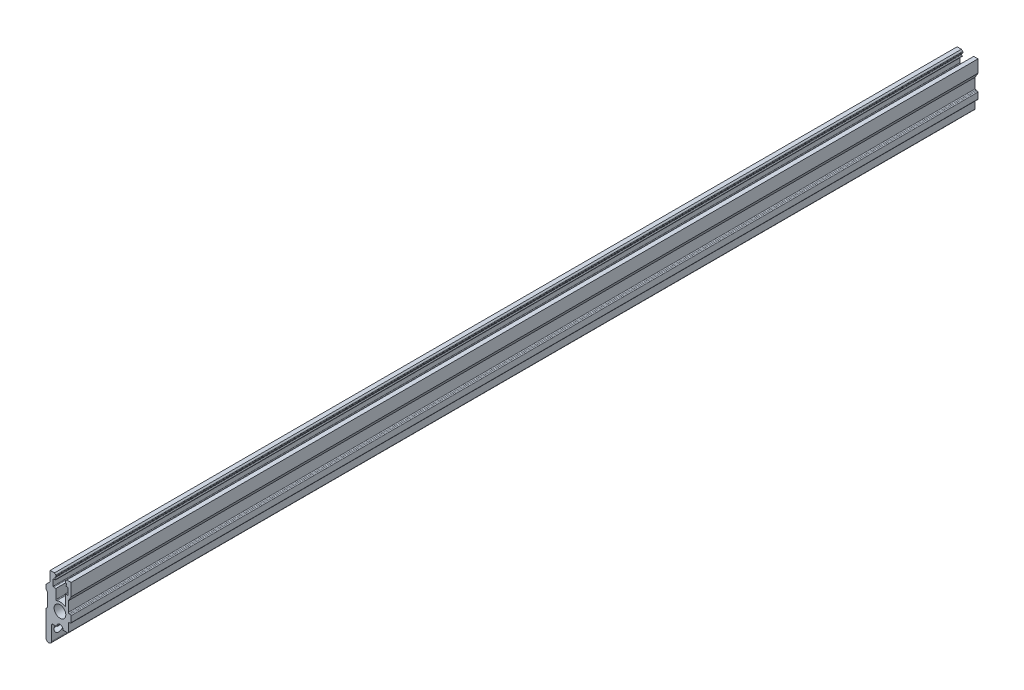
ISO-10303-21;
HEADER;
FILE_DESCRIPTION(('STEP AP214'),'2;1');
FILE_NAME('part.step','',(''),(''),'','','');
FILE_SCHEMA(('AUTOMOTIVE_DESIGN { 1 0 10303 214 1 1 1 1 }'));
ENDSEC;
DATA;
#1=APPLICATION_CONTEXT('core data for automotive mechanical design processes');
#2=APPLICATION_PROTOCOL_DEFINITION('international standard','automotive_design',2000,#1);
#3=PRODUCT_CONTEXT('',#1,'mechanical');
#4=PRODUCT('Part','Part','',(#3));
#5=PRODUCT_RELATED_PRODUCT_CATEGORY('part','',(#4));
#6=PRODUCT_DEFINITION_FORMATION('','',#4);
#7=PRODUCT_DEFINITION_CONTEXT('part definition',#1,'design');
#8=PRODUCT_DEFINITION('design','',#6,#7);
#9=PRODUCT_DEFINITION_SHAPE('','',#8);
#10=(LENGTH_UNIT() NAMED_UNIT(*) SI_UNIT(.MILLI.,.METRE.));
#11=(NAMED_UNIT(*) PLANE_ANGLE_UNIT() SI_UNIT($,.RADIAN.));
#12=(NAMED_UNIT(*) SI_UNIT($,.STERADIAN.) SOLID_ANGLE_UNIT());
#13=UNCERTAINTY_MEASURE_WITH_UNIT(LENGTH_MEASURE(1.E-05),#10,'distance_accuracy_value','');
#14=(GEOMETRIC_REPRESENTATION_CONTEXT(3) GLOBAL_UNCERTAINTY_ASSIGNED_CONTEXT((#13)) GLOBAL_UNIT_ASSIGNED_CONTEXT((#10,
#11,#12)) REPRESENTATION_CONTEXT('',''));
#15=CARTESIAN_POINT('',(0.,0.,0.));
#16=DIRECTION('',(0.,0.,1.));
#17=DIRECTION('',(1.,0.,0.));
#18=AXIS2_PLACEMENT_3D('',#15,#16,#17);
#19=CARTESIAN_POINT('',(0.,0.,162.56));
#20=DIRECTION('',(0.,0.,-1.));
#21=DIRECTION('',(-1.,0.,0.));
#22=AXIS2_PLACEMENT_3D('',#19,#20,#21);
#23=CYLINDRICAL_SURFACE('',#22,1.60000000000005);
#24=CARTESIAN_POINT('',(0.,0.,-152.56));
#25=DIRECTION('',(0.,0.,-1.));
#26=DIRECTION('',(-1.,0.,0.));
#27=AXIS2_PLACEMENT_3D('',#24,#25,#26);
#28=CIRCLE('',#27,1.60000000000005);
#29=CARTESIAN_POINT('',(-1.60000000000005,0.,-152.56));
#30=VERTEX_POINT('',#29);
#31=EDGE_CURVE('E759',#30,#30,#28,.T.);
#32=ORIENTED_EDGE('',*,*,#31,.T.);
#33=EDGE_LOOP('',(#32));
#34=FACE_BOUND('',#33,.T.);
#35=CARTESIAN_POINT('',(0.,0.,152.56));
#36=DIRECTION('',(0.,0.,1.));
#37=DIRECTION('',(1.,0.,0.));
#38=AXIS2_PLACEMENT_3D('',#35,#36,#37);
#39=CIRCLE('',#38,1.60000000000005);
#40=CARTESIAN_POINT('',(1.60000000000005,0.,152.56));
#41=VERTEX_POINT('',#40);
#42=EDGE_CURVE('E752',#41,#41,#39,.T.);
#43=ORIENTED_EDGE('',*,*,#42,.T.);
#44=EDGE_LOOP('',(#43));
#45=FACE_BOUND('',#44,.T.);
#46=ADVANCED_FACE('F37',(#34,#45),#23,.F.);
#47=CARTESIAN_POINT('',(-2.50086526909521,-5.7499999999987,162.56));
#48=DIRECTION('',(0.,0.,-1.));
#49=DIRECTION('',(-1.,0.,0.));
#50=AXIS2_PLACEMENT_3D('',#47,#48,#49);
#51=PLANE('',#50);
#52=CARTESIAN_POINT('',(0.,0.,162.56));
#53=DIRECTION('',(0.,0.,1.));
#54=DIRECTION('',(1.,0.,0.));
#55=AXIS2_PLACEMENT_3D('',#52,#53,#54);
#56=CIRCLE('',#55,2.1);
#57=CARTESIAN_POINT('',(2.1,0.,162.56));
#58=VERTEX_POINT('',#57);
#59=EDGE_CURVE('E753',#58,#58,#56,.T.);
#60=ORIENTED_EDGE('',*,*,#59,.F.);
#61=EDGE_LOOP('',(#60));
#62=FACE_BOUND('',#61,.T.);
#63=DIRECTION('',(0.,-1.,0.));
#64=VECTOR('',#63,1.);
#65=CARTESIAN_POINT('',(-3.50086526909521,11.0015907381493,162.56));
#66=LINE('',#65,#64);
#67=CARTESIAN_POINT('',(-3.50086526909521,11.0015907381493,162.56));
#68=VERTEX_POINT('',#67);
#69=CARTESIAN_POINT('',(-3.50086526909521,7.44159073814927,162.56));
#70=VERTEX_POINT('',#69);
#71=EDGE_CURVE('E52',#68,#70,#66,.T.);
#72=ORIENTED_EDGE('',*,*,#71,.T.);
#73=DIRECTION('',(-0.707106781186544,-0.707106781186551,0.));
#74=VECTOR('',#73,1.);
#75=CARTESIAN_POINT('',(-3.50086526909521,7.44159073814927,162.56));
#76=LINE('',#75,#74);
#77=CARTESIAN_POINT('',(-5.00086526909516,5.94159073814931,162.56));
#78=VERTEX_POINT('',#77);
#79=EDGE_CURVE('E435',#70,#78,#76,.T.);
#80=ORIENTED_EDGE('',*,*,#79,.T.);
#81=DIRECTION('',(0.,-1.,0.));
#82=VECTOR('',#81,1.);
#83=CARTESIAN_POINT('',(-5.00086526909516,8.5215907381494,162.56));
#84=LINE('',#83,#82);
#85=CARTESIAN_POINT('',(-5.00086526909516,4.44159073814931,162.56));
#86=VERTEX_POINT('',#85);
#87=EDGE_CURVE('E854',#78,#86,#84,.T.);
#88=ORIENTED_EDGE('',*,*,#87,.T.);
#89=DIRECTION('',(0.668928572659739,-0.743326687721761,0.));
#90=VECTOR('',#89,1.);
#91=CARTESIAN_POINT('',(-5.00086526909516,4.44159073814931,162.56));
#92=LINE('',#91,#90);
#93=CARTESIAN_POINT('',(-4.55073320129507,3.94139506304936,162.56));
#94=VERTEX_POINT('',#93);
#95=EDGE_CURVE('E856',#86,#94,#92,.T.);
#96=ORIENTED_EDGE('',*,*,#95,.T.);
#97=DIRECTION('',(-5.28322799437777E-05,-0.999999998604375,0.));
#98=VECTOR('',#97,1.);
#99=CARTESIAN_POINT('',(-4.55073320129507,3.94139506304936,162.56));
#100=LINE('',#99,#98);
#101=CARTESIAN_POINT('',(-4.55099736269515,-1.05860493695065,162.56));
#102=VERTEX_POINT('',#101);
#103=EDGE_CURVE('E858',#94,#102,#100,.T.);
#104=ORIENTED_EDGE('',*,*,#103,.T.);
#105=DIRECTION('',(-0.669000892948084,-0.743261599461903,0.));
#106=VECTOR('',#105,1.);
#107=CARTESIAN_POINT('',(-4.55099736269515,-1.05860493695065,162.56));
#108=LINE('',#107,#106);
#109=CARTESIAN_POINT('',(-5.00086526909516,-1.55840926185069,162.56));
#110=VERTEX_POINT('',#109);
#111=EDGE_CURVE('E860',#102,#110,#108,.T.);
#112=ORIENTED_EDGE('',*,*,#111,.T.);
#113=DIRECTION('',(0.,-1.,0.));
#114=VECTOR('',#113,1.);
#115=CARTESIAN_POINT('',(-5.00086526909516,-1.55840926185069,162.56));
#116=LINE('',#115,#114);
#117=CARTESIAN_POINT('',(-5.00086526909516,-10.75,162.56));
#118=VERTEX_POINT('',#117);
#119=EDGE_CURVE('E862',#110,#118,#116,.T.);
#120=ORIENTED_EDGE('',*,*,#119,.T.);
#121=CARTESIAN_POINT('',(-4.00086526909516,-10.75,162.56));
#122=DIRECTION('',(0.,0.,1.));
#123=DIRECTION('',(1.,0.,0.));
#124=AXIS2_PLACEMENT_3D('',#121,#122,#123);
#125=CIRCLE('',#124,1.);
#126=CARTESIAN_POINT('',(-3.00086526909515,-10.75,162.56));
#127=VERTEX_POINT('',#126);
#128=EDGE_CURVE('E864',#118,#127,#125,.T.);
#129=ORIENTED_EDGE('',*,*,#128,.T.);
#130=DIRECTION('',(0.,1.,0.));
#131=VECTOR('',#130,1.);
#132=CARTESIAN_POINT('',(-3.00086526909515,-10.75,162.56));
#133=LINE('',#132,#131);
#134=CARTESIAN_POINT('',(-3.00086526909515,-5.74999999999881,162.56));
#135=VERTEX_POINT('',#134);
#136=EDGE_CURVE('E866',#127,#135,#133,.T.);
#137=ORIENTED_EDGE('',*,*,#136,.T.);
#138=CARTESIAN_POINT('',(-2.50086526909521,-5.7499999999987,162.56));
#139=DIRECTION('',(0.,0.,-1.));
#140=DIRECTION('',(-1.,0.,0.));
#141=AXIS2_PLACEMENT_3D('',#138,#139,#140);
#142=CIRCLE('',#141,0.499999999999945);
#143=CARTESIAN_POINT('',(-2.50086526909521,-5.24999999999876,162.56));
#144=VERTEX_POINT('',#143);
#145=EDGE_CURVE('E785',#135,#144,#142,.T.);
#146=ORIENTED_EDGE('',*,*,#145,.T.);
#147=DIRECTION('',(1.,0.,0.));
#148=VECTOR('',#147,1.);
#149=CARTESIAN_POINT('',(-2.50086526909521,-5.24999999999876,162.56));
#150=LINE('',#149,#148);
#151=CARTESIAN_POINT('',(-1.15,-5.24999999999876,162.56));
#152=VERTEX_POINT('',#151);
#153=EDGE_CURVE('E788',#144,#152,#150,.T.);
#154=ORIENTED_EDGE('',*,*,#153,.T.);
#155=CARTESIAN_POINT('',(-1.15,-5.14999999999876,162.56));
#156=DIRECTION('',(0.,0.,1.));
#157=DIRECTION('',(-1.,0.,0.));
#158=AXIS2_PLACEMENT_3D('',#155,#156,#157);
#159=CIRCLE('',#158,0.1);
#160=CARTESIAN_POINT('',(-1.05,-5.14999999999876,162.56));
#161=VERTEX_POINT('',#160);
#162=EDGE_CURVE('E791',#152,#161,#159,.T.);
#163=ORIENTED_EDGE('',*,*,#162,.T.);
#164=DIRECTION('',(0.,1.,0.));
#165=VECTOR('',#164,1.);
#166=CARTESIAN_POINT('',(-1.05,-5.,162.56));
#167=LINE('',#166,#165);
#168=CARTESIAN_POINT('',(-1.05,-5.,162.56));
#169=VERTEX_POINT('',#168);
#170=EDGE_CURVE('E793',#161,#169,#167,.T.);
#171=ORIENTED_EDGE('',*,*,#170,.T.);
#172=CARTESIAN_POINT('',(0.,-5.,162.56));
#173=DIRECTION('',(0.,0.,-1.));
#174=DIRECTION('',(1.,0.,0.));
#175=AXIS2_PLACEMENT_3D('',#172,#173,#174);
#176=CIRCLE('',#175,1.05);
#177=CARTESIAN_POINT('',(1.05,-5.,162.56));
#178=VERTEX_POINT('',#177);
#179=EDGE_CURVE('E795',#169,#178,#176,.T.);
#180=ORIENTED_EDGE('',*,*,#179,.T.);
#181=DIRECTION('',(0.,-1.,0.));
#182=VECTOR('',#181,1.);
#183=CARTESIAN_POINT('',(1.05,-5.,162.56));
#184=LINE('',#183,#182);
#185=CARTESIAN_POINT('',(1.05,-5.14999999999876,162.56));
#186=VERTEX_POINT('',#185);
#187=EDGE_CURVE('E797',#178,#186,#184,.T.);
#188=ORIENTED_EDGE('',*,*,#187,.T.);
#189=CARTESIAN_POINT('',(1.15,-5.14999999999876,162.56));
#190=DIRECTION('',(0.,0.,1.));
#191=DIRECTION('',(-1.,0.,0.));
#192=AXIS2_PLACEMENT_3D('',#189,#190,#191);
#193=CIRCLE('',#192,0.1);
#194=CARTESIAN_POINT('',(1.15,-5.24999999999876,162.56));
#195=VERTEX_POINT('',#194);
#196=EDGE_CURVE('E799',#186,#195,#193,.T.);
#197=ORIENTED_EDGE('',*,*,#196,.T.);
#198=DIRECTION('',(1.,0.,0.));
#199=VECTOR('',#198,1.);
#200=CARTESIAN_POINT('',(1.15,-5.24999999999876,162.56));
#201=LINE('',#200,#199);
#202=CARTESIAN_POINT('',(2.79913473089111,-5.24999999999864,162.56));
#203=VERTEX_POINT('',#202);
#204=EDGE_CURVE('E801',#195,#203,#201,.T.);
#205=ORIENTED_EDGE('',*,*,#204,.T.);
#206=CARTESIAN_POINT('',(2.79913473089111,-5.04999999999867,162.56));
#207=DIRECTION('',(0.,0.,1.));
#208=DIRECTION('',(1.,0.,0.));
#209=AXIS2_PLACEMENT_3D('',#206,#207,#208);
#210=CIRCLE('',#209,0.199999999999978);
#211=CARTESIAN_POINT('',(2.99913473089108,-5.04999999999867,162.56));
#212=VERTEX_POINT('',#211);
#213=EDGE_CURVE('E803',#203,#212,#210,.T.);
#214=ORIENTED_EDGE('',*,*,#213,.T.);
#215=DIRECTION('',(0.,1.,0.));
#216=VECTOR('',#215,1.);
#217=CARTESIAN_POINT('',(2.99913473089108,-5.04999999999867,162.56));
#218=LINE('',#217,#216);
#219=CARTESIAN_POINT('',(2.99913473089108,-2.05840926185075,162.56));
#220=VERTEX_POINT('',#219);
#221=EDGE_CURVE('E805',#212,#220,#218,.T.);
#222=ORIENTED_EDGE('',*,*,#221,.T.);
#223=CARTESIAN_POINT('',(3.29913473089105,-2.05840926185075,162.56));
#224=DIRECTION('',(0.,0.,-1.));
#225=DIRECTION('',(1.,0.,0.));
#226=AXIS2_PLACEMENT_3D('',#223,#224,#225);
#227=CIRCLE('',#226,0.299999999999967);
#228=CARTESIAN_POINT('',(3.29913473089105,-1.75840926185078,162.56));
#229=VERTEX_POINT('',#228);
#230=EDGE_CURVE('E808',#220,#229,#227,.T.);
#231=ORIENTED_EDGE('',*,*,#230,.T.);
#232=DIRECTION('',(1.,0.,0.));
#233=VECTOR('',#232,1.);
#234=CARTESIAN_POINT('',(3.29913473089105,-1.75840926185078,162.56));
#235=LINE('',#234,#233);
#236=CARTESIAN_POINT('',(3.69913473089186,-1.75840926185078,162.56));
#237=VERTEX_POINT('',#236);
#238=EDGE_CURVE('E810',#229,#237,#235,.T.);
#239=ORIENTED_EDGE('',*,*,#238,.T.);
#240=CARTESIAN_POINT('',(3.69913473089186,-1.45840926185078,162.56));
#241=DIRECTION('',(0.,0.,1.));
#242=DIRECTION('',(-1.,0.,0.));
#243=AXIS2_PLACEMENT_3D('',#240,#241,#242);
#244=CIRCLE('',#243,0.3);
#245=CARTESIAN_POINT('',(3.99913473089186,-1.45840926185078,162.56));
#246=VERTEX_POINT('',#245);
#247=EDGE_CURVE('E812',#237,#246,#244,.T.);
#248=ORIENTED_EDGE('',*,*,#247,.T.);
#249=DIRECTION('',(0.,1.,0.));
#250=VECTOR('',#249,1.);
#251=CARTESIAN_POINT('',(3.99913473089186,0.641590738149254,162.56));
#252=LINE('',#251,#250);
#253=CARTESIAN_POINT('',(3.99913473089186,0.641590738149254,162.56));
#254=VERTEX_POINT('',#253);
#255=EDGE_CURVE('E814',#246,#254,#252,.T.);
#256=ORIENTED_EDGE('',*,*,#255,.T.);
#257=CARTESIAN_POINT('',(3.69913473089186,0.641590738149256,162.56));
#258=DIRECTION('',(0.,0.,1.));
#259=DIRECTION('',(-1.,0.,0.));
#260=AXIS2_PLACEMENT_3D('',#257,#258,#259);
#261=CIRCLE('',#260,0.3);
#262=CARTESIAN_POINT('',(3.69913473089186,0.941590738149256,162.56));
#263=VERTEX_POINT('',#262);
#264=EDGE_CURVE('E816',#254,#263,#261,.T.);
#265=ORIENTED_EDGE('',*,*,#264,.T.);
#266=DIRECTION('',(-1.,0.,0.));
#267=VECTOR('',#266,1.);
#268=CARTESIAN_POINT('',(3.69913473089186,0.941590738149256,162.56));
#269=LINE('',#268,#267);
#270=CARTESIAN_POINT('',(3.29913473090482,0.941590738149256,162.56));
#271=VERTEX_POINT('',#270);
#272=EDGE_CURVE('E818',#263,#271,#269,.T.);
#273=ORIENTED_EDGE('',*,*,#272,.T.);
#274=CARTESIAN_POINT('',(3.29913473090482,1.24159073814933,162.56));
#275=DIRECTION('',(0.,0.,-1.));
#276=DIRECTION('',(1.,0.,0.));
#277=AXIS2_PLACEMENT_3D('',#274,#275,#276);
#278=CIRCLE('',#277,0.300000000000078);
#279=CARTESIAN_POINT('',(2.99913473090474,1.24159073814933,162.56));
#280=VERTEX_POINT('',#279);
#281=EDGE_CURVE('E821',#271,#280,#278,.T.);
#282=ORIENTED_EDGE('',*,*,#281,.T.);
#283=DIRECTION('',(0.,1.,0.));
#284=VECTOR('',#283,1.);
#285=CARTESIAN_POINT('',(2.99913473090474,1.24159073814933,162.56));
#286=LINE('',#285,#284);
#287=CARTESIAN_POINT('',(2.99913473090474,4.80537295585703,162.56));
#288=VERTEX_POINT('',#287);
#289=EDGE_CURVE('E823',#280,#288,#286,.T.);
#290=ORIENTED_EDGE('',*,*,#289,.T.);
#291=DIRECTION('',(0.5,0.866025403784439,0.));
#292=VECTOR('',#291,1.);
#293=CARTESIAN_POINT('',(2.99913473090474,4.80537295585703,162.56));
#294=LINE('',#293,#292);
#295=CARTESIAN_POINT('',(3.9991347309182,6.53742376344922,162.56));
#296=VERTEX_POINT('',#295);
#297=EDGE_CURVE('E826',#288,#296,#294,.T.);
#298=ORIENTED_EDGE('',*,*,#297,.T.);
#299=DIRECTION('',(0.,1.,0.));
#300=VECTOR('',#299,1.);
#301=CARTESIAN_POINT('',(3.9991347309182,6.53742376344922,162.56));
#302=LINE('',#301,#300);
#303=CARTESIAN_POINT('',(3.9991347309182,11.0015907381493,162.56));
#304=VERTEX_POINT('',#303);
#305=EDGE_CURVE('E828',#296,#304,#302,.T.);
#306=ORIENTED_EDGE('',*,*,#305,.T.);
#307=DIRECTION('',(-1.,0.,0.));
#308=VECTOR('',#307,1.);
#309=CARTESIAN_POINT('',(3.9991347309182,11.0015907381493,162.56));
#310=LINE('',#309,#308);
#311=CARTESIAN_POINT('',(2.44913473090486,11.0015907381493,162.56));
#312=VERTEX_POINT('',#311);
#313=EDGE_CURVE('E452',#304,#312,#310,.T.);
#314=ORIENTED_EDGE('',*,*,#313,.T.);
#315=DIRECTION('',(0.707106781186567,0.707106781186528,0.));
#316=VECTOR('',#315,1.);
#317=CARTESIAN_POINT('',(1.94913473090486,10.5015907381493,162.56));
#318=LINE('',#317,#316);
#319=CARTESIAN_POINT('',(2.00771337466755,10.560169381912,162.56));
#320=VERTEX_POINT('',#319);
#321=EDGE_CURVE('E1261',#312,#320,#318,.F.);
#322=ORIENTED_EDGE('',*,*,#321,.T.);
#323=CARTESIAN_POINT('',(2.14913473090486,10.4187480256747,162.56));
#324=DIRECTION('',(0.,0.,-1.));
#325=DIRECTION('',(-1.,0.,0.));
#326=AXIS2_PLACEMENT_3D('',#323,#324,#325);
#327=CIRCLE('',#326,0.2);
#328=CARTESIAN_POINT('',(1.94913473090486,10.4187480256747,162.56));
#329=VERTEX_POINT('',#328);
#330=EDGE_CURVE('E1297',#320,#329,#327,.F.);
#331=ORIENTED_EDGE('',*,*,#330,.T.);
#332=DIRECTION('',(0.,-1.,0.));
#333=VECTOR('',#332,1.);
#334=CARTESIAN_POINT('',(1.94913473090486,11.7915907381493,162.56));
#335=LINE('',#334,#333);
#336=CARTESIAN_POINT('',(1.94913473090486,10.1341483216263,162.56));
#337=VERTEX_POINT('',#336);
#338=EDGE_CURVE('E831',#329,#337,#335,.T.);
#339=ORIENTED_EDGE('',*,*,#338,.T.);
#340=CARTESIAN_POINT('',(2.14913473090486,10.1341483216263,162.56));
#341=DIRECTION('',(0.,0.,-1.));
#342=DIRECTION('',(-1.,0.,0.));
#343=AXIS2_PLACEMENT_3D('',#340,#341,#342);
#344=CIRCLE('',#343,0.2);
#345=CARTESIAN_POINT('',(2.06342044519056,9.95344674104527,162.56));
#346=VERTEX_POINT('',#345);
#347=EDGE_CURVE('E1291',#337,#346,#344,.F.);
#348=ORIENTED_EDGE('',*,*,#347,.T.);
#349=CARTESIAN_POINT('',(1.84913473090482,9.50169278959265,162.56));
#350=DIRECTION('',(0.,0.,-1.));
#351=DIRECTION('',(-1.,0.,0.));
#352=AXIS2_PLACEMENT_3D('',#349,#350,#351);
#353=CIRCLE('',#352,0.5);
#354=CARTESIAN_POINT('',(2.34913473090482,9.50169278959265,162.56));
#355=VERTEX_POINT('',#354);
#356=EDGE_CURVE('E1255',#346,#355,#353,.T.);
#357=ORIENTED_EDGE('',*,*,#356,.T.);
#358=DIRECTION('',(0.,-1.,0.));
#359=VECTOR('',#358,1.);
#360=CARTESIAN_POINT('',(2.34913473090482,8.99159073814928,162.56));
#361=LINE('',#360,#359);
#362=CARTESIAN_POINT('',(2.34913473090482,9.48148868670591,162.56));
#363=VERTEX_POINT('',#362);
#364=EDGE_CURVE('E464',#355,#363,#361,.T.);
#365=ORIENTED_EDGE('',*,*,#364,.T.);
#366=CARTESIAN_POINT('',(1.84913473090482,9.48148868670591,162.56));
#367=DIRECTION('',(0.,0.,-1.));
#368=DIRECTION('',(-1.,0.,0.));
#369=AXIS2_PLACEMENT_3D('',#366,#367,#368);
#370=CIRCLE('',#369,0.5);
#371=CARTESIAN_POINT('',(2.16004280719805,9.08990706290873,162.56));
#372=VERTEX_POINT('',#371);
#373=EDGE_CURVE('E1259',#363,#372,#370,.T.);
#374=ORIENTED_EDGE('',*,*,#373,.T.);
#375=CARTESIAN_POINT('',(2.2222244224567,9.01159073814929,162.56));
#376=DIRECTION('',(0.,0.,-1.));
#377=DIRECTION('',(-1.,0.,0.));
#378=AXIS2_PLACEMENT_3D('',#375,#376,#377);
#379=CIRCLE('',#378,0.1);
#380=CARTESIAN_POINT('',(2.2222244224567,8.91159073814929,162.56));
#381=VERTEX_POINT('',#380);
#382=EDGE_CURVE('E60',#372,#381,#379,.F.);
#383=ORIENTED_EDGE('',*,*,#382,.T.);
#384=DIRECTION('',(1.,0.,0.));
#385=VECTOR('',#384,1.);
#386=CARTESIAN_POINT('',(1.94913473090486,8.91159073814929,162.56));
#387=LINE('',#386,#385);
#388=CARTESIAN_POINT('',(2.74913473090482,8.91159073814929,162.56));
#389=VERTEX_POINT('',#388);
#390=EDGE_CURVE('E834',#381,#389,#387,.T.);
#391=ORIENTED_EDGE('',*,*,#390,.T.);
#392=CARTESIAN_POINT('',(2.74913473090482,8.71159073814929,162.56));
#393=DIRECTION('',(0.,0.,-1.));
#394=DIRECTION('',(-1.,0.,0.));
#395=AXIS2_PLACEMENT_3D('',#392,#393,#394);
#396=CIRCLE('',#395,0.2);
#397=CARTESIAN_POINT('',(2.94913473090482,8.71159073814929,162.56));
#398=VERTEX_POINT('',#397);
#399=EDGE_CURVE('E1076',#389,#398,#396,.T.);
#400=ORIENTED_EDGE('',*,*,#399,.T.);
#401=DIRECTION('',(0.,-1.,0.));
#402=VECTOR('',#401,1.);
#403=CARTESIAN_POINT('',(2.94913473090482,8.91159073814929,162.56));
#404=LINE('',#403,#402);
#405=CARTESIAN_POINT('',(2.94913473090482,6.61159073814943,162.56));
#406=VERTEX_POINT('',#405);
#407=EDGE_CURVE('E766',#398,#406,#404,.T.);
#408=ORIENTED_EDGE('',*,*,#407,.T.);
#409=CARTESIAN_POINT('',(2.74913473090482,6.61159073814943,162.56));
#410=DIRECTION('',(0.,0.,-1.));
#411=DIRECTION('',(-1.,0.,0.));
#412=AXIS2_PLACEMENT_3D('',#409,#410,#411);
#413=CIRCLE('',#412,0.2);
#414=CARTESIAN_POINT('',(2.74913473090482,6.41159073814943,162.56));
#415=VERTEX_POINT('',#414);
#416=EDGE_CURVE('E1080',#406,#415,#413,.T.);
#417=ORIENTED_EDGE('',*,*,#416,.T.);
#418=DIRECTION('',(-1.,0.,0.));
#419=VECTOR('',#418,1.);
#420=CARTESIAN_POINT('',(-2.45086526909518,6.41159073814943,162.56));
#421=LINE('',#420,#419);
#422=CARTESIAN_POINT('',(1.94913473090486,6.41159073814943,162.56));
#423=VERTEX_POINT('',#422);
#424=EDGE_CURVE('E771',#415,#423,#421,.T.);
#425=ORIENTED_EDGE('',*,*,#424,.T.);
#426=DIRECTION('',(0.,-1.,0.));
#427=VECTOR('',#426,1.);
#428=CARTESIAN_POINT('',(1.94913473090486,6.61159073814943,162.56));
#429=LINE('',#428,#427);
#430=CARTESIAN_POINT('',(1.94913473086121,2.67965066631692,162.56));
#431=VERTEX_POINT('',#430);
#432=EDGE_CURVE('E836',#423,#431,#429,.T.);
#433=ORIENTED_EDGE('',*,*,#432,.T.);
#434=CARTESIAN_POINT('',(1.74913473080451,2.67965066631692,162.56));
#435=DIRECTION('',(0.,0.,-1.));
#436=DIRECTION('',(1.,0.,0.));
#437=AXIS2_PLACEMENT_3D('',#434,#435,#436);
#438=CIRCLE('',#437,0.200000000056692);
#439=CARTESIAN_POINT('',(1.63981381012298,2.51217249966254,162.56));
#440=VERTEX_POINT('',#439);
#441=EDGE_CURVE('E839',#431,#440,#438,.T.);
#442=ORIENTED_EDGE('',*,*,#441,.T.);
#443=CARTESIAN_POINT('',(0.,0.,162.56));
#444=DIRECTION('',(0.,0.,1.));
#445=DIRECTION('',(1.,0.,0.));
#446=AXIS2_PLACEMENT_3D('',#443,#444,#445);
#447=CIRCLE('',#446,2.99999999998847);
#448=CARTESIAN_POINT('',(-1.17268618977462,2.76130532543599,162.56));
#449=VERTEX_POINT('',#448);
#450=EDGE_CURVE('E841',#440,#449,#447,.T.);
#451=ORIENTED_EDGE('',*,*,#450,.T.);
#452=CARTESIAN_POINT('',(-1.25086526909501,2.94539234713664,162.56));
#453=DIRECTION('',(0.,0.,-1.));
#454=DIRECTION('',(1.,0.,0.));
#455=AXIS2_PLACEMENT_3D('',#452,#453,#454);
#456=CIRCLE('',#455,0.200000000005);
#457=CARTESIAN_POINT('',(-1.45086526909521,2.94539234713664,162.56));
#458=VERTEX_POINT('',#457);
#459=EDGE_CURVE('E843',#449,#458,#456,.T.);
#460=ORIENTED_EDGE('',*,*,#459,.T.);
#461=DIRECTION('',(0.,1.,0.));
#462=VECTOR('',#461,1.);
#463=CARTESIAN_POINT('',(-1.45086526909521,2.94539234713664,162.56));
#464=LINE('',#463,#462);
#465=CARTESIAN_POINT('',(-1.45086526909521,6.41159073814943,162.56));
#466=VERTEX_POINT('',#465);
#467=EDGE_CURVE('E845',#458,#466,#464,.T.);
#468=ORIENTED_EDGE('',*,*,#467,.T.);
#469=CARTESIAN_POINT('',(-2.25086526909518,6.41159073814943,162.56));
#470=VERTEX_POINT('',#469);
#471=EDGE_CURVE('E770',#466,#470,#421,.T.);
#472=ORIENTED_EDGE('',*,*,#471,.T.);
#473=CARTESIAN_POINT('',(-2.25086526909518,6.61159073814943,162.56));
#474=DIRECTION('',(0.,0.,-1.));
#475=DIRECTION('',(-1.,0.,0.));
#476=AXIS2_PLACEMENT_3D('',#473,#474,#475);
#477=CIRCLE('',#476,0.2);
#478=CARTESIAN_POINT('',(-2.45086526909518,6.61159073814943,162.56));
#479=VERTEX_POINT('',#478);
#480=EDGE_CURVE('E1071',#470,#479,#477,.T.);
#481=ORIENTED_EDGE('',*,*,#480,.T.);
#482=DIRECTION('',(0.,1.,0.));
#483=VECTOR('',#482,1.);
#484=CARTESIAN_POINT('',(-2.45086526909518,8.91159073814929,162.56));
#485=LINE('',#484,#483);
#486=CARTESIAN_POINT('',(-2.45086526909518,8.71159073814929,162.56));
#487=VERTEX_POINT('',#486);
#488=EDGE_CURVE('E763',#479,#487,#485,.T.);
#489=ORIENTED_EDGE('',*,*,#488,.T.);
#490=CARTESIAN_POINT('',(-2.25086526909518,8.71159073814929,162.56));
#491=DIRECTION('',(0.,0.,-1.));
#492=DIRECTION('',(-1.,0.,0.));
#493=AXIS2_PLACEMENT_3D('',#490,#491,#492);
#494=CIRCLE('',#493,0.2);
#495=CARTESIAN_POINT('',(-2.25086526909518,8.91159073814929,162.56));
#496=VERTEX_POINT('',#495);
#497=EDGE_CURVE('E1067',#487,#496,#494,.T.);
#498=ORIENTED_EDGE('',*,*,#497,.T.);
#499=DIRECTION('',(1.,0.,0.));
#500=VECTOR('',#499,1.);
#501=CARTESIAN_POINT('',(-2.35086526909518,8.91159073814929,162.56));
#502=LINE('',#501,#500);
#503=CARTESIAN_POINT('',(-1.72395496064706,8.91159073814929,162.56));
#504=VERTEX_POINT('',#503);
#505=EDGE_CURVE('E848',#496,#504,#502,.T.);
#506=ORIENTED_EDGE('',*,*,#505,.T.);
#507=CARTESIAN_POINT('',(-1.72395496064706,9.01159073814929,162.56));
#508=DIRECTION('',(0.,0.,-1.));
#509=DIRECTION('',(-1.,0.,0.));
#510=AXIS2_PLACEMENT_3D('',#507,#508,#509);
#511=CIRCLE('',#510,0.1);
#512=CARTESIAN_POINT('',(-1.66177334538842,9.08990706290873,162.56));
#513=VERTEX_POINT('',#512);
#514=EDGE_CURVE('E1321',#504,#513,#511,.F.);
#515=ORIENTED_EDGE('',*,*,#514,.T.);
#516=CARTESIAN_POINT('',(-1.35086526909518,9.48148868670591,162.56));
#517=DIRECTION('',(0.,0.,-1.));
#518=DIRECTION('',(-1.,0.,0.));
#519=AXIS2_PLACEMENT_3D('',#516,#517,#518);
#520=CIRCLE('',#519,0.5);
#521=CARTESIAN_POINT('',(-1.85086526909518,9.48148868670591,162.56));
#522=VERTEX_POINT('',#521);
#523=EDGE_CURVE('E1250',#513,#522,#520,.T.);
#524=ORIENTED_EDGE('',*,*,#523,.T.);
#525=DIRECTION('',(0.,1.,0.));
#526=VECTOR('',#525,1.);
#527=CARTESIAN_POINT('',(-1.85086526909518,8.99159073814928,162.56));
#528=LINE('',#527,#526);
#529=CARTESIAN_POINT('',(-1.85086526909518,9.50169278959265,162.56));
#530=VERTEX_POINT('',#529);
#531=EDGE_CURVE('E461',#522,#530,#528,.T.);
#532=ORIENTED_EDGE('',*,*,#531,.T.);
#533=CARTESIAN_POINT('',(-1.35086526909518,9.50169278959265,162.56));
#534=DIRECTION('',(0.,0.,-1.));
#535=DIRECTION('',(-1.,0.,0.));
#536=AXIS2_PLACEMENT_3D('',#533,#534,#535);
#537=CIRCLE('',#536,0.5);
#538=CARTESIAN_POINT('',(-1.56515098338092,9.95344674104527,162.56));
#539=VERTEX_POINT('',#538);
#540=EDGE_CURVE('E1244',#530,#539,#537,.T.);
#541=ORIENTED_EDGE('',*,*,#540,.T.);
#542=CARTESIAN_POINT('',(-1.65086526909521,10.1341483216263,162.56));
#543=DIRECTION('',(0.,0.,-1.));
#544=DIRECTION('',(-1.,0.,0.));
#545=AXIS2_PLACEMENT_3D('',#542,#543,#544);
#546=CIRCLE('',#545,0.2);
#547=CARTESIAN_POINT('',(-1.45086526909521,10.1341483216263,162.56));
#548=VERTEX_POINT('',#547);
#549=EDGE_CURVE('E1293',#539,#548,#546,.F.);
#550=ORIENTED_EDGE('',*,*,#549,.T.);
#551=DIRECTION('',(0.,1.,0.));
#552=VECTOR('',#551,1.);
#553=CARTESIAN_POINT('',(-1.45086526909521,8.91159073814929,162.56));
#554=LINE('',#553,#552);
#555=CARTESIAN_POINT('',(-1.45086526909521,10.4187480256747,162.56));
#556=VERTEX_POINT('',#555);
#557=EDGE_CURVE('E851',#548,#556,#554,.T.);
#558=ORIENTED_EDGE('',*,*,#557,.T.);
#559=CARTESIAN_POINT('',(-1.65086526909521,10.4187480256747,162.56));
#560=DIRECTION('',(0.,0.,-1.));
#561=DIRECTION('',(-1.,0.,0.));
#562=AXIS2_PLACEMENT_3D('',#559,#560,#561);
#563=CIRCLE('',#562,0.2);
#564=CARTESIAN_POINT('',(-1.50944391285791,10.560169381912,162.56));
#565=VERTEX_POINT('',#564);
#566=EDGE_CURVE('E1295',#556,#565,#563,.F.);
#567=ORIENTED_EDGE('',*,*,#566,.T.);
#568=DIRECTION('',(0.707106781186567,-0.707106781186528,0.));
#569=VECTOR('',#568,1.);
#570=CARTESIAN_POINT('',(-1.45086526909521,10.5015907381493,162.56));
#571=LINE('',#570,#569);
#572=CARTESIAN_POINT('',(-1.95086526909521,11.0015907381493,162.56));
#573=VERTEX_POINT('',#572);
#574=EDGE_CURVE('E1264',#565,#573,#571,.F.);
#575=ORIENTED_EDGE('',*,*,#574,.T.);
#576=EDGE_CURVE('E443',#573,#68,#310,.T.);
#577=ORIENTED_EDGE('',*,*,#576,.T.);
#578=EDGE_LOOP('',(#72,#80,#88,#96,#104,#112,#120,#129,#137,#146,#154,#163,#171,#180,#188,#197,
#205,#214,#222,#231,#239,#248,#256,#265,#273,#282,#290,#298,#306,#314,#322,#331,#339,#348,#357,
#365,#374,#383,#391,#400,#408,#417,#425,#433,#442,#451,#460,#468,#472,#481,#489,#498,#506,#515,
#524,#532,#541,#550,#558,#567,#575,#577));
#579=FACE_BOUND('',#578,.T.);
#580=ADVANCED_FACE('F441',(#62,#579),#51,.F.);
#581=CARTESIAN_POINT('',(-2.50086526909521,-5.7499999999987,-162.56));
#582=DIRECTION('',(0.,0.,-1.));
#583=DIRECTION('',(-1.,0.,0.));
#584=AXIS2_PLACEMENT_3D('',#581,#582,#583);
#585=PLANE('',#584);
#586=DIRECTION('',(-0.707106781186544,-0.707106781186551,0.));
#587=VECTOR('',#586,1.);
#588=CARTESIAN_POINT('',(-3.50086526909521,7.44159073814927,-162.56));
#589=LINE('',#588,#587);
#590=CARTESIAN_POINT('',(-3.50086526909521,7.44159073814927,-162.56));
#591=VERTEX_POINT('',#590);
#592=CARTESIAN_POINT('',(-5.00086526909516,5.94159073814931,-162.56));
#593=VERTEX_POINT('',#592);
#594=EDGE_CURVE('E444',#591,#593,#589,.T.);
#595=ORIENTED_EDGE('',*,*,#594,.F.);
#596=DIRECTION('',(0.,-1.,0.));
#597=VECTOR('',#596,1.);
#598=CARTESIAN_POINT('',(-3.50086526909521,11.0015907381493,-162.56));
#599=LINE('',#598,#597);
#600=CARTESIAN_POINT('',(-3.50086526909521,11.0015907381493,-162.56));
#601=VERTEX_POINT('',#600);
#602=EDGE_CURVE('E428',#601,#591,#599,.T.);
#603=ORIENTED_EDGE('',*,*,#602,.F.);
#604=DIRECTION('',(-1.,0.,0.));
#605=VECTOR('',#604,1.);
#606=CARTESIAN_POINT('',(3.9991347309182,11.0015907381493,-162.56));
#607=LINE('',#606,#605);
#608=CARTESIAN_POINT('',(-1.95086526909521,11.0015907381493,-162.56));
#609=VERTEX_POINT('',#608);
#610=EDGE_CURVE('E449',#609,#601,#607,.T.);
#611=ORIENTED_EDGE('',*,*,#610,.F.);
#612=DIRECTION('',(-0.707106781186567,0.707106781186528,0.));
#613=VECTOR('',#612,1.);
#614=CARTESIAN_POINT('',(6.14993009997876,2.90079536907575,-162.56));
#615=LINE('',#614,#613);
#616=CARTESIAN_POINT('',(-1.50944391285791,10.560169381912,-162.56));
#617=VERTEX_POINT('',#616);
#618=EDGE_CURVE('E1270',#609,#617,#615,.F.);
#619=ORIENTED_EDGE('',*,*,#618,.T.);
#620=CARTESIAN_POINT('',(-1.65086526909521,10.4187480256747,-162.56));
#621=DIRECTION('',(0.,0.,-1.));
#622=DIRECTION('',(-1.,0.,0.));
#623=AXIS2_PLACEMENT_3D('',#620,#621,#622);
#624=CIRCLE('',#623,0.2);
#625=CARTESIAN_POINT('',(-1.45086526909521,10.4187480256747,-162.56));
#626=VERTEX_POINT('',#625);
#627=EDGE_CURVE('E1285',#617,#626,#624,.T.);
#628=ORIENTED_EDGE('',*,*,#627,.T.);
#629=DIRECTION('',(0.,1.,0.));
#630=VECTOR('',#629,1.);
#631=CARTESIAN_POINT('',(-1.45086526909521,8.91159073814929,-162.56));
#632=LINE('',#631,#630);
#633=CARTESIAN_POINT('',(-1.45086526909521,10.1341483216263,-162.56));
#634=VERTEX_POINT('',#633);
#635=EDGE_CURVE('E930',#634,#626,#632,.T.);
#636=ORIENTED_EDGE('',*,*,#635,.F.);
#637=CARTESIAN_POINT('',(-1.65086526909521,10.1341483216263,-162.56));
#638=DIRECTION('',(0.,0.,-1.));
#639=DIRECTION('',(-1.,0.,0.));
#640=AXIS2_PLACEMENT_3D('',#637,#638,#639);
#641=CIRCLE('',#640,0.2);
#642=CARTESIAN_POINT('',(-1.56515098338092,9.95344674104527,-162.56));
#643=VERTEX_POINT('',#642);
#644=EDGE_CURVE('E1283',#634,#643,#641,.T.);
#645=ORIENTED_EDGE('',*,*,#644,.T.);
#646=CARTESIAN_POINT('',(-1.35086526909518,9.50169278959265,-162.56));
#647=DIRECTION('',(0.,0.,-1.));
#648=DIRECTION('',(-1.,0.,0.));
#649=AXIS2_PLACEMENT_3D('',#646,#647,#648);
#650=CIRCLE('',#649,0.5);
#651=CARTESIAN_POINT('',(-1.85086526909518,9.50169278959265,-162.56));
#652=VERTEX_POINT('',#651);
#653=EDGE_CURVE('E1242',#643,#652,#650,.F.);
#654=ORIENTED_EDGE('',*,*,#653,.T.);
#655=DIRECTION('',(0.,1.,0.));
#656=VECTOR('',#655,1.);
#657=CARTESIAN_POINT('',(-1.85086526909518,8.99159073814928,-162.56));
#658=LINE('',#657,#656);
#659=CARTESIAN_POINT('',(-1.85086526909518,9.48148868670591,-162.56));
#660=VERTEX_POINT('',#659);
#661=EDGE_CURVE('E460',#660,#652,#658,.T.);
#662=ORIENTED_EDGE('',*,*,#661,.F.);
#663=CARTESIAN_POINT('',(-1.35086526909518,9.48148868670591,-162.56));
#664=DIRECTION('',(0.,0.,-1.));
#665=DIRECTION('',(-1.,0.,0.));
#666=AXIS2_PLACEMENT_3D('',#663,#664,#665);
#667=CIRCLE('',#666,0.5);
#668=CARTESIAN_POINT('',(-1.66177334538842,9.08990706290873,-162.56));
#669=VERTEX_POINT('',#668);
#670=EDGE_CURVE('E1247',#660,#669,#667,.F.);
#671=ORIENTED_EDGE('',*,*,#670,.T.);
#672=CARTESIAN_POINT('',(-1.72395496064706,9.01159073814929,-162.56));
#673=DIRECTION('',(0.,0.,-1.));
#674=DIRECTION('',(-1.,0.,0.));
#675=AXIS2_PLACEMENT_3D('',#672,#673,#674);
#676=CIRCLE('',#675,0.1);
#677=CARTESIAN_POINT('',(-1.72395496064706,8.91159073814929,-162.56));
#678=VERTEX_POINT('',#677);
#679=EDGE_CURVE('E1316',#669,#678,#676,.T.);
#680=ORIENTED_EDGE('',*,*,#679,.T.);
#681=DIRECTION('',(1.,0.,0.));
#682=VECTOR('',#681,1.);
#683=CARTESIAN_POINT('',(-2.35086526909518,8.91159073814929,-162.56));
#684=LINE('',#683,#682);
#685=CARTESIAN_POINT('',(-2.25086526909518,8.91159073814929,-162.56));
#686=VERTEX_POINT('',#685);
#687=EDGE_CURVE('E927',#686,#678,#684,.T.);
#688=ORIENTED_EDGE('',*,*,#687,.F.);
#689=CARTESIAN_POINT('',(-2.25086526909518,8.71159073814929,-162.56));
#690=DIRECTION('',(0.,0.,-1.));
#691=DIRECTION('',(-1.,0.,0.));
#692=AXIS2_PLACEMENT_3D('',#689,#690,#691);
#693=CIRCLE('',#692,0.2);
#694=CARTESIAN_POINT('',(-2.45086526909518,8.71159073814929,-162.56));
#695=VERTEX_POINT('',#694);
#696=EDGE_CURVE('E1065',#686,#695,#693,.F.);
#697=ORIENTED_EDGE('',*,*,#696,.T.);
#698=DIRECTION('',(0.,1.,0.));
#699=VECTOR('',#698,1.);
#700=CARTESIAN_POINT('',(-2.45086526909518,8.91159073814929,-162.56));
#701=LINE('',#700,#699);
#702=CARTESIAN_POINT('',(-2.45086526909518,6.61159073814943,-162.56));
#703=VERTEX_POINT('',#702);
#704=EDGE_CURVE('E774',#703,#695,#701,.T.);
#705=ORIENTED_EDGE('',*,*,#704,.F.);
#706=CARTESIAN_POINT('',(-2.25086526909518,6.61159073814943,-162.56));
#707=DIRECTION('',(0.,0.,-1.));
#708=DIRECTION('',(-1.,0.,0.));
#709=AXIS2_PLACEMENT_3D('',#706,#707,#708);
#710=CIRCLE('',#709,0.2);
#711=CARTESIAN_POINT('',(-2.25086526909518,6.41159073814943,-162.56));
#712=VERTEX_POINT('',#711);
#713=EDGE_CURVE('E1069',#703,#712,#710,.F.);
#714=ORIENTED_EDGE('',*,*,#713,.T.);
#715=DIRECTION('',(-1.,0.,0.));
#716=VECTOR('',#715,1.);
#717=CARTESIAN_POINT('',(-2.45086526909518,6.41159073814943,-162.56));
#718=LINE('',#717,#716);
#719=CARTESIAN_POINT('',(-1.45086526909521,6.41159073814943,-162.56));
#720=VERTEX_POINT('',#719);
#721=EDGE_CURVE('E780',#720,#712,#718,.T.);
#722=ORIENTED_EDGE('',*,*,#721,.F.);
#723=DIRECTION('',(0.,1.,0.));
#724=VECTOR('',#723,1.);
#725=CARTESIAN_POINT('',(-1.45086526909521,2.94539234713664,-162.56));
#726=LINE('',#725,#724);
#727=CARTESIAN_POINT('',(-1.45086526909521,2.94539234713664,-162.56));
#728=VERTEX_POINT('',#727);
#729=EDGE_CURVE('E924',#728,#720,#726,.T.);
#730=ORIENTED_EDGE('',*,*,#729,.F.);
#731=CARTESIAN_POINT('',(-1.25086526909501,2.94539234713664,-162.56));
#732=DIRECTION('',(0.,0.,-1.));
#733=DIRECTION('',(1.,0.,0.));
#734=AXIS2_PLACEMENT_3D('',#731,#732,#733);
#735=CIRCLE('',#734,0.200000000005);
#736=CARTESIAN_POINT('',(-1.17268618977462,2.76130532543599,-162.56));
#737=VERTEX_POINT('',#736);
#738=EDGE_CURVE('E922',#737,#728,#735,.T.);
#739=ORIENTED_EDGE('',*,*,#738,.F.);
#740=CARTESIAN_POINT('',(0.,0.,-162.56));
#741=DIRECTION('',(0.,0.,1.));
#742=DIRECTION('',(1.,0.,0.));
#743=AXIS2_PLACEMENT_3D('',#740,#741,#742);
#744=CIRCLE('',#743,2.99999999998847);
#745=CARTESIAN_POINT('',(1.63981381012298,2.51217249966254,-162.56));
#746=VERTEX_POINT('',#745);
#747=EDGE_CURVE('E920',#746,#737,#744,.T.);
#748=ORIENTED_EDGE('',*,*,#747,.F.);
#749=CARTESIAN_POINT('',(1.74913473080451,2.67965066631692,-162.56));
#750=DIRECTION('',(0.,0.,-1.));
#751=DIRECTION('',(1.,0.,0.));
#752=AXIS2_PLACEMENT_3D('',#749,#750,#751);
#753=CIRCLE('',#752,0.200000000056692);
#754=CARTESIAN_POINT('',(1.94913473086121,2.67965066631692,-162.56));
#755=VERTEX_POINT('',#754);
#756=EDGE_CURVE('E918',#755,#746,#753,.T.);
#757=ORIENTED_EDGE('',*,*,#756,.F.);
#758=DIRECTION('',(0.,-1.,0.));
#759=VECTOR('',#758,1.);
#760=CARTESIAN_POINT('',(1.94913473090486,6.61159073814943,-162.56));
#761=LINE('',#760,#759);
#762=CARTESIAN_POINT('',(1.94913473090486,6.41159073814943,-162.56));
#763=VERTEX_POINT('',#762);
#764=EDGE_CURVE('E916',#763,#755,#761,.T.);
#765=ORIENTED_EDGE('',*,*,#764,.F.);
#766=CARTESIAN_POINT('',(2.74913473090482,6.41159073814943,-162.56));
#767=VERTEX_POINT('',#766);
#768=EDGE_CURVE('E767',#767,#763,#718,.T.);
#769=ORIENTED_EDGE('',*,*,#768,.F.);
#770=CARTESIAN_POINT('',(2.74913473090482,6.61159073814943,-162.56));
#771=DIRECTION('',(0.,0.,-1.));
#772=DIRECTION('',(-1.,0.,0.));
#773=AXIS2_PLACEMENT_3D('',#770,#771,#772);
#774=CIRCLE('',#773,0.2);
#775=CARTESIAN_POINT('',(2.94913473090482,6.61159073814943,-162.56));
#776=VERTEX_POINT('',#775);
#777=EDGE_CURVE('E1078',#767,#776,#774,.F.);
#778=ORIENTED_EDGE('',*,*,#777,.T.);
#779=DIRECTION('',(0.,-1.,0.));
#780=VECTOR('',#779,1.);
#781=CARTESIAN_POINT('',(2.94913473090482,8.91159073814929,-162.56));
#782=LINE('',#781,#780);
#783=CARTESIAN_POINT('',(2.94913473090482,8.71159073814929,-162.56));
#784=VERTEX_POINT('',#783);
#785=EDGE_CURVE('E777',#784,#776,#782,.T.);
#786=ORIENTED_EDGE('',*,*,#785,.F.);
#787=CARTESIAN_POINT('',(2.74913473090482,8.71159073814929,-162.56));
#788=DIRECTION('',(0.,0.,-1.));
#789=DIRECTION('',(-1.,0.,0.));
#790=AXIS2_PLACEMENT_3D('',#787,#788,#789);
#791=CIRCLE('',#790,0.2);
#792=CARTESIAN_POINT('',(2.74913473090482,8.91159073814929,-162.56));
#793=VERTEX_POINT('',#792);
#794=EDGE_CURVE('E1073',#784,#793,#791,.F.);
#795=ORIENTED_EDGE('',*,*,#794,.T.);
#796=DIRECTION('',(1.,0.,0.));
#797=VECTOR('',#796,1.);
#798=CARTESIAN_POINT('',(1.94913473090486,8.91159073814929,-162.56));
#799=LINE('',#798,#797);
#800=CARTESIAN_POINT('',(2.2222244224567,8.91159073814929,-162.56));
#801=VERTEX_POINT('',#800);
#802=EDGE_CURVE('E914',#801,#793,#799,.T.);
#803=ORIENTED_EDGE('',*,*,#802,.F.);
#804=CARTESIAN_POINT('',(2.2222244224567,9.01159073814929,-162.56));
#805=DIRECTION('',(0.,0.,-1.));
#806=DIRECTION('',(-1.,0.,0.));
#807=AXIS2_PLACEMENT_3D('',#804,#805,#806);
#808=CIRCLE('',#807,0.1);
#809=CARTESIAN_POINT('',(2.16004280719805,9.08990706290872,-162.56));
#810=VERTEX_POINT('',#809);
#811=EDGE_CURVE('E1314',#801,#810,#808,.T.);
#812=ORIENTED_EDGE('',*,*,#811,.T.);
#813=CARTESIAN_POINT('',(1.84913473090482,9.48148868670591,-162.56));
#814=DIRECTION('',(0.,0.,-1.));
#815=DIRECTION('',(-1.,0.,0.));
#816=AXIS2_PLACEMENT_3D('',#813,#814,#815);
#817=CIRCLE('',#816,0.5);
#818=CARTESIAN_POINT('',(2.34913473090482,9.48148868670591,-162.56));
#819=VERTEX_POINT('',#818);
#820=EDGE_CURVE('E1257',#810,#819,#817,.F.);
#821=ORIENTED_EDGE('',*,*,#820,.T.);
#822=DIRECTION('',(0.,-1.,0.));
#823=VECTOR('',#822,1.);
#824=CARTESIAN_POINT('',(2.34913473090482,8.99159073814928,-162.56));
#825=LINE('',#824,#823);
#826=CARTESIAN_POINT('',(2.34913473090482,9.50169278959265,-162.56));
#827=VERTEX_POINT('',#826);
#828=EDGE_CURVE('E465',#827,#819,#825,.T.);
#829=ORIENTED_EDGE('',*,*,#828,.F.);
#830=CARTESIAN_POINT('',(1.84913473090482,9.50169278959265,-162.56));
#831=DIRECTION('',(0.,0.,-1.));
#832=DIRECTION('',(-1.,0.,0.));
#833=AXIS2_PLACEMENT_3D('',#830,#831,#832);
#834=CIRCLE('',#833,0.5);
#835=CARTESIAN_POINT('',(2.06342044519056,9.95344674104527,-162.56));
#836=VERTEX_POINT('',#835);
#837=EDGE_CURVE('E1252',#827,#836,#834,.F.);
#838=ORIENTED_EDGE('',*,*,#837,.T.);
#839=CARTESIAN_POINT('',(2.14913473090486,10.1341483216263,-162.56));
#840=DIRECTION('',(0.,0.,-1.));
#841=DIRECTION('',(-1.,0.,0.));
#842=AXIS2_PLACEMENT_3D('',#839,#840,#841);
#843=CIRCLE('',#842,0.2);
#844=CARTESIAN_POINT('',(1.94913473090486,10.1341483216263,-162.56));
#845=VERTEX_POINT('',#844);
#846=EDGE_CURVE('E1281',#836,#845,#843,.T.);
#847=ORIENTED_EDGE('',*,*,#846,.T.);
#848=DIRECTION('',(0.,-1.,0.));
#849=VECTOR('',#848,1.);
#850=CARTESIAN_POINT('',(1.94913473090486,11.7915907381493,-162.56));
#851=LINE('',#850,#849);
#852=CARTESIAN_POINT('',(1.94913473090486,10.4187480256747,-162.56));
#853=VERTEX_POINT('',#852);
#854=EDGE_CURVE('E911',#853,#845,#851,.T.);
#855=ORIENTED_EDGE('',*,*,#854,.F.);
#856=CARTESIAN_POINT('',(2.14913473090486,10.4187480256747,-162.56));
#857=DIRECTION('',(0.,0.,-1.));
#858=DIRECTION('',(-1.,0.,0.));
#859=AXIS2_PLACEMENT_3D('',#856,#857,#858);
#860=CIRCLE('',#859,0.2);
#861=CARTESIAN_POINT('',(2.00771337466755,10.560169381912,-162.56));
#862=VERTEX_POINT('',#861);
#863=EDGE_CURVE('E1287',#853,#862,#860,.T.);
#864=ORIENTED_EDGE('',*,*,#863,.T.);
#865=DIRECTION('',(-0.707106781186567,-0.707106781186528,0.));
#866=VECTOR('',#865,1.);
#867=CARTESIAN_POINT('',(-8.40166063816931,0.150795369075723,-162.56));
#868=LINE('',#867,#866);
#869=CARTESIAN_POINT('',(2.44913473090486,11.0015907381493,-162.56));
#870=VERTEX_POINT('',#869);
#871=EDGE_CURVE('E1268',#862,#870,#868,.F.);
#872=ORIENTED_EDGE('',*,*,#871,.T.);
#873=CARTESIAN_POINT('',(3.9991347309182,11.0015907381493,-162.56));
#874=VERTEX_POINT('',#873);
#875=EDGE_CURVE('E456',#874,#870,#607,.T.);
#876=ORIENTED_EDGE('',*,*,#875,.F.);
#877=DIRECTION('',(0.,1.,0.));
#878=VECTOR('',#877,1.);
#879=CARTESIAN_POINT('',(3.9991347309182,6.53742376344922,-162.56));
#880=LINE('',#879,#878);
#881=CARTESIAN_POINT('',(3.9991347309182,6.53742376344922,-162.56));
#882=VERTEX_POINT('',#881);
#883=EDGE_CURVE('E908',#882,#874,#880,.T.);
#884=ORIENTED_EDGE('',*,*,#883,.F.);
#885=DIRECTION('',(0.5,0.866025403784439,0.));
#886=VECTOR('',#885,1.);
#887=CARTESIAN_POINT('',(2.99913473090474,4.80537295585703,-162.56));
#888=LINE('',#887,#886);
#889=CARTESIAN_POINT('',(2.99913473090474,4.80537295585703,-162.56));
#890=VERTEX_POINT('',#889);
#891=EDGE_CURVE('E906',#890,#882,#888,.T.);
#892=ORIENTED_EDGE('',*,*,#891,.F.);
#893=DIRECTION('',(0.,1.,0.));
#894=VECTOR('',#893,1.);
#895=CARTESIAN_POINT('',(2.99913473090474,1.24159073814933,-162.56));
#896=LINE('',#895,#894);
#897=CARTESIAN_POINT('',(2.99913473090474,1.24159073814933,-162.56));
#898=VERTEX_POINT('',#897);
#899=EDGE_CURVE('E904',#898,#890,#896,.T.);
#900=ORIENTED_EDGE('',*,*,#899,.F.);
#901=CARTESIAN_POINT('',(3.29913473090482,1.24159073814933,-162.56));
#902=DIRECTION('',(0.,0.,-1.));
#903=DIRECTION('',(1.,0.,0.));
#904=AXIS2_PLACEMENT_3D('',#901,#902,#903);
#905=CIRCLE('',#904,0.300000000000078);
#906=CARTESIAN_POINT('',(3.29913473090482,0.941590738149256,-162.56));
#907=VERTEX_POINT('',#906);
#908=EDGE_CURVE('E902',#907,#898,#905,.T.);
#909=ORIENTED_EDGE('',*,*,#908,.F.);
#910=DIRECTION('',(-1.,0.,0.));
#911=VECTOR('',#910,1.);
#912=CARTESIAN_POINT('',(3.69913473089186,0.941590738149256,-162.56));
#913=LINE('',#912,#911);
#914=CARTESIAN_POINT('',(3.69913473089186,0.941590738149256,-162.56));
#915=VERTEX_POINT('',#914);
#916=EDGE_CURVE('E900',#915,#907,#913,.T.);
#917=ORIENTED_EDGE('',*,*,#916,.F.);
#918=CARTESIAN_POINT('',(3.69913473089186,0.641590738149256,-162.56));
#919=DIRECTION('',(0.,0.,1.));
#920=DIRECTION('',(-1.,0.,0.));
#921=AXIS2_PLACEMENT_3D('',#918,#919,#920);
#922=CIRCLE('',#921,0.3);
#923=CARTESIAN_POINT('',(3.99913473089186,0.641590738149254,-162.56));
#924=VERTEX_POINT('',#923);
#925=EDGE_CURVE('E898',#924,#915,#922,.T.);
#926=ORIENTED_EDGE('',*,*,#925,.F.);
#927=DIRECTION('',(0.,1.,0.));
#928=VECTOR('',#927,1.);
#929=CARTESIAN_POINT('',(3.99913473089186,0.641590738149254,-162.56));
#930=LINE('',#929,#928);
#931=CARTESIAN_POINT('',(3.99913473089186,-1.45840926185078,-162.56));
#932=VERTEX_POINT('',#931);
#933=EDGE_CURVE('E896',#932,#924,#930,.T.);
#934=ORIENTED_EDGE('',*,*,#933,.F.);
#935=CARTESIAN_POINT('',(3.69913473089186,-1.45840926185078,-162.56));
#936=DIRECTION('',(0.,0.,1.));
#937=DIRECTION('',(-1.,0.,0.));
#938=AXIS2_PLACEMENT_3D('',#935,#936,#937);
#939=CIRCLE('',#938,0.3);
#940=CARTESIAN_POINT('',(3.69913473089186,-1.75840926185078,-162.56));
#941=VERTEX_POINT('',#940);
#942=EDGE_CURVE('E894',#941,#932,#939,.T.);
#943=ORIENTED_EDGE('',*,*,#942,.F.);
#944=DIRECTION('',(1.,0.,0.));
#945=VECTOR('',#944,1.);
#946=CARTESIAN_POINT('',(3.29913473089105,-1.75840926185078,-162.56));
#947=LINE('',#946,#945);
#948=CARTESIAN_POINT('',(3.29913473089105,-1.75840926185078,-162.56));
#949=VERTEX_POINT('',#948);
#950=EDGE_CURVE('E892',#949,#941,#947,.T.);
#951=ORIENTED_EDGE('',*,*,#950,.F.);
#952=CARTESIAN_POINT('',(3.29913473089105,-2.05840926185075,-162.56));
#953=DIRECTION('',(0.,0.,-1.));
#954=DIRECTION('',(1.,0.,0.));
#955=AXIS2_PLACEMENT_3D('',#952,#953,#954);
#956=CIRCLE('',#955,0.299999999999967);
#957=CARTESIAN_POINT('',(2.99913473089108,-2.05840926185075,-162.56));
#958=VERTEX_POINT('',#957);
#959=EDGE_CURVE('E890',#958,#949,#956,.T.);
#960=ORIENTED_EDGE('',*,*,#959,.F.);
#961=DIRECTION('',(0.,1.,0.));
#962=VECTOR('',#961,1.);
#963=CARTESIAN_POINT('',(2.99913473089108,-5.04999999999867,-162.56));
#964=LINE('',#963,#962);
#965=CARTESIAN_POINT('',(2.99913473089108,-5.04999999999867,-162.56));
#966=VERTEX_POINT('',#965);
#967=EDGE_CURVE('E887',#966,#958,#964,.T.);
#968=ORIENTED_EDGE('',*,*,#967,.F.);
#969=CARTESIAN_POINT('',(2.79913473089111,-5.04999999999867,-162.56));
#970=DIRECTION('',(0.,0.,1.));
#971=DIRECTION('',(1.,0.,0.));
#972=AXIS2_PLACEMENT_3D('',#969,#970,#971);
#973=CIRCLE('',#972,0.199999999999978);
#974=CARTESIAN_POINT('',(2.79913473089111,-5.24999999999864,-162.56));
#975=VERTEX_POINT('',#974);
#976=EDGE_CURVE('E885',#975,#966,#973,.T.);
#977=ORIENTED_EDGE('',*,*,#976,.F.);
#978=DIRECTION('',(1.,0.,0.));
#979=VECTOR('',#978,1.);
#980=CARTESIAN_POINT('',(1.15,-5.24999999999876,-162.56));
#981=LINE('',#980,#979);
#982=CARTESIAN_POINT('',(1.15,-5.24999999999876,-162.56));
#983=VERTEX_POINT('',#982);
#984=EDGE_CURVE('E883',#983,#975,#981,.T.);
#985=ORIENTED_EDGE('',*,*,#984,.F.);
#986=CARTESIAN_POINT('',(1.15,-5.14999999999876,-162.56));
#987=DIRECTION('',(0.,0.,1.));
#988=DIRECTION('',(-1.,0.,0.));
#989=AXIS2_PLACEMENT_3D('',#986,#987,#988);
#990=CIRCLE('',#989,0.1);
#991=CARTESIAN_POINT('',(1.05,-5.14999999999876,-162.56));
#992=VERTEX_POINT('',#991);
#993=EDGE_CURVE('E881',#992,#983,#990,.T.);
#994=ORIENTED_EDGE('',*,*,#993,.F.);
#995=DIRECTION('',(0.,-1.,0.));
#996=VECTOR('',#995,1.);
#997=CARTESIAN_POINT('',(1.05,-5.,-162.56));
#998=LINE('',#997,#996);
#999=CARTESIAN_POINT('',(1.05,-5.,-162.56));
#1000=VERTEX_POINT('',#999);
#1001=EDGE_CURVE('E879',#1000,#992,#998,.T.);
#1002=ORIENTED_EDGE('',*,*,#1001,.F.);
#1003=CARTESIAN_POINT('',(0.,-5.,-162.56));
#1004=DIRECTION('',(0.,0.,-1.));
#1005=DIRECTION('',(1.,0.,0.));
#1006=AXIS2_PLACEMENT_3D('',#1003,#1004,#1005);
#1007=CIRCLE('',#1006,1.05);
#1008=CARTESIAN_POINT('',(-1.05,-5.,-162.56));
#1009=VERTEX_POINT('',#1008);
#1010=EDGE_CURVE('E877',#1009,#1000,#1007,.T.);
#1011=ORIENTED_EDGE('',*,*,#1010,.F.);
#1012=DIRECTION('',(0.,1.,0.));
#1013=VECTOR('',#1012,1.);
#1014=CARTESIAN_POINT('',(-1.05,-5.,-162.56));
#1015=LINE('',#1014,#1013);
#1016=CARTESIAN_POINT('',(-1.05,-5.14999999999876,-162.56));
#1017=VERTEX_POINT('',#1016);
#1018=EDGE_CURVE('E875',#1017,#1009,#1015,.T.);
#1019=ORIENTED_EDGE('',*,*,#1018,.F.);
#1020=CARTESIAN_POINT('',(-1.15,-5.14999999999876,-162.56));
#1021=DIRECTION('',(0.,0.,1.));
#1022=DIRECTION('',(-1.,0.,0.));
#1023=AXIS2_PLACEMENT_3D('',#1020,#1021,#1022);
#1024=CIRCLE('',#1023,0.1);
#1025=CARTESIAN_POINT('',(-1.15,-5.24999999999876,-162.56));
#1026=VERTEX_POINT('',#1025);
#1027=EDGE_CURVE('E873',#1026,#1017,#1024,.T.);
#1028=ORIENTED_EDGE('',*,*,#1027,.F.);
#1029=DIRECTION('',(1.,0.,0.));
#1030=VECTOR('',#1029,1.);
#1031=CARTESIAN_POINT('',(-2.50086526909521,-5.24999999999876,-162.56));
#1032=LINE('',#1031,#1030);
#1033=CARTESIAN_POINT('',(-2.50086526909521,-5.24999999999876,-162.56));
#1034=VERTEX_POINT('',#1033);
#1035=EDGE_CURVE('E871',#1034,#1026,#1032,.T.);
#1036=ORIENTED_EDGE('',*,*,#1035,.F.);
#1037=CARTESIAN_POINT('',(-2.50086526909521,-5.7499999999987,-162.56));
#1038=DIRECTION('',(0.,0.,-1.));
#1039=DIRECTION('',(-1.,0.,0.));
#1040=AXIS2_PLACEMENT_3D('',#1037,#1038,#1039);
#1041=CIRCLE('',#1040,0.499999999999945);
#1042=CARTESIAN_POINT('',(-3.00086526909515,-5.74999999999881,-162.56));
#1043=VERTEX_POINT('',#1042);
#1044=EDGE_CURVE('E784',#1043,#1034,#1041,.T.);
#1045=ORIENTED_EDGE('',*,*,#1044,.F.);
#1046=DIRECTION('',(0.,1.,0.));
#1047=VECTOR('',#1046,1.);
#1048=CARTESIAN_POINT('',(-3.00086526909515,-10.75,-162.56));
#1049=LINE('',#1048,#1047);
#1050=CARTESIAN_POINT('',(-3.00086526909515,-10.75,-162.56));
#1051=VERTEX_POINT('',#1050);
#1052=EDGE_CURVE('E789',#1051,#1043,#1049,.T.);
#1053=ORIENTED_EDGE('',*,*,#1052,.F.);
#1054=CARTESIAN_POINT('',(-4.00086526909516,-10.75,-162.56));
#1055=DIRECTION('',(0.,0.,1.));
#1056=DIRECTION('',(1.,0.,0.));
#1057=AXIS2_PLACEMENT_3D('',#1054,#1055,#1056);
#1058=CIRCLE('',#1057,1.);
#1059=CARTESIAN_POINT('',(-5.00086526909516,-10.75,-162.56));
#1060=VERTEX_POINT('',#1059);
#1061=EDGE_CURVE('E943',#1060,#1051,#1058,.T.);
#1062=ORIENTED_EDGE('',*,*,#1061,.F.);
#1063=DIRECTION('',(0.,-1.,0.));
#1064=VECTOR('',#1063,1.);
#1065=CARTESIAN_POINT('',(-5.00086526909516,-1.55840926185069,-162.56));
#1066=LINE('',#1065,#1064);
#1067=CARTESIAN_POINT('',(-5.00086526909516,-1.55840926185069,-162.56));
#1068=VERTEX_POINT('',#1067);
#1069=EDGE_CURVE('E941',#1068,#1060,#1066,.T.);
#1070=ORIENTED_EDGE('',*,*,#1069,.F.);
#1071=DIRECTION('',(-0.669000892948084,-0.743261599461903,0.));
#1072=VECTOR('',#1071,1.);
#1073=CARTESIAN_POINT('',(-4.55099736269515,-1.05860493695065,-162.56));
#1074=LINE('',#1073,#1072);
#1075=CARTESIAN_POINT('',(-4.55099736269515,-1.05860493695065,-162.56));
#1076=VERTEX_POINT('',#1075);
#1077=EDGE_CURVE('E939',#1076,#1068,#1074,.T.);
#1078=ORIENTED_EDGE('',*,*,#1077,.F.);
#1079=DIRECTION('',(-5.28322799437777E-05,-0.999999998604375,0.));
#1080=VECTOR('',#1079,1.);
#1081=CARTESIAN_POINT('',(-4.55073320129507,3.94139506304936,-162.56));
#1082=LINE('',#1081,#1080);
#1083=CARTESIAN_POINT('',(-4.55073320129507,3.94139506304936,-162.56));
#1084=VERTEX_POINT('',#1083);
#1085=EDGE_CURVE('E937',#1084,#1076,#1082,.T.);
#1086=ORIENTED_EDGE('',*,*,#1085,.F.);
#1087=DIRECTION('',(0.668928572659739,-0.743326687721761,0.));
#1088=VECTOR('',#1087,1.);
#1089=CARTESIAN_POINT('',(-5.00086526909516,4.44159073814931,-162.56));
#1090=LINE('',#1089,#1088);
#1091=CARTESIAN_POINT('',(-5.00086526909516,4.44159073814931,-162.56));
#1092=VERTEX_POINT('',#1091);
#1093=EDGE_CURVE('E935',#1092,#1084,#1090,.T.);
#1094=ORIENTED_EDGE('',*,*,#1093,.F.);
#1095=DIRECTION('',(0.,-1.,0.));
#1096=VECTOR('',#1095,1.);
#1097=CARTESIAN_POINT('',(-5.00086526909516,8.5215907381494,-162.56));
#1098=LINE('',#1097,#1096);
#1099=EDGE_CURVE('E933',#593,#1092,#1098,.T.);
#1100=ORIENTED_EDGE('',*,*,#1099,.F.);
#1101=EDGE_LOOP('',(#595,#603,#611,#619,#628,#636,#645,#654,#662,#671,#680,#688,#697,#705,#714,
#722,#730,#739,#748,#757,#765,#769,#778,#786,#795,#803,#812,#821,#829,#838,#847,#855,#864,#872,
#876,#884,#892,#900,#909,#917,#926,#934,#943,#951,#960,#968,#977,#985,#994,#1002,#1011,#1019,
#1028,#1036,#1045,#1053,#1062,#1070,#1078,#1086,#1094,#1100));
#1102=FACE_BOUND('',#1101,.T.);
#1103=CARTESIAN_POINT('',(0.,0.,-162.56));
#1104=DIRECTION('',(0.,0.,-1.));
#1105=DIRECTION('',(-1.,0.,0.));
#1106=AXIS2_PLACEMENT_3D('',#1103,#1104,#1105);
#1107=CIRCLE('',#1106,2.09999999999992);
#1108=CARTESIAN_POINT('',(-2.09999999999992,0.,-162.56));
#1109=VERTEX_POINT('',#1108);
#1110=EDGE_CURVE('E760',#1109,#1109,#1107,.T.);
#1111=ORIENTED_EDGE('',*,*,#1110,.F.);
#1112=EDGE_LOOP('',(#1111));
#1113=FACE_BOUND('',#1112,.T.);
#1114=ADVANCED_FACE('F1329',(#1102,#1113),#585,.T.);
#1115=CARTESIAN_POINT('',(-2.50086526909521,-5.7499999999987,162.56));
#1116=DIRECTION('',(0.,0.,-1.));
#1117=DIRECTION('',(-1.,0.,0.));
#1118=AXIS2_PLACEMENT_3D('',#1115,#1116,#1117);
#1119=CYLINDRICAL_SURFACE('',#1118,0.499999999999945);
#1120=ORIENTED_EDGE('',*,*,#1044,.T.);
#1121=DIRECTION('',(0.,0.,-1.));
#1122=VECTOR('',#1121,1.);
#1123=CARTESIAN_POINT('',(-2.50086526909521,-5.24999999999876,162.56));
#1124=LINE('',#1123,#1122);
#1125=EDGE_CURVE('E1038',#144,#1034,#1124,.T.);
#1126=ORIENTED_EDGE('',*,*,#1125,.F.);
#1127=ORIENTED_EDGE('',*,*,#145,.F.);
#1128=DIRECTION('',(0.,0.,-1.));
#1129=VECTOR('',#1128,1.);
#1130=CARTESIAN_POINT('',(-3.00086526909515,-5.74999999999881,162.56));
#1131=LINE('',#1130,#1129);
#1132=EDGE_CURVE('E868',#135,#1043,#1131,.T.);
#1133=ORIENTED_EDGE('',*,*,#1132,.T.);
#1134=EDGE_LOOP('',(#1120,#1126,#1127,#1133));
#1135=FACE_BOUND('',#1134,.T.);
#1136=ADVANCED_FACE('F1477',(#1135),#1119,.F.);
#1137=CARTESIAN_POINT('',(-2.50086526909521,-5.24999999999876,162.56));
#1138=DIRECTION('',(0.,1.,0.));
#1139=DIRECTION('',(0.,0.,1.));
#1140=AXIS2_PLACEMENT_3D('',#1137,#1138,#1139);
#1141=PLANE('',#1140);
#1142=ORIENTED_EDGE('',*,*,#1035,.T.);
#1143=DIRECTION('',(0.,0.,-1.));
#1144=VECTOR('',#1143,1.);
#1145=CARTESIAN_POINT('',(-1.15,-5.24999999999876,162.56));
#1146=LINE('',#1145,#1144);
#1147=EDGE_CURVE('E1035',#152,#1026,#1146,.T.);
#1148=ORIENTED_EDGE('',*,*,#1147,.F.);
#1149=ORIENTED_EDGE('',*,*,#153,.F.);
#1150=ORIENTED_EDGE('',*,*,#1125,.T.);
#1151=EDGE_LOOP('',(#1142,#1148,#1149,#1150));
#1152=FACE_BOUND('',#1151,.T.);
#1153=ADVANCED_FACE('F1480',(#1152),#1141,.F.);
#1154=CARTESIAN_POINT('',(-1.15,-5.14999999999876,162.56));
#1155=DIRECTION('',(0.,0.,-1.));
#1156=DIRECTION('',(-1.,0.,0.));
#1157=AXIS2_PLACEMENT_3D('',#1154,#1155,#1156);
#1158=CYLINDRICAL_SURFACE('',#1157,0.1);
#1159=ORIENTED_EDGE('',*,*,#1027,.T.);
#1160=DIRECTION('',(0.,0.,-1.));
#1161=VECTOR('',#1160,1.);
#1162=CARTESIAN_POINT('',(-1.05,-5.14999999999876,162.56));
#1163=LINE('',#1162,#1161);
#1164=EDGE_CURVE('E1032',#161,#1017,#1163,.T.);
#1165=ORIENTED_EDGE('',*,*,#1164,.F.);
#1166=ORIENTED_EDGE('',*,*,#162,.F.);
#1167=ORIENTED_EDGE('',*,*,#1147,.T.);
#1168=EDGE_LOOP('',(#1159,#1165,#1166,#1167));
#1169=FACE_BOUND('',#1168,.T.);
#1170=ADVANCED_FACE('F1485',(#1169),#1158,.T.);
#1171=CARTESIAN_POINT('',(-1.05,-5.,162.56));
#1172=DIRECTION('',(-1.,0.,0.));
#1173=DIRECTION('',(0.,-1.,0.));
#1174=AXIS2_PLACEMENT_3D('',#1171,#1172,#1173);
#1175=PLANE('',#1174);
#1176=ORIENTED_EDGE('',*,*,#1018,.T.);
#1177=DIRECTION('',(0.,0.,-1.));
#1178=VECTOR('',#1177,1.);
#1179=CARTESIAN_POINT('',(-1.05,-5.,162.56));
#1180=LINE('',#1179,#1178);
#1181=EDGE_CURVE('E1029',#169,#1009,#1180,.T.);
#1182=ORIENTED_EDGE('',*,*,#1181,.F.);
#1183=ORIENTED_EDGE('',*,*,#170,.F.);
#1184=ORIENTED_EDGE('',*,*,#1164,.T.);
#1185=EDGE_LOOP('',(#1176,#1182,#1183,#1184));
#1186=FACE_BOUND('',#1185,.T.);
#1187=ADVANCED_FACE('F1491',(#1186),#1175,.F.);
#1188=CARTESIAN_POINT('',(0.,-5.,162.56));
#1189=DIRECTION('',(0.,0.,-1.));
#1190=DIRECTION('',(-1.,0.,0.));
#1191=AXIS2_PLACEMENT_3D('',#1188,#1189,#1190);
#1192=CYLINDRICAL_SURFACE('',#1191,1.05);
#1193=ORIENTED_EDGE('',*,*,#1010,.T.);
#1194=DIRECTION('',(0.,0.,-1.));
#1195=VECTOR('',#1194,1.);
#1196=CARTESIAN_POINT('',(1.05,-5.,162.56));
#1197=LINE('',#1196,#1195);
#1198=EDGE_CURVE('E1026',#178,#1000,#1197,.T.);
#1199=ORIENTED_EDGE('',*,*,#1198,.F.);
#1200=ORIENTED_EDGE('',*,*,#179,.F.);
#1201=ORIENTED_EDGE('',*,*,#1181,.T.);
#1202=EDGE_LOOP('',(#1193,#1199,#1200,#1201));
#1203=FACE_BOUND('',#1202,.T.);
#1204=ADVANCED_FACE('F1495',(#1203),#1192,.F.);
#1205=CARTESIAN_POINT('',(1.05,-5.,162.56));
#1206=DIRECTION('',(1.,0.,0.));
#1207=DIRECTION('',(0.,1.,0.));
#1208=AXIS2_PLACEMENT_3D('',#1205,#1206,#1207);
#1209=PLANE('',#1208);
#1210=ORIENTED_EDGE('',*,*,#1001,.T.);
#1211=DIRECTION('',(0.,0.,-1.));
#1212=VECTOR('',#1211,1.);
#1213=CARTESIAN_POINT('',(1.05,-5.14999999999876,162.56));
#1214=LINE('',#1213,#1212);
#1215=EDGE_CURVE('E1023',#186,#992,#1214,.T.);
#1216=ORIENTED_EDGE('',*,*,#1215,.F.);
#1217=ORIENTED_EDGE('',*,*,#187,.F.);
#1218=ORIENTED_EDGE('',*,*,#1198,.T.);
#1219=EDGE_LOOP('',(#1210,#1216,#1217,#1218));
#1220=FACE_BOUND('',#1219,.T.);
#1221=ADVANCED_FACE('F1500',(#1220),#1209,.F.);
#1222=CARTESIAN_POINT('',(1.15,-5.14999999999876,162.56));
#1223=DIRECTION('',(0.,0.,-1.));
#1224=DIRECTION('',(-1.,0.,0.));
#1225=AXIS2_PLACEMENT_3D('',#1222,#1223,#1224);
#1226=CYLINDRICAL_SURFACE('',#1225,0.1);
#1227=ORIENTED_EDGE('',*,*,#993,.T.);
#1228=DIRECTION('',(0.,0.,-1.));
#1229=VECTOR('',#1228,1.);
#1230=CARTESIAN_POINT('',(1.15,-5.24999999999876,162.56));
#1231=LINE('',#1230,#1229);
#1232=EDGE_CURVE('E1020',#195,#983,#1231,.T.);
#1233=ORIENTED_EDGE('',*,*,#1232,.F.);
#1234=ORIENTED_EDGE('',*,*,#196,.F.);
#1235=ORIENTED_EDGE('',*,*,#1215,.T.);
#1236=EDGE_LOOP('',(#1227,#1233,#1234,#1235));
#1237=FACE_BOUND('',#1236,.T.);
#1238=ADVANCED_FACE('F1506',(#1237),#1226,.T.);
#1239=CARTESIAN_POINT('',(1.15,-5.24999999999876,162.56));
#1240=DIRECTION('',(0.,1.,0.));
#1241=DIRECTION('',(-1.,0.,0.));
#1242=AXIS2_PLACEMENT_3D('',#1239,#1240,#1241);
#1243=PLANE('',#1242);
#1244=ORIENTED_EDGE('',*,*,#984,.T.);
#1245=DIRECTION('',(0.,0.,-1.));
#1246=VECTOR('',#1245,1.);
#1247=CARTESIAN_POINT('',(2.79913473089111,-5.24999999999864,162.56));
#1248=LINE('',#1247,#1246);
#1249=EDGE_CURVE('E1017',#203,#975,#1248,.T.);
#1250=ORIENTED_EDGE('',*,*,#1249,.F.);
#1251=ORIENTED_EDGE('',*,*,#204,.F.);
#1252=ORIENTED_EDGE('',*,*,#1232,.T.);
#1253=EDGE_LOOP('',(#1244,#1250,#1251,#1252));
#1254=FACE_BOUND('',#1253,.T.);
#1255=ADVANCED_FACE('F1510',(#1254),#1243,.F.);
#1256=CARTESIAN_POINT('',(2.79913473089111,-5.04999999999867,162.56));
#1257=DIRECTION('',(0.,0.,-1.));
#1258=DIRECTION('',(-1.,0.,0.));
#1259=AXIS2_PLACEMENT_3D('',#1256,#1257,#1258);
#1260=CYLINDRICAL_SURFACE('',#1259,0.199999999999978);
#1261=ORIENTED_EDGE('',*,*,#976,.T.);
#1262=DIRECTION('',(0.,0.,-1.));
#1263=VECTOR('',#1262,1.);
#1264=CARTESIAN_POINT('',(2.99913473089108,-5.04999999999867,162.56));
#1265=LINE('',#1264,#1263);
#1266=EDGE_CURVE('E1014',#212,#966,#1265,.T.);
#1267=ORIENTED_EDGE('',*,*,#1266,.F.);
#1268=ORIENTED_EDGE('',*,*,#213,.F.);
#1269=ORIENTED_EDGE('',*,*,#1249,.T.);
#1270=EDGE_LOOP('',(#1261,#1267,#1268,#1269));
#1271=FACE_BOUND('',#1270,.T.);
#1272=ADVANCED_FACE('F1515',(#1271),#1260,.T.);
#1273=CARTESIAN_POINT('',(2.99913473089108,-5.04999999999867,162.56));
#1274=DIRECTION('',(-1.,0.,0.));
#1275=DIRECTION('',(0.,0.,1.));
#1276=AXIS2_PLACEMENT_3D('',#1273,#1274,#1275);
#1277=PLANE('',#1276);
#1278=ORIENTED_EDGE('',*,*,#967,.T.);
#1279=DIRECTION('',(0.,0.,-1.));
#1280=VECTOR('',#1279,1.);
#1281=CARTESIAN_POINT('',(2.99913473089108,-2.05840926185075,162.56));
#1282=LINE('',#1281,#1280);
#1283=EDGE_CURVE('E1010',#220,#958,#1282,.T.);
#1284=ORIENTED_EDGE('',*,*,#1283,.F.);
#1285=ORIENTED_EDGE('',*,*,#221,.F.);
#1286=ORIENTED_EDGE('',*,*,#1266,.T.);
#1287=EDGE_LOOP('',(#1278,#1284,#1285,#1286));
#1288=FACE_BOUND('',#1287,.T.);
#1289=ADVANCED_FACE('F1521',(#1288),#1277,.F.);
#1290=CARTESIAN_POINT('',(3.29913473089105,-2.05840926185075,162.56));
#1291=DIRECTION('',(0.,0.,-1.));
#1292=DIRECTION('',(-1.,0.,0.));
#1293=AXIS2_PLACEMENT_3D('',#1290,#1291,#1292);
#1294=CYLINDRICAL_SURFACE('',#1293,0.299999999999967);
#1295=ORIENTED_EDGE('',*,*,#959,.T.);
#1296=DIRECTION('',(0.,0.,-1.));
#1297=VECTOR('',#1296,1.);
#1298=CARTESIAN_POINT('',(3.29913473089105,-1.75840926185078,162.56));
#1299=LINE('',#1298,#1297);
#1300=EDGE_CURVE('E1006',#229,#949,#1299,.T.);
#1301=ORIENTED_EDGE('',*,*,#1300,.F.);
#1302=ORIENTED_EDGE('',*,*,#230,.F.);
#1303=ORIENTED_EDGE('',*,*,#1283,.T.);
#1304=EDGE_LOOP('',(#1295,#1301,#1302,#1303));
#1305=FACE_BOUND('',#1304,.T.);
#1306=ADVANCED_FACE('F1525',(#1305),#1294,.F.);
#1307=CARTESIAN_POINT('',(3.29913473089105,-1.75840926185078,162.56));
#1308=DIRECTION('',(0.,1.,0.));
#1309=DIRECTION('',(0.,0.,1.));
#1310=AXIS2_PLACEMENT_3D('',#1307,#1308,#1309);
#1311=PLANE('',#1310);
#1312=ORIENTED_EDGE('',*,*,#950,.T.);
#1313=DIRECTION('',(0.,0.,-1.));
#1314=VECTOR('',#1313,1.);
#1315=CARTESIAN_POINT('',(3.69913473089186,-1.75840926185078,162.56));
#1316=LINE('',#1315,#1314);
#1317=EDGE_CURVE('E1003',#237,#941,#1316,.T.);
#1318=ORIENTED_EDGE('',*,*,#1317,.F.);
#1319=ORIENTED_EDGE('',*,*,#238,.F.);
#1320=ORIENTED_EDGE('',*,*,#1300,.T.);
#1321=EDGE_LOOP('',(#1312,#1318,#1319,#1320));
#1322=FACE_BOUND('',#1321,.T.);
#1323=ADVANCED_FACE('F1530',(#1322),#1311,.F.);
#1324=CARTESIAN_POINT('',(3.69913473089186,-1.45840926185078,162.56));
#1325=DIRECTION('',(0.,0.,-1.));
#1326=DIRECTION('',(-1.,0.,0.));
#1327=AXIS2_PLACEMENT_3D('',#1324,#1325,#1326);
#1328=CYLINDRICAL_SURFACE('',#1327,0.3);
#1329=ORIENTED_EDGE('',*,*,#942,.T.);
#1330=DIRECTION('',(0.,0.,-1.));
#1331=VECTOR('',#1330,1.);
#1332=CARTESIAN_POINT('',(3.99913473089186,-1.45840926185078,162.56));
#1333=LINE('',#1332,#1331);
#1334=EDGE_CURVE('E1000',#246,#932,#1333,.T.);
#1335=ORIENTED_EDGE('',*,*,#1334,.F.);
#1336=ORIENTED_EDGE('',*,*,#247,.F.);
#1337=ORIENTED_EDGE('',*,*,#1317,.T.);
#1338=EDGE_LOOP('',(#1329,#1335,#1336,#1337));
#1339=FACE_BOUND('',#1338,.T.);
#1340=ADVANCED_FACE('F1536',(#1339),#1328,.T.);
#1341=CARTESIAN_POINT('',(3.99913473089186,0.641590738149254,162.56));
#1342=DIRECTION('',(-1.,0.,0.));
#1343=DIRECTION('',(0.,0.,1.));
#1344=AXIS2_PLACEMENT_3D('',#1341,#1342,#1343);
#1345=PLANE('',#1344);
#1346=ORIENTED_EDGE('',*,*,#933,.T.);
#1347=DIRECTION('',(0.,0.,-1.));
#1348=VECTOR('',#1347,1.);
#1349=CARTESIAN_POINT('',(3.99913473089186,0.641590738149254,162.56));
#1350=LINE('',#1349,#1348);
#1351=EDGE_CURVE('E997',#254,#924,#1350,.T.);
#1352=ORIENTED_EDGE('',*,*,#1351,.F.);
#1353=ORIENTED_EDGE('',*,*,#255,.F.);
#1354=ORIENTED_EDGE('',*,*,#1334,.T.);
#1355=EDGE_LOOP('',(#1346,#1352,#1353,#1354));
#1356=FACE_BOUND('',#1355,.T.);
#1357=ADVANCED_FACE('F1540',(#1356),#1345,.F.);
#1358=CARTESIAN_POINT('',(3.69913473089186,0.641590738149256,162.56));
#1359=DIRECTION('',(0.,0.,-1.));
#1360=DIRECTION('',(-1.,0.,0.));
#1361=AXIS2_PLACEMENT_3D('',#1358,#1359,#1360);
#1362=CYLINDRICAL_SURFACE('',#1361,0.3);
#1363=ORIENTED_EDGE('',*,*,#925,.T.);
#1364=DIRECTION('',(0.,0.,-1.));
#1365=VECTOR('',#1364,1.);
#1366=CARTESIAN_POINT('',(3.69913473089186,0.941590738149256,162.56));
#1367=LINE('',#1366,#1365);
#1368=EDGE_CURVE('E994',#263,#915,#1367,.T.);
#1369=ORIENTED_EDGE('',*,*,#1368,.F.);
#1370=ORIENTED_EDGE('',*,*,#264,.F.);
#1371=ORIENTED_EDGE('',*,*,#1351,.T.);
#1372=EDGE_LOOP('',(#1363,#1369,#1370,#1371));
#1373=FACE_BOUND('',#1372,.T.);
#1374=ADVANCED_FACE('F1545',(#1373),#1362,.T.);
#1375=CARTESIAN_POINT('',(3.69913473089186,0.941590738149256,162.56));
#1376=DIRECTION('',(0.,-1.,0.));
#1377=DIRECTION('',(0.,0.,-1.));
#1378=AXIS2_PLACEMENT_3D('',#1375,#1376,#1377);
#1379=PLANE('',#1378);
#1380=ORIENTED_EDGE('',*,*,#916,.T.);
#1381=DIRECTION('',(0.,0.,-1.));
#1382=VECTOR('',#1381,1.);
#1383=CARTESIAN_POINT('',(3.29913473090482,0.941590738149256,162.56));
#1384=LINE('',#1383,#1382);
#1385=EDGE_CURVE('E991',#271,#907,#1384,.T.);
#1386=ORIENTED_EDGE('',*,*,#1385,.F.);
#1387=ORIENTED_EDGE('',*,*,#272,.F.);
#1388=ORIENTED_EDGE('',*,*,#1368,.T.);
#1389=EDGE_LOOP('',(#1380,#1386,#1387,#1388));
#1390=FACE_BOUND('',#1389,.T.);
#1391=ADVANCED_FACE('F1551',(#1390),#1379,.F.);
#1392=CARTESIAN_POINT('',(3.29913473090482,1.24159073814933,162.56));
#1393=DIRECTION('',(0.,0.,-1.));
#1394=DIRECTION('',(-1.,0.,0.));
#1395=AXIS2_PLACEMENT_3D('',#1392,#1393,#1394);
#1396=CYLINDRICAL_SURFACE('',#1395,0.300000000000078);
#1397=ORIENTED_EDGE('',*,*,#908,.T.);
#1398=DIRECTION('',(0.,0.,-1.));
#1399=VECTOR('',#1398,1.);
#1400=CARTESIAN_POINT('',(2.99913473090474,1.24159073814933,162.56));
#1401=LINE('',#1400,#1399);
#1402=EDGE_CURVE('E988',#280,#898,#1401,.T.);
#1403=ORIENTED_EDGE('',*,*,#1402,.F.);
#1404=ORIENTED_EDGE('',*,*,#281,.F.);
#1405=ORIENTED_EDGE('',*,*,#1385,.T.);
#1406=EDGE_LOOP('',(#1397,#1403,#1404,#1405));
#1407=FACE_BOUND('',#1406,.T.);
#1408=ADVANCED_FACE('F1555',(#1407),#1396,.F.);
#1409=CARTESIAN_POINT('',(2.99913473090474,1.24159073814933,162.56));
#1410=DIRECTION('',(-1.,0.,0.));
#1411=DIRECTION('',(0.,0.,1.));
#1412=AXIS2_PLACEMENT_3D('',#1409,#1410,#1411);
#1413=PLANE('',#1412);
#1414=ORIENTED_EDGE('',*,*,#899,.T.);
#1415=DIRECTION('',(0.,0.,-1.));
#1416=VECTOR('',#1415,1.);
#1417=CARTESIAN_POINT('',(2.99913473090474,4.80537295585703,162.56));
#1418=LINE('',#1417,#1416);
#1419=EDGE_CURVE('E985',#288,#890,#1418,.T.);
#1420=ORIENTED_EDGE('',*,*,#1419,.F.);
#1421=ORIENTED_EDGE('',*,*,#289,.F.);
#1422=ORIENTED_EDGE('',*,*,#1402,.T.);
#1423=EDGE_LOOP('',(#1414,#1420,#1421,#1422));
#1424=FACE_BOUND('',#1423,.T.);
#1425=ADVANCED_FACE('F1560',(#1424),#1413,.F.);
#1426=CARTESIAN_POINT('',(2.99913473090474,4.80537295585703,162.56));
#1427=DIRECTION('',(-0.866025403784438,0.5,0.));
#1428=DIRECTION('',(-0.5,-0.866025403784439,0.));
#1429=AXIS2_PLACEMENT_3D('',#1426,#1427,#1428);
#1430=PLANE('',#1429);
#1431=ORIENTED_EDGE('',*,*,#891,.T.);
#1432=DIRECTION('',(0.,0.,-1.));
#1433=VECTOR('',#1432,1.);
#1434=CARTESIAN_POINT('',(3.9991347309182,6.53742376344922,162.56));
#1435=LINE('',#1434,#1433);
#1436=EDGE_CURVE('E982',#296,#882,#1435,.T.);
#1437=ORIENTED_EDGE('',*,*,#1436,.F.);
#1438=ORIENTED_EDGE('',*,*,#297,.F.);
#1439=ORIENTED_EDGE('',*,*,#1419,.T.);
#1440=EDGE_LOOP('',(#1431,#1437,#1438,#1439));
#1441=FACE_BOUND('',#1440,.T.);
#1442=ADVANCED_FACE('F1565',(#1441),#1430,.F.);
#1443=CARTESIAN_POINT('',(3.9991347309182,6.53742376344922,162.56));
#1444=DIRECTION('',(-1.,0.,0.));
#1445=DIRECTION('',(0.,0.,1.));
#1446=AXIS2_PLACEMENT_3D('',#1443,#1444,#1445);
#1447=PLANE('',#1446);
#1448=ORIENTED_EDGE('',*,*,#883,.T.);
#1449=DIRECTION('',(0.,0.,-1.));
#1450=VECTOR('',#1449,1.);
#1451=CARTESIAN_POINT('',(3.9991347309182,11.0015907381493,162.56));
#1452=LINE('',#1451,#1450);
#1453=EDGE_CURVE('E455',#304,#874,#1452,.T.);
#1454=ORIENTED_EDGE('',*,*,#1453,.F.);
#1455=ORIENTED_EDGE('',*,*,#305,.F.);
#1456=ORIENTED_EDGE('',*,*,#1436,.T.);
#1457=EDGE_LOOP('',(#1448,#1454,#1455,#1456));
#1458=FACE_BOUND('',#1457,.T.);
#1459=ADVANCED_FACE('F1570',(#1458),#1447,.F.);
#1460=CARTESIAN_POINT('',(1.94913473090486,11.7915907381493,162.56));
#1461=DIRECTION('',(1.,0.,0.));
#1462=DIRECTION('',(0.,0.,-1.));
#1463=AXIS2_PLACEMENT_3D('',#1460,#1461,#1462);
#1464=PLANE('',#1463);
#1465=ORIENTED_EDGE('',*,*,#338,.F.);
#1466=DIRECTION('',(0.,0.,1.));
#1467=VECTOR('',#1466,1.);
#1468=CARTESIAN_POINT('',(1.94913473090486,10.4187480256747,-162.56));
#1469=LINE('',#1468,#1467);
#1470=EDGE_CURVE('E1278',#329,#853,#1469,.F.);
#1471=ORIENTED_EDGE('',*,*,#1470,.T.);
#1472=ORIENTED_EDGE('',*,*,#854,.T.);
#1473=DIRECTION('',(0.,0.,-1.));
#1474=VECTOR('',#1473,1.);
#1475=CARTESIAN_POINT('',(1.94913473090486,10.1341483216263,162.56));
#1476=LINE('',#1475,#1474);
#1477=EDGE_CURVE('E1275',#845,#337,#1476,.F.);
#1478=ORIENTED_EDGE('',*,*,#1477,.T.);
#1479=EDGE_LOOP('',(#1465,#1471,#1472,#1478));
#1480=FACE_BOUND('',#1479,.T.);
#1481=ADVANCED_FACE('F1587',(#1480),#1464,.F.);
#1482=CARTESIAN_POINT('',(1.94913473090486,8.91159073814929,162.56));
#1483=DIRECTION('',(0.,1.,0.));
#1484=DIRECTION('',(0.,0.,1.));
#1485=AXIS2_PLACEMENT_3D('',#1482,#1483,#1484);
#1486=PLANE('',#1485);
#1487=ORIENTED_EDGE('',*,*,#390,.F.);
#1488=DIRECTION('',(0.,0.,1.));
#1489=VECTOR('',#1488,1.);
#1490=CARTESIAN_POINT('',(2.2222244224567,8.91159073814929,162.56));
#1491=LINE('',#1490,#1489);
#1492=EDGE_CURVE('E45',#381,#801,#1491,.F.);
#1493=ORIENTED_EDGE('',*,*,#1492,.T.);
#1494=ORIENTED_EDGE('',*,*,#802,.T.);
#1495=DIRECTION('',(0.,0.,-1.));
#1496=VECTOR('',#1495,1.);
#1497=CARTESIAN_POINT('',(2.74913473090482,8.91159073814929,162.56));
#1498=LINE('',#1497,#1496);
#1499=EDGE_CURVE('E1059',#793,#389,#1498,.F.);
#1500=ORIENTED_EDGE('',*,*,#1499,.T.);
#1501=EDGE_LOOP('',(#1487,#1493,#1494,#1500));
#1502=FACE_BOUND('',#1501,.T.);
#1503=ADVANCED_FACE('F1326',(#1502),#1486,.F.);
#1504=CARTESIAN_POINT('',(1.94913473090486,6.61159073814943,162.56));
#1505=DIRECTION('',(1.,0.,0.));
#1506=DIRECTION('',(0.,0.,-1.));
#1507=AXIS2_PLACEMENT_3D('',#1504,#1505,#1506);
#1508=PLANE('',#1507);
#1509=ORIENTED_EDGE('',*,*,#432,.F.);
#1510=DIRECTION('',(0.,0.,-1.));
#1511=VECTOR('',#1510,1.);
#1512=CARTESIAN_POINT('',(1.94913473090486,6.41159073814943,162.56));
#1513=LINE('',#1512,#1511);
#1514=EDGE_CURVE('E773',#423,#763,#1513,.T.);
#1515=ORIENTED_EDGE('',*,*,#1514,.T.);
#1516=ORIENTED_EDGE('',*,*,#764,.T.);
#1517=DIRECTION('',(0.,0.,-1.));
#1518=VECTOR('',#1517,1.);
#1519=CARTESIAN_POINT('',(1.94913473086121,2.67965066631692,162.56));
#1520=LINE('',#1519,#1518);
#1521=EDGE_CURVE('E978',#431,#755,#1520,.T.);
#1522=ORIENTED_EDGE('',*,*,#1521,.F.);
#1523=EDGE_LOOP('',(#1509,#1515,#1516,#1522));
#1524=FACE_BOUND('',#1523,.T.);
#1525=ADVANCED_FACE('F1355',(#1524),#1508,.F.);
#1526=CARTESIAN_POINT('',(1.74913473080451,2.67965066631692,162.56));
#1527=DIRECTION('',(0.,0.,-1.));
#1528=DIRECTION('',(-1.,0.,0.));
#1529=AXIS2_PLACEMENT_3D('',#1526,#1527,#1528);
#1530=CYLINDRICAL_SURFACE('',#1529,0.200000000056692);
#1531=ORIENTED_EDGE('',*,*,#756,.T.);
#1532=DIRECTION('',(0.,0.,-1.));
#1533=VECTOR('',#1532,1.);
#1534=CARTESIAN_POINT('',(1.63981381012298,2.51217249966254,162.56));
#1535=LINE('',#1534,#1533);
#1536=EDGE_CURVE('E974',#440,#746,#1535,.T.);
#1537=ORIENTED_EDGE('',*,*,#1536,.F.);
#1538=ORIENTED_EDGE('',*,*,#441,.F.);
#1539=ORIENTED_EDGE('',*,*,#1521,.T.);
#1540=EDGE_LOOP('',(#1531,#1537,#1538,#1539));
#1541=FACE_BOUND('',#1540,.T.);
#1542=ADVANCED_FACE('F1361',(#1541),#1530,.F.);
#1543=CARTESIAN_POINT('',(0.,0.,162.56));
#1544=DIRECTION('',(0.,0.,-1.));
#1545=DIRECTION('',(-1.,0.,0.));
#1546=AXIS2_PLACEMENT_3D('',#1543,#1544,#1545);
#1547=CYLINDRICAL_SURFACE('',#1546,2.99999999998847);
#1548=ORIENTED_EDGE('',*,*,#747,.T.);
#1549=DIRECTION('',(0.,0.,-1.));
#1550=VECTOR('',#1549,1.);
#1551=CARTESIAN_POINT('',(-1.17268618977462,2.76130532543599,162.56));
#1552=LINE('',#1551,#1550);
#1553=EDGE_CURVE('E971',#449,#737,#1552,.T.);
#1554=ORIENTED_EDGE('',*,*,#1553,.F.);
#1555=ORIENTED_EDGE('',*,*,#450,.F.);
#1556=ORIENTED_EDGE('',*,*,#1536,.T.);
#1557=EDGE_LOOP('',(#1548,#1554,#1555,#1556));
#1558=FACE_BOUND('',#1557,.T.);
#1559=ADVANCED_FACE('F1365',(#1558),#1547,.T.);
#1560=CARTESIAN_POINT('',(-1.25086526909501,2.94539234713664,162.56));
#1561=DIRECTION('',(0.,0.,-1.));
#1562=DIRECTION('',(-1.,0.,0.));
#1563=AXIS2_PLACEMENT_3D('',#1560,#1561,#1562);
#1564=CYLINDRICAL_SURFACE('',#1563,0.200000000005);
#1565=ORIENTED_EDGE('',*,*,#738,.T.);
#1566=DIRECTION('',(0.,0.,-1.));
#1567=VECTOR('',#1566,1.);
#1568=CARTESIAN_POINT('',(-1.45086526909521,2.94539234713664,162.56));
#1569=LINE('',#1568,#1567);
#1570=EDGE_CURVE('E968',#458,#728,#1569,.T.);
#1571=ORIENTED_EDGE('',*,*,#1570,.F.);
#1572=ORIENTED_EDGE('',*,*,#459,.F.);
#1573=ORIENTED_EDGE('',*,*,#1553,.T.);
#1574=EDGE_LOOP('',(#1565,#1571,#1572,#1573));
#1575=FACE_BOUND('',#1574,.T.);
#1576=ADVANCED_FACE('F1370',(#1575),#1564,.F.);
#1577=CARTESIAN_POINT('',(-1.45086526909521,2.94539234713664,162.56));
#1578=DIRECTION('',(-1.,0.,0.));
#1579=DIRECTION('',(0.,0.,1.));
#1580=AXIS2_PLACEMENT_3D('',#1577,#1578,#1579);
#1581=PLANE('',#1580);
#1582=ORIENTED_EDGE('',*,*,#729,.T.);
#1583=DIRECTION('',(0.,0.,1.));
#1584=VECTOR('',#1583,1.);
#1585=CARTESIAN_POINT('',(-1.45086526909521,6.41159073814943,162.56));
#1586=LINE('',#1585,#1584);
#1587=EDGE_CURVE('E1041',#720,#466,#1586,.T.);
#1588=ORIENTED_EDGE('',*,*,#1587,.T.);
#1589=ORIENTED_EDGE('',*,*,#467,.F.);
#1590=ORIENTED_EDGE('',*,*,#1570,.T.);
#1591=EDGE_LOOP('',(#1582,#1588,#1589,#1590));
#1592=FACE_BOUND('',#1591,.T.);
#1593=ADVANCED_FACE('F1375',(#1592),#1581,.F.);
#1594=CARTESIAN_POINT('',(-2.35086526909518,8.91159073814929,162.56));
#1595=DIRECTION('',(0.,1.,0.));
#1596=DIRECTION('',(0.,0.,1.));
#1597=AXIS2_PLACEMENT_3D('',#1594,#1595,#1596);
#1598=PLANE('',#1597);
#1599=ORIENTED_EDGE('',*,*,#687,.T.);
#1600=DIRECTION('',(0.,0.,-1.));
#1601=VECTOR('',#1600,1.);
#1602=CARTESIAN_POINT('',(-1.72395496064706,8.91159073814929,162.56));
#1603=LINE('',#1602,#1601);
#1604=EDGE_CURVE('E1318',#678,#504,#1603,.F.);
#1605=ORIENTED_EDGE('',*,*,#1604,.T.);
#1606=ORIENTED_EDGE('',*,*,#505,.F.);
#1607=DIRECTION('',(0.,0.,-1.));
#1608=VECTOR('',#1607,1.);
#1609=CARTESIAN_POINT('',(-2.25086526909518,8.91159073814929,-162.56));
#1610=LINE('',#1609,#1608);
#1611=EDGE_CURVE('E1044',#496,#686,#1610,.T.);
#1612=ORIENTED_EDGE('',*,*,#1611,.T.);
#1613=EDGE_LOOP('',(#1599,#1605,#1606,#1612));
#1614=FACE_BOUND('',#1613,.T.);
#1615=ADVANCED_FACE('F1397',(#1614),#1598,.F.);
#1616=CARTESIAN_POINT('',(-1.45086526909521,8.91159073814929,162.56));
#1617=DIRECTION('',(-1.,0.,0.));
#1618=DIRECTION('',(0.,0.,1.));
#1619=AXIS2_PLACEMENT_3D('',#1616,#1617,#1618);
#1620=PLANE('',#1619);
#1621=ORIENTED_EDGE('',*,*,#635,.T.);
#1622=DIRECTION('',(0.,0.,-1.));
#1623=VECTOR('',#1622,1.);
#1624=CARTESIAN_POINT('',(-1.45086526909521,10.4187480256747,162.56));
#1625=LINE('',#1624,#1623);
#1626=EDGE_CURVE('E1302',#626,#556,#1625,.F.);
#1627=ORIENTED_EDGE('',*,*,#1626,.T.);
#1628=ORIENTED_EDGE('',*,*,#557,.F.);
#1629=DIRECTION('',(0.,0.,1.));
#1630=VECTOR('',#1629,1.);
#1631=CARTESIAN_POINT('',(-1.45086526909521,10.1341483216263,162.56));
#1632=LINE('',#1631,#1630);
#1633=EDGE_CURVE('E1299',#548,#634,#1632,.F.);
#1634=ORIENTED_EDGE('',*,*,#1633,.T.);
#1635=EDGE_LOOP('',(#1621,#1627,#1628,#1634));
#1636=FACE_BOUND('',#1635,.T.);
#1637=ADVANCED_FACE('F1424',(#1636),#1620,.F.);
#1638=CARTESIAN_POINT('',(-5.00086526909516,8.5215907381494,162.56));
#1639=DIRECTION('',(1.,0.,0.));
#1640=DIRECTION('',(0.,0.,-1.));
#1641=AXIS2_PLACEMENT_3D('',#1638,#1639,#1640);
#1642=PLANE('',#1641);
#1643=ORIENTED_EDGE('',*,*,#87,.F.);
#1644=DIRECTION('',(0.,0.,-1.));
#1645=VECTOR('',#1644,1.);
#1646=CARTESIAN_POINT('',(-5.00086526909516,5.94159073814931,162.56));
#1647=LINE('',#1646,#1645);
#1648=EDGE_CURVE('E431',#78,#593,#1647,.T.);
#1649=ORIENTED_EDGE('',*,*,#1648,.T.);
#1650=ORIENTED_EDGE('',*,*,#1099,.T.);
#1651=DIRECTION('',(0.,0.,-1.));
#1652=VECTOR('',#1651,1.);
#1653=CARTESIAN_POINT('',(-5.00086526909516,4.44159073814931,162.56));
#1654=LINE('',#1653,#1652);
#1655=EDGE_CURVE('E964',#86,#1092,#1654,.T.);
#1656=ORIENTED_EDGE('',*,*,#1655,.F.);
#1657=EDGE_LOOP('',(#1643,#1649,#1650,#1656));
#1658=FACE_BOUND('',#1657,.T.);
#1659=ADVANCED_FACE('F1442',(#1658),#1642,.F.);
#1660=CARTESIAN_POINT('',(-5.00086526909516,4.44159073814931,162.56));
#1661=DIRECTION('',(0.743326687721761,0.668928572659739,0.));
#1662=DIRECTION('',(-0.668928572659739,0.743326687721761,0.));
#1663=AXIS2_PLACEMENT_3D('',#1660,#1661,#1662);
#1664=PLANE('',#1663);
#1665=ORIENTED_EDGE('',*,*,#1093,.T.);
#1666=DIRECTION('',(0.,0.,-1.));
#1667=VECTOR('',#1666,1.);
#1668=CARTESIAN_POINT('',(-4.55073320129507,3.94139506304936,162.56));
#1669=LINE('',#1668,#1667);
#1670=EDGE_CURVE('E961',#94,#1084,#1669,.T.);
#1671=ORIENTED_EDGE('',*,*,#1670,.F.);
#1672=ORIENTED_EDGE('',*,*,#95,.F.);
#1673=ORIENTED_EDGE('',*,*,#1655,.T.);
#1674=EDGE_LOOP('',(#1665,#1671,#1672,#1673));
#1675=FACE_BOUND('',#1674,.T.);
#1676=ADVANCED_FACE('F1449',(#1675),#1664,.F.);
#1677=CARTESIAN_POINT('',(-4.55073320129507,3.94139506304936,162.56));
#1678=DIRECTION('',(0.999999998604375,-5.28322799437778E-05,0.));
#1679=DIRECTION('',(5.28322799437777E-05,0.999999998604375,0.));
#1680=AXIS2_PLACEMENT_3D('',#1677,#1678,#1679);
#1681=PLANE('',#1680);
#1682=ORIENTED_EDGE('',*,*,#1085,.T.);
#1683=DIRECTION('',(0.,0.,-1.));
#1684=VECTOR('',#1683,1.);
#1685=CARTESIAN_POINT('',(-4.55099736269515,-1.05860493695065,162.56));
#1686=LINE('',#1685,#1684);
#1687=EDGE_CURVE('E958',#102,#1076,#1686,.T.);
#1688=ORIENTED_EDGE('',*,*,#1687,.F.);
#1689=ORIENTED_EDGE('',*,*,#103,.F.);
#1690=ORIENTED_EDGE('',*,*,#1670,.T.);
#1691=EDGE_LOOP('',(#1682,#1688,#1689,#1690));
#1692=FACE_BOUND('',#1691,.T.);
#1693=ADVANCED_FACE('F1452',(#1692),#1681,.F.);
#1694=CARTESIAN_POINT('',(-4.55099736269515,-1.05860493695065,162.56));
#1695=DIRECTION('',(0.743261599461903,-0.669000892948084,0.));
#1696=DIRECTION('',(0.669000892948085,0.743261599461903,0.));
#1697=AXIS2_PLACEMENT_3D('',#1694,#1695,#1696);
#1698=PLANE('',#1697);
#1699=ORIENTED_EDGE('',*,*,#1077,.T.);
#1700=DIRECTION('',(0.,0.,-1.));
#1701=VECTOR('',#1700,1.);
#1702=CARTESIAN_POINT('',(-5.00086526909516,-1.55840926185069,162.56));
#1703=LINE('',#1702,#1701);
#1704=EDGE_CURVE('E954',#110,#1068,#1703,.T.);
#1705=ORIENTED_EDGE('',*,*,#1704,.F.);
#1706=ORIENTED_EDGE('',*,*,#111,.F.);
#1707=ORIENTED_EDGE('',*,*,#1687,.T.);
#1708=EDGE_LOOP('',(#1699,#1705,#1706,#1707));
#1709=FACE_BOUND('',#1708,.T.);
#1710=ADVANCED_FACE('F1457',(#1709),#1698,.F.);
#1711=CARTESIAN_POINT('',(-5.00086526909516,-1.55840926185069,162.56));
#1712=DIRECTION('',(1.,0.,0.));
#1713=DIRECTION('',(0.,0.,-1.));
#1714=AXIS2_PLACEMENT_3D('',#1711,#1712,#1713);
#1715=PLANE('',#1714);
#1716=CARTESIAN_POINT('',(-5.00086526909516,-7.5,160.02));
#1717=DIRECTION('',(-1.,0.,0.));
#1718=DIRECTION('',(0.,0.,1.));
#1719=AXIS2_PLACEMENT_3D('',#1716,#1717,#1718);
#1720=CIRCLE('',#1719,1.65000000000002);
#1721=CARTESIAN_POINT('',(-5.00086526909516,-7.5,161.67));
#1722=VERTEX_POINT('',#1721);
#1723=EDGE_CURVE('E468',#1722,#1722,#1720,.T.);
#1724=ORIENTED_EDGE('',*,*,#1723,.F.);
#1725=EDGE_LOOP('',(#1724));
#1726=FACE_BOUND('',#1725,.T.);
#1727=CARTESIAN_POINT('',(-5.00086526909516,-7.5,154.94));
#1728=DIRECTION('',(-1.,0.,0.));
#1729=DIRECTION('',(0.,0.,1.));
#1730=AXIS2_PLACEMENT_3D('',#1727,#1728,#1729);
#1731=CIRCLE('',#1730,1.65000000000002);
#1732=CARTESIAN_POINT('',(-5.00086526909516,-7.5,156.59));
#1733=VERTEX_POINT('',#1732);
#1734=EDGE_CURVE('E476',#1733,#1733,#1731,.T.);
#1735=ORIENTED_EDGE('',*,*,#1734,.F.);
#1736=EDGE_LOOP('',(#1735));
#1737=FACE_BOUND('',#1736,.T.);
#1738=CARTESIAN_POINT('',(-5.00086526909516,-7.5,149.86));
#1739=DIRECTION('',(-1.,0.,0.));
#1740=DIRECTION('',(0.,0.,1.));
#1741=AXIS2_PLACEMENT_3D('',#1738,#1739,#1740);
#1742=CIRCLE('',#1741,1.65000000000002);
#1743=CARTESIAN_POINT('',(-5.00086526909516,-7.5,151.51));
#1744=VERTEX_POINT('',#1743);
#1745=EDGE_CURVE('E480',#1744,#1744,#1742,.T.);
#1746=ORIENTED_EDGE('',*,*,#1745,.F.);
#1747=EDGE_LOOP('',(#1746));
#1748=FACE_BOUND('',#1747,.T.);
#1749=CARTESIAN_POINT('',(-5.00086526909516,-7.5,144.78));
#1750=DIRECTION('',(-1.,0.,0.));
#1751=DIRECTION('',(0.,0.,1.));
#1752=AXIS2_PLACEMENT_3D('',#1749,#1750,#1751);
#1753=CIRCLE('',#1752,1.65000000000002);
#1754=CARTESIAN_POINT('',(-5.00086526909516,-7.5,146.43));
#1755=VERTEX_POINT('',#1754);
#1756=EDGE_CURVE('E484',#1755,#1755,#1753,.T.);
#1757=ORIENTED_EDGE('',*,*,#1756,.F.);
#1758=EDGE_LOOP('',(#1757));
#1759=FACE_BOUND('',#1758,.T.);
#1760=CARTESIAN_POINT('',(-5.00086526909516,-7.5,139.7));
#1761=DIRECTION('',(-1.,0.,0.));
#1762=DIRECTION('',(0.,0.,1.));
#1763=AXIS2_PLACEMENT_3D('',#1760,#1761,#1762);
#1764=CIRCLE('',#1763,1.65000000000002);
#1765=CARTESIAN_POINT('',(-5.00086526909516,-7.5,141.35));
#1766=VERTEX_POINT('',#1765);
#1767=EDGE_CURVE('E488',#1766,#1766,#1764,.T.);
#1768=ORIENTED_EDGE('',*,*,#1767,.F.);
#1769=EDGE_LOOP('',(#1768));
#1770=FACE_BOUND('',#1769,.T.);
#1771=CARTESIAN_POINT('',(-5.00086526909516,-7.5,134.62));
#1772=DIRECTION('',(-1.,0.,0.));
#1773=DIRECTION('',(0.,0.,1.));
#1774=AXIS2_PLACEMENT_3D('',#1771,#1772,#1773);
#1775=CIRCLE('',#1774,1.65000000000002);
#1776=CARTESIAN_POINT('',(-5.00086526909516,-7.5,136.27));
#1777=VERTEX_POINT('',#1776);
#1778=EDGE_CURVE('E492',#1777,#1777,#1775,.T.);
#1779=ORIENTED_EDGE('',*,*,#1778,.F.);
#1780=EDGE_LOOP('',(#1779));
#1781=FACE_BOUND('',#1780,.T.);
#1782=CARTESIAN_POINT('',(-5.00086526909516,-7.5,129.54));
#1783=DIRECTION('',(-1.,0.,0.));
#1784=DIRECTION('',(0.,0.,1.));
#1785=AXIS2_PLACEMENT_3D('',#1782,#1783,#1784);
#1786=CIRCLE('',#1785,1.65000000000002);
#1787=CARTESIAN_POINT('',(-5.00086526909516,-7.5,131.19));
#1788=VERTEX_POINT('',#1787);
#1789=EDGE_CURVE('E496',#1788,#1788,#1786,.T.);
#1790=ORIENTED_EDGE('',*,*,#1789,.F.);
#1791=EDGE_LOOP('',(#1790));
#1792=FACE_BOUND('',#1791,.T.);
#1793=CARTESIAN_POINT('',(-5.00086526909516,-7.5,124.46));
#1794=DIRECTION('',(-1.,0.,0.));
#1795=DIRECTION('',(0.,0.,1.));
#1796=AXIS2_PLACEMENT_3D('',#1793,#1794,#1795);
#1797=CIRCLE('',#1796,1.65000000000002);
#1798=CARTESIAN_POINT('',(-5.00086526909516,-7.5,126.11));
#1799=VERTEX_POINT('',#1798);
#1800=EDGE_CURVE('E500',#1799,#1799,#1797,.T.);
#1801=ORIENTED_EDGE('',*,*,#1800,.F.);
#1802=EDGE_LOOP('',(#1801));
#1803=FACE_BOUND('',#1802,.T.);
#1804=CARTESIAN_POINT('',(-5.00086526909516,-7.5,119.38));
#1805=DIRECTION('',(-1.,0.,0.));
#1806=DIRECTION('',(0.,0.,1.));
#1807=AXIS2_PLACEMENT_3D('',#1804,#1805,#1806);
#1808=CIRCLE('',#1807,1.65000000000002);
#1809=CARTESIAN_POINT('',(-5.00086526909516,-7.5,121.03));
#1810=VERTEX_POINT('',#1809);
#1811=EDGE_CURVE('E504',#1810,#1810,#1808,.T.);
#1812=ORIENTED_EDGE('',*,*,#1811,.F.);
#1813=EDGE_LOOP('',(#1812));
#1814=FACE_BOUND('',#1813,.T.);
#1815=CARTESIAN_POINT('',(-5.00086526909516,-7.5,114.3));
#1816=DIRECTION('',(-1.,0.,0.));
#1817=DIRECTION('',(0.,0.,1.));
#1818=AXIS2_PLACEMENT_3D('',#1815,#1816,#1817);
#1819=CIRCLE('',#1818,1.65000000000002);
#1820=CARTESIAN_POINT('',(-5.00086526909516,-7.5,115.95));
#1821=VERTEX_POINT('',#1820);
#1822=EDGE_CURVE('E508',#1821,#1821,#1819,.T.);
#1823=ORIENTED_EDGE('',*,*,#1822,.F.);
#1824=EDGE_LOOP('',(#1823));
#1825=FACE_BOUND('',#1824,.T.);
#1826=CARTESIAN_POINT('',(-5.00086526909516,-7.5,109.22));
#1827=DIRECTION('',(-1.,0.,0.));
#1828=DIRECTION('',(0.,0.,1.));
#1829=AXIS2_PLACEMENT_3D('',#1826,#1827,#1828);
#1830=CIRCLE('',#1829,1.65000000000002);
#1831=CARTESIAN_POINT('',(-5.00086526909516,-7.5,110.87));
#1832=VERTEX_POINT('',#1831);
#1833=EDGE_CURVE('E512',#1832,#1832,#1830,.T.);
#1834=ORIENTED_EDGE('',*,*,#1833,.F.);
#1835=EDGE_LOOP('',(#1834));
#1836=FACE_BOUND('',#1835,.T.);
#1837=CARTESIAN_POINT('',(-5.00086526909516,-7.5,104.14));
#1838=DIRECTION('',(-1.,0.,0.));
#1839=DIRECTION('',(0.,0.,1.));
#1840=AXIS2_PLACEMENT_3D('',#1837,#1838,#1839);
#1841=CIRCLE('',#1840,1.65000000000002);
#1842=CARTESIAN_POINT('',(-5.00086526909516,-7.5,105.79));
#1843=VERTEX_POINT('',#1842);
#1844=EDGE_CURVE('E516',#1843,#1843,#1841,.T.);
#1845=ORIENTED_EDGE('',*,*,#1844,.F.);
#1846=EDGE_LOOP('',(#1845));
#1847=FACE_BOUND('',#1846,.T.);
#1848=CARTESIAN_POINT('',(-5.00086526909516,-7.5,99.0600000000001));
#1849=DIRECTION('',(-1.,0.,0.));
#1850=DIRECTION('',(0.,0.,1.));
#1851=AXIS2_PLACEMENT_3D('',#1848,#1849,#1850);
#1852=CIRCLE('',#1851,1.65000000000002);
#1853=CARTESIAN_POINT('',(-5.00086526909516,-7.5,100.71));
#1854=VERTEX_POINT('',#1853);
#1855=EDGE_CURVE('E520',#1854,#1854,#1852,.T.);
#1856=ORIENTED_EDGE('',*,*,#1855,.F.);
#1857=EDGE_LOOP('',(#1856));
#1858=FACE_BOUND('',#1857,.T.);
#1859=CARTESIAN_POINT('',(-5.00086526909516,-7.5,93.98));
#1860=DIRECTION('',(-1.,0.,0.));
#1861=DIRECTION('',(0.,0.,1.));
#1862=AXIS2_PLACEMENT_3D('',#1859,#1860,#1861);
#1863=CIRCLE('',#1862,1.65000000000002);
#1864=CARTESIAN_POINT('',(-5.00086526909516,-7.5,95.6300000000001));
#1865=VERTEX_POINT('',#1864);
#1866=EDGE_CURVE('E524',#1865,#1865,#1863,.T.);
#1867=ORIENTED_EDGE('',*,*,#1866,.F.);
#1868=EDGE_LOOP('',(#1867));
#1869=FACE_BOUND('',#1868,.T.);
#1870=CARTESIAN_POINT('',(-5.00086526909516,-7.5,88.9));
#1871=DIRECTION('',(-1.,0.,0.));
#1872=DIRECTION('',(0.,0.,1.));
#1873=AXIS2_PLACEMENT_3D('',#1870,#1871,#1872);
#1874=CIRCLE('',#1873,1.65000000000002);
#1875=CARTESIAN_POINT('',(-5.00086526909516,-7.5,90.5500000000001));
#1876=VERTEX_POINT('',#1875);
#1877=EDGE_CURVE('E528',#1876,#1876,#1874,.T.);
#1878=ORIENTED_EDGE('',*,*,#1877,.F.);
#1879=EDGE_LOOP('',(#1878));
#1880=FACE_BOUND('',#1879,.T.);
#1881=CARTESIAN_POINT('',(-5.00086526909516,-7.5,83.82));
#1882=DIRECTION('',(-1.,0.,0.));
#1883=DIRECTION('',(0.,0.,1.));
#1884=AXIS2_PLACEMENT_3D('',#1881,#1882,#1883);
#1885=CIRCLE('',#1884,1.65000000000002);
#1886=CARTESIAN_POINT('',(-5.00086526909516,-7.5,85.47));
#1887=VERTEX_POINT('',#1886);
#1888=EDGE_CURVE('E532',#1887,#1887,#1885,.T.);
#1889=ORIENTED_EDGE('',*,*,#1888,.F.);
#1890=EDGE_LOOP('',(#1889));
#1891=FACE_BOUND('',#1890,.T.);
#1892=CARTESIAN_POINT('',(-5.00086526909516,-7.5,78.74));
#1893=DIRECTION('',(-1.,0.,0.));
#1894=DIRECTION('',(0.,0.,1.));
#1895=AXIS2_PLACEMENT_3D('',#1892,#1893,#1894);
#1896=CIRCLE('',#1895,1.65000000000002);
#1897=CARTESIAN_POINT('',(-5.00086526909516,-7.5,80.39));
#1898=VERTEX_POINT('',#1897);
#1899=EDGE_CURVE('E536',#1898,#1898,#1896,.T.);
#1900=ORIENTED_EDGE('',*,*,#1899,.F.);
#1901=EDGE_LOOP('',(#1900));
#1902=FACE_BOUND('',#1901,.T.);
#1903=CARTESIAN_POINT('',(-5.00086526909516,-7.5,73.66));
#1904=DIRECTION('',(-1.,0.,0.));
#1905=DIRECTION('',(0.,0.,1.));
#1906=AXIS2_PLACEMENT_3D('',#1903,#1904,#1905);
#1907=CIRCLE('',#1906,1.65000000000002);
#1908=CARTESIAN_POINT('',(-5.00086526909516,-7.5,75.31));
#1909=VERTEX_POINT('',#1908);
#1910=EDGE_CURVE('E540',#1909,#1909,#1907,.T.);
#1911=ORIENTED_EDGE('',*,*,#1910,.F.);
#1912=EDGE_LOOP('',(#1911));
#1913=FACE_BOUND('',#1912,.T.);
#1914=CARTESIAN_POINT('',(-5.00086526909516,-7.5,68.58));
#1915=DIRECTION('',(-1.,0.,0.));
#1916=DIRECTION('',(0.,0.,1.));
#1917=AXIS2_PLACEMENT_3D('',#1914,#1915,#1916);
#1918=CIRCLE('',#1917,1.65000000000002);
#1919=CARTESIAN_POINT('',(-5.00086526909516,-7.5,70.23));
#1920=VERTEX_POINT('',#1919);
#1921=EDGE_CURVE('E544',#1920,#1920,#1918,.T.);
#1922=ORIENTED_EDGE('',*,*,#1921,.F.);
#1923=EDGE_LOOP('',(#1922));
#1924=FACE_BOUND('',#1923,.T.);
#1925=CARTESIAN_POINT('',(-5.00086526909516,-7.5,63.5));
#1926=DIRECTION('',(-1.,0.,0.));
#1927=DIRECTION('',(0.,0.,1.));
#1928=AXIS2_PLACEMENT_3D('',#1925,#1926,#1927);
#1929=CIRCLE('',#1928,1.65000000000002);
#1930=CARTESIAN_POINT('',(-5.00086526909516,-7.5,65.15));
#1931=VERTEX_POINT('',#1930);
#1932=EDGE_CURVE('E548',#1931,#1931,#1929,.T.);
#1933=ORIENTED_EDGE('',*,*,#1932,.F.);
#1934=EDGE_LOOP('',(#1933));
#1935=FACE_BOUND('',#1934,.T.);
#1936=CARTESIAN_POINT('',(-5.00086526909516,-7.5,58.42));
#1937=DIRECTION('',(-1.,0.,0.));
#1938=DIRECTION('',(0.,0.,1.));
#1939=AXIS2_PLACEMENT_3D('',#1936,#1937,#1938);
#1940=CIRCLE('',#1939,1.65000000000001);
#1941=CARTESIAN_POINT('',(-5.00086526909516,-7.5,60.07));
#1942=VERTEX_POINT('',#1941);
#1943=EDGE_CURVE('E552',#1942,#1942,#1940,.T.);
#1944=ORIENTED_EDGE('',*,*,#1943,.F.);
#1945=EDGE_LOOP('',(#1944));
#1946=FACE_BOUND('',#1945,.T.);
#1947=CARTESIAN_POINT('',(-5.00086526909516,-7.5,53.34));
#1948=DIRECTION('',(-1.,0.,0.));
#1949=DIRECTION('',(0.,0.,1.));
#1950=AXIS2_PLACEMENT_3D('',#1947,#1948,#1949);
#1951=CIRCLE('',#1950,1.65000000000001);
#1952=CARTESIAN_POINT('',(-5.00086526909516,-7.5,54.99));
#1953=VERTEX_POINT('',#1952);
#1954=EDGE_CURVE('E557',#1953,#1953,#1951,.T.);
#1955=ORIENTED_EDGE('',*,*,#1954,.F.);
#1956=EDGE_LOOP('',(#1955));
#1957=FACE_BOUND('',#1956,.T.);
#1958=CARTESIAN_POINT('',(-5.00086526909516,-7.5,48.26));
#1959=DIRECTION('',(-1.,0.,0.));
#1960=DIRECTION('',(0.,0.,1.));
#1961=AXIS2_PLACEMENT_3D('',#1958,#1959,#1960);
#1962=CIRCLE('',#1961,1.65000000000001);
#1963=CARTESIAN_POINT('',(-5.00086526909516,-7.5,49.91));
#1964=VERTEX_POINT('',#1963);
#1965=EDGE_CURVE('E561',#1964,#1964,#1962,.T.);
#1966=ORIENTED_EDGE('',*,*,#1965,.F.);
#1967=EDGE_LOOP('',(#1966));
#1968=FACE_BOUND('',#1967,.T.);
#1969=CARTESIAN_POINT('',(-5.00086526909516,-7.5,43.18));
#1970=DIRECTION('',(-1.,0.,0.));
#1971=DIRECTION('',(0.,0.,1.));
#1972=AXIS2_PLACEMENT_3D('',#1969,#1970,#1971);
#1973=CIRCLE('',#1972,1.65000000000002);
#1974=CARTESIAN_POINT('',(-5.00086526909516,-7.5,44.83));
#1975=VERTEX_POINT('',#1974);
#1976=EDGE_CURVE('E565',#1975,#1975,#1973,.T.);
#1977=ORIENTED_EDGE('',*,*,#1976,.F.);
#1978=EDGE_LOOP('',(#1977));
#1979=FACE_BOUND('',#1978,.T.);
#1980=CARTESIAN_POINT('',(-5.00086526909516,-7.5,38.1));
#1981=DIRECTION('',(-1.,0.,0.));
#1982=DIRECTION('',(0.,0.,1.));
#1983=AXIS2_PLACEMENT_3D('',#1980,#1981,#1982);
#1984=CIRCLE('',#1983,1.65000000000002);
#1985=CARTESIAN_POINT('',(-5.00086526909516,-7.5,39.75));
#1986=VERTEX_POINT('',#1985);
#1987=EDGE_CURVE('E569',#1986,#1986,#1984,.T.);
#1988=ORIENTED_EDGE('',*,*,#1987,.F.);
#1989=EDGE_LOOP('',(#1988));
#1990=FACE_BOUND('',#1989,.T.);
#1991=CARTESIAN_POINT('',(-5.00086526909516,-7.5,33.02));
#1992=DIRECTION('',(-1.,0.,0.));
#1993=DIRECTION('',(0.,0.,1.));
#1994=AXIS2_PLACEMENT_3D('',#1991,#1992,#1993);
#1995=CIRCLE('',#1994,1.65000000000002);
#1996=CARTESIAN_POINT('',(-5.00086526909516,-7.5,34.67));
#1997=VERTEX_POINT('',#1996);
#1998=EDGE_CURVE('E573',#1997,#1997,#1995,.T.);
#1999=ORIENTED_EDGE('',*,*,#1998,.F.);
#2000=EDGE_LOOP('',(#1999));
#2001=FACE_BOUND('',#2000,.T.);
#2002=CARTESIAN_POINT('',(-5.00086526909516,-7.5,27.94));
#2003=DIRECTION('',(-1.,0.,0.));
#2004=DIRECTION('',(0.,0.,1.));
#2005=AXIS2_PLACEMENT_3D('',#2002,#2003,#2004);
#2006=CIRCLE('',#2005,1.65000000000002);
#2007=CARTESIAN_POINT('',(-5.00086526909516,-7.5,29.59));
#2008=VERTEX_POINT('',#2007);
#2009=EDGE_CURVE('E577',#2008,#2008,#2006,.T.);
#2010=ORIENTED_EDGE('',*,*,#2009,.F.);
#2011=EDGE_LOOP('',(#2010));
#2012=FACE_BOUND('',#2011,.T.);
#2013=CARTESIAN_POINT('',(-5.00086526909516,-7.5,22.86));
#2014=DIRECTION('',(-1.,0.,0.));
#2015=DIRECTION('',(0.,0.,1.));
#2016=AXIS2_PLACEMENT_3D('',#2013,#2014,#2015);
#2017=CIRCLE('',#2016,1.65000000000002);
#2018=CARTESIAN_POINT('',(-5.00086526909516,-7.5,24.51));
#2019=VERTEX_POINT('',#2018);
#2020=EDGE_CURVE('E581',#2019,#2019,#2017,.T.);
#2021=ORIENTED_EDGE('',*,*,#2020,.F.);
#2022=EDGE_LOOP('',(#2021));
#2023=FACE_BOUND('',#2022,.T.);
#2024=CARTESIAN_POINT('',(-5.00086526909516,-7.5,17.78));
#2025=DIRECTION('',(-1.,0.,0.));
#2026=DIRECTION('',(0.,0.,1.));
#2027=AXIS2_PLACEMENT_3D('',#2024,#2025,#2026);
#2028=CIRCLE('',#2027,1.65000000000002);
#2029=CARTESIAN_POINT('',(-5.00086526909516,-7.5,19.43));
#2030=VERTEX_POINT('',#2029);
#2031=EDGE_CURVE('E585',#2030,#2030,#2028,.T.);
#2032=ORIENTED_EDGE('',*,*,#2031,.F.);
#2033=EDGE_LOOP('',(#2032));
#2034=FACE_BOUND('',#2033,.T.);
#2035=CARTESIAN_POINT('',(-5.00086526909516,-7.5,12.7));
#2036=DIRECTION('',(-1.,0.,0.));
#2037=DIRECTION('',(0.,0.,1.));
#2038=AXIS2_PLACEMENT_3D('',#2035,#2036,#2037);
#2039=CIRCLE('',#2038,1.65000000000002);
#2040=CARTESIAN_POINT('',(-5.00086526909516,-7.5,14.35));
#2041=VERTEX_POINT('',#2040);
#2042=EDGE_CURVE('E589',#2041,#2041,#2039,.T.);
#2043=ORIENTED_EDGE('',*,*,#2042,.F.);
#2044=EDGE_LOOP('',(#2043));
#2045=FACE_BOUND('',#2044,.T.);
#2046=CARTESIAN_POINT('',(-5.00086526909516,-7.5,7.62000000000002));
#2047=DIRECTION('',(-1.,0.,0.));
#2048=DIRECTION('',(0.,0.,1.));
#2049=AXIS2_PLACEMENT_3D('',#2046,#2047,#2048);
#2050=CIRCLE('',#2049,1.65000000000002);
#2051=CARTESIAN_POINT('',(-5.00086526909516,-7.5,9.27000000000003));
#2052=VERTEX_POINT('',#2051);
#2053=EDGE_CURVE('E593',#2052,#2052,#2050,.T.);
#2054=ORIENTED_EDGE('',*,*,#2053,.F.);
#2055=EDGE_LOOP('',(#2054));
#2056=FACE_BOUND('',#2055,.T.);
#2057=CARTESIAN_POINT('',(-5.00086526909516,-7.5,2.54000000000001));
#2058=DIRECTION('',(-1.,0.,0.));
#2059=DIRECTION('',(0.,0.,1.));
#2060=AXIS2_PLACEMENT_3D('',#2057,#2058,#2059);
#2061=CIRCLE('',#2060,1.65000000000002);
#2062=CARTESIAN_POINT('',(-5.00086526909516,-7.5,4.19000000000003));
#2063=VERTEX_POINT('',#2062);
#2064=EDGE_CURVE('E597',#2063,#2063,#2061,.T.);
#2065=ORIENTED_EDGE('',*,*,#2064,.F.);
#2066=EDGE_LOOP('',(#2065));
#2067=FACE_BOUND('',#2066,.T.);
#2068=CARTESIAN_POINT('',(-5.00086526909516,-7.5,-2.53999999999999));
#2069=DIRECTION('',(-1.,0.,0.));
#2070=DIRECTION('',(0.,0.,1.));
#2071=AXIS2_PLACEMENT_3D('',#2068,#2069,#2070);
#2072=CIRCLE('',#2071,1.65000000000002);
#2073=CARTESIAN_POINT('',(-5.00086526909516,-7.5,-0.88999999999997));
#2074=VERTEX_POINT('',#2073);
#2075=EDGE_CURVE('E601',#2074,#2074,#2072,.T.);
#2076=ORIENTED_EDGE('',*,*,#2075,.F.);
#2077=EDGE_LOOP('',(#2076));
#2078=FACE_BOUND('',#2077,.T.);
#2079=CARTESIAN_POINT('',(-5.00086526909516,-7.5,-7.61999999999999));
#2080=DIRECTION('',(-1.,0.,0.));
#2081=DIRECTION('',(0.,0.,1.));
#2082=AXIS2_PLACEMENT_3D('',#2079,#2080,#2081);
#2083=CIRCLE('',#2082,1.65000000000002);
#2084=CARTESIAN_POINT('',(-5.00086526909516,-7.5,-5.96999999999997));
#2085=VERTEX_POINT('',#2084);
#2086=EDGE_CURVE('E605',#2085,#2085,#2083,.T.);
#2087=ORIENTED_EDGE('',*,*,#2086,.F.);
#2088=EDGE_LOOP('',(#2087));
#2089=FACE_BOUND('',#2088,.T.);
#2090=CARTESIAN_POINT('',(-5.00086526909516,-7.5,-12.7));
#2091=DIRECTION('',(-1.,0.,0.));
#2092=DIRECTION('',(0.,0.,1.));
#2093=AXIS2_PLACEMENT_3D('',#2090,#2091,#2092);
#2094=CIRCLE('',#2093,1.65000000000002);
#2095=CARTESIAN_POINT('',(-5.00086526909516,-7.5,-11.05));
#2096=VERTEX_POINT('',#2095);
#2097=EDGE_CURVE('E609',#2096,#2096,#2094,.T.);
#2098=ORIENTED_EDGE('',*,*,#2097,.F.);
#2099=EDGE_LOOP('',(#2098));
#2100=FACE_BOUND('',#2099,.T.);
#2101=CARTESIAN_POINT('',(-5.00086526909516,-7.5,-17.78));
#2102=DIRECTION('',(-1.,0.,0.));
#2103=DIRECTION('',(0.,0.,1.));
#2104=AXIS2_PLACEMENT_3D('',#2101,#2102,#2103);
#2105=CIRCLE('',#2104,1.65000000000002);
#2106=CARTESIAN_POINT('',(-5.00086526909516,-7.5,-16.13));
#2107=VERTEX_POINT('',#2106);
#2108=EDGE_CURVE('E613',#2107,#2107,#2105,.T.);
#2109=ORIENTED_EDGE('',*,*,#2108,.F.);
#2110=EDGE_LOOP('',(#2109));
#2111=FACE_BOUND('',#2110,.T.);
#2112=CARTESIAN_POINT('',(-5.00086526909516,-7.5,-22.86));
#2113=DIRECTION('',(-1.,0.,0.));
#2114=DIRECTION('',(0.,0.,1.));
#2115=AXIS2_PLACEMENT_3D('',#2112,#2113,#2114);
#2116=CIRCLE('',#2115,1.65000000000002);
#2117=CARTESIAN_POINT('',(-5.00086526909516,-7.5,-21.21));
#2118=VERTEX_POINT('',#2117);
#2119=EDGE_CURVE('E617',#2118,#2118,#2116,.T.);
#2120=ORIENTED_EDGE('',*,*,#2119,.F.);
#2121=EDGE_LOOP('',(#2120));
#2122=FACE_BOUND('',#2121,.T.);
#2123=CARTESIAN_POINT('',(-5.00086526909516,-7.5,-27.94));
#2124=DIRECTION('',(-1.,0.,0.));
#2125=DIRECTION('',(0.,0.,1.));
#2126=AXIS2_PLACEMENT_3D('',#2123,#2124,#2125);
#2127=CIRCLE('',#2126,1.65000000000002);
#2128=CARTESIAN_POINT('',(-5.00086526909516,-7.5,-26.29));
#2129=VERTEX_POINT('',#2128);
#2130=EDGE_CURVE('E621',#2129,#2129,#2127,.T.);
#2131=ORIENTED_EDGE('',*,*,#2130,.F.);
#2132=EDGE_LOOP('',(#2131));
#2133=FACE_BOUND('',#2132,.T.);
#2134=CARTESIAN_POINT('',(-5.00086526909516,-7.5,-33.02));
#2135=DIRECTION('',(-1.,0.,0.));
#2136=DIRECTION('',(0.,0.,1.));
#2137=AXIS2_PLACEMENT_3D('',#2134,#2135,#2136);
#2138=CIRCLE('',#2137,1.65000000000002);
#2139=CARTESIAN_POINT('',(-5.00086526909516,-7.5,-31.37));
#2140=VERTEX_POINT('',#2139);
#2141=EDGE_CURVE('E625',#2140,#2140,#2138,.T.);
#2142=ORIENTED_EDGE('',*,*,#2141,.F.);
#2143=EDGE_LOOP('',(#2142));
#2144=FACE_BOUND('',#2143,.T.);
#2145=CARTESIAN_POINT('',(-5.00086526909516,-7.5,-38.1));
#2146=DIRECTION('',(-1.,0.,0.));
#2147=DIRECTION('',(0.,0.,1.));
#2148=AXIS2_PLACEMENT_3D('',#2145,#2146,#2147);
#2149=CIRCLE('',#2148,1.65000000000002);
#2150=CARTESIAN_POINT('',(-5.00086526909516,-7.5,-36.45));
#2151=VERTEX_POINT('',#2150);
#2152=EDGE_CURVE('E629',#2151,#2151,#2149,.T.);
#2153=ORIENTED_EDGE('',*,*,#2152,.F.);
#2154=EDGE_LOOP('',(#2153));
#2155=FACE_BOUND('',#2154,.T.);
#2156=CARTESIAN_POINT('',(-5.00086526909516,-7.5,-43.18));
#2157=DIRECTION('',(-1.,0.,0.));
#2158=DIRECTION('',(0.,0.,1.));
#2159=AXIS2_PLACEMENT_3D('',#2156,#2157,#2158);
#2160=CIRCLE('',#2159,1.65000000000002);
#2161=CARTESIAN_POINT('',(-5.00086526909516,-7.5,-41.53));
#2162=VERTEX_POINT('',#2161);
#2163=EDGE_CURVE('E633',#2162,#2162,#2160,.T.);
#2164=ORIENTED_EDGE('',*,*,#2163,.F.);
#2165=EDGE_LOOP('',(#2164));
#2166=FACE_BOUND('',#2165,.T.);
#2167=CARTESIAN_POINT('',(-5.00086526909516,-7.5,-48.26));
#2168=DIRECTION('',(-1.,0.,0.));
#2169=DIRECTION('',(0.,0.,1.));
#2170=AXIS2_PLACEMENT_3D('',#2167,#2168,#2169);
#2171=CIRCLE('',#2170,1.65000000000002);
#2172=CARTESIAN_POINT('',(-5.00086526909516,-7.5,-46.61));
#2173=VERTEX_POINT('',#2172);
#2174=EDGE_CURVE('E637',#2173,#2173,#2171,.T.);
#2175=ORIENTED_EDGE('',*,*,#2174,.F.);
#2176=EDGE_LOOP('',(#2175));
#2177=FACE_BOUND('',#2176,.T.);
#2178=CARTESIAN_POINT('',(-5.00086526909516,-7.5,-53.34));
#2179=DIRECTION('',(-1.,0.,0.));
#2180=DIRECTION('',(0.,0.,1.));
#2181=AXIS2_PLACEMENT_3D('',#2178,#2179,#2180);
#2182=CIRCLE('',#2181,1.65000000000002);
#2183=CARTESIAN_POINT('',(-5.00086526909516,-7.5,-51.69));
#2184=VERTEX_POINT('',#2183);
#2185=EDGE_CURVE('E641',#2184,#2184,#2182,.T.);
#2186=ORIENTED_EDGE('',*,*,#2185,.F.);
#2187=EDGE_LOOP('',(#2186));
#2188=FACE_BOUND('',#2187,.T.);
#2189=CARTESIAN_POINT('',(-5.00086526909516,-7.5,-58.42));
#2190=DIRECTION('',(-1.,0.,0.));
#2191=DIRECTION('',(0.,0.,1.));
#2192=AXIS2_PLACEMENT_3D('',#2189,#2190,#2191);
#2193=CIRCLE('',#2192,1.65000000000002);
#2194=CARTESIAN_POINT('',(-5.00086526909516,-7.5,-56.77));
#2195=VERTEX_POINT('',#2194);
#2196=EDGE_CURVE('E646',#2195,#2195,#2193,.T.);
#2197=ORIENTED_EDGE('',*,*,#2196,.F.);
#2198=EDGE_LOOP('',(#2197));
#2199=FACE_BOUND('',#2198,.T.);
#2200=CARTESIAN_POINT('',(-5.00086526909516,-7.5,-63.5));
#2201=DIRECTION('',(-1.,0.,0.));
#2202=DIRECTION('',(0.,0.,1.));
#2203=AXIS2_PLACEMENT_3D('',#2200,#2201,#2202);
#2204=CIRCLE('',#2203,1.65000000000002);
#2205=CARTESIAN_POINT('',(-5.00086526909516,-7.5,-61.85));
#2206=VERTEX_POINT('',#2205);
#2207=EDGE_CURVE('E651',#2206,#2206,#2204,.T.);
#2208=ORIENTED_EDGE('',*,*,#2207,.F.);
#2209=EDGE_LOOP('',(#2208));
#2210=FACE_BOUND('',#2209,.T.);
#2211=CARTESIAN_POINT('',(-5.00086526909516,-7.5,-68.58));
#2212=DIRECTION('',(-1.,0.,0.));
#2213=DIRECTION('',(0.,0.,1.));
#2214=AXIS2_PLACEMENT_3D('',#2211,#2212,#2213);
#2215=CIRCLE('',#2214,1.65000000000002);
#2216=CARTESIAN_POINT('',(-5.00086526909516,-7.5,-66.93));
#2217=VERTEX_POINT('',#2216);
#2218=EDGE_CURVE('E655',#2217,#2217,#2215,.T.);
#2219=ORIENTED_EDGE('',*,*,#2218,.F.);
#2220=EDGE_LOOP('',(#2219));
#2221=FACE_BOUND('',#2220,.T.);
#2222=CARTESIAN_POINT('',(-5.00086526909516,-7.5,-73.66));
#2223=DIRECTION('',(-1.,0.,0.));
#2224=DIRECTION('',(0.,0.,1.));
#2225=AXIS2_PLACEMENT_3D('',#2222,#2223,#2224);
#2226=CIRCLE('',#2225,1.64999999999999);
#2227=CARTESIAN_POINT('',(-5.00086526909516,-7.5,-72.01));
#2228=VERTEX_POINT('',#2227);
#2229=EDGE_CURVE('E659',#2228,#2228,#2226,.T.);
#2230=ORIENTED_EDGE('',*,*,#2229,.F.);
#2231=EDGE_LOOP('',(#2230));
#2232=FACE_BOUND('',#2231,.T.);
#2233=CARTESIAN_POINT('',(-5.00086526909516,-7.5,-78.74));
#2234=DIRECTION('',(-1.,0.,0.));
#2235=DIRECTION('',(0.,0.,1.));
#2236=AXIS2_PLACEMENT_3D('',#2233,#2234,#2235);
#2237=CIRCLE('',#2236,1.65000000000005);
#2238=CARTESIAN_POINT('',(-5.00086526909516,-7.5,-77.09));
#2239=VERTEX_POINT('',#2238);
#2240=EDGE_CURVE('E664',#2239,#2239,#2237,.T.);
#2241=ORIENTED_EDGE('',*,*,#2240,.F.);
#2242=EDGE_LOOP('',(#2241));
#2243=FACE_BOUND('',#2242,.T.);
#2244=CARTESIAN_POINT('',(-5.00086526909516,-7.5,-83.82));
#2245=DIRECTION('',(-1.,0.,0.));
#2246=DIRECTION('',(0.,0.,1.));
#2247=AXIS2_PLACEMENT_3D('',#2244,#2245,#2246);
#2248=CIRCLE('',#2247,1.64999999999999);
#2249=CARTESIAN_POINT('',(-5.00086526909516,-7.5,-82.17));
#2250=VERTEX_POINT('',#2249);
#2251=EDGE_CURVE('E669',#2250,#2250,#2248,.T.);
#2252=ORIENTED_EDGE('',*,*,#2251,.F.);
#2253=EDGE_LOOP('',(#2252));
#2254=FACE_BOUND('',#2253,.T.);
#2255=CARTESIAN_POINT('',(-5.00086526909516,-7.5,-88.9));
#2256=DIRECTION('',(-1.,0.,0.));
#2257=DIRECTION('',(0.,0.,1.));
#2258=AXIS2_PLACEMENT_3D('',#2255,#2256,#2257);
#2259=CIRCLE('',#2258,1.65000000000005);
#2260=CARTESIAN_POINT('',(-5.00086526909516,-7.5,-87.25));
#2261=VERTEX_POINT('',#2260);
#2262=EDGE_CURVE('E674',#2261,#2261,#2259,.T.);
#2263=ORIENTED_EDGE('',*,*,#2262,.F.);
#2264=EDGE_LOOP('',(#2263));
#2265=FACE_BOUND('',#2264,.T.);
#2266=CARTESIAN_POINT('',(-5.00086526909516,-7.5,-93.98));
#2267=DIRECTION('',(-1.,0.,0.));
#2268=DIRECTION('',(0.,0.,1.));
#2269=AXIS2_PLACEMENT_3D('',#2266,#2267,#2268);
#2270=CIRCLE('',#2269,1.64999999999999);
#2271=CARTESIAN_POINT('',(-5.00086526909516,-7.5,-92.33));
#2272=VERTEX_POINT('',#2271);
#2273=EDGE_CURVE('E679',#2272,#2272,#2270,.T.);
#2274=ORIENTED_EDGE('',*,*,#2273,.F.);
#2275=EDGE_LOOP('',(#2274));
#2276=FACE_BOUND('',#2275,.T.);
#2277=CARTESIAN_POINT('',(-5.00086526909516,-7.5,-99.06));
#2278=DIRECTION('',(-1.,0.,0.));
#2279=DIRECTION('',(0.,0.,1.));
#2280=AXIS2_PLACEMENT_3D('',#2277,#2278,#2279);
#2281=CIRCLE('',#2280,1.65000000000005);
#2282=CARTESIAN_POINT('',(-5.00086526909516,-7.5,-97.41));
#2283=VERTEX_POINT('',#2282);
#2284=EDGE_CURVE('E684',#2283,#2283,#2281,.T.);
#2285=ORIENTED_EDGE('',*,*,#2284,.F.);
#2286=EDGE_LOOP('',(#2285));
#2287=FACE_BOUND('',#2286,.T.);
#2288=CARTESIAN_POINT('',(-5.00086526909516,-7.5,-104.14));
#2289=DIRECTION('',(-1.,0.,0.));
#2290=DIRECTION('',(0.,0.,1.));
#2291=AXIS2_PLACEMENT_3D('',#2288,#2289,#2290);
#2292=CIRCLE('',#2291,1.65000000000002);
#2293=CARTESIAN_POINT('',(-5.00086526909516,-7.5,-102.49));
#2294=VERTEX_POINT('',#2293);
#2295=EDGE_CURVE('E689',#2294,#2294,#2292,.T.);
#2296=ORIENTED_EDGE('',*,*,#2295,.F.);
#2297=EDGE_LOOP('',(#2296));
#2298=FACE_BOUND('',#2297,.T.);
#2299=CARTESIAN_POINT('',(-5.00086526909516,-7.5,-109.22));
#2300=DIRECTION('',(-1.,0.,0.));
#2301=DIRECTION('',(0.,0.,1.));
#2302=AXIS2_PLACEMENT_3D('',#2299,#2300,#2301);
#2303=CIRCLE('',#2302,1.65000000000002);
#2304=CARTESIAN_POINT('',(-5.00086526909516,-7.5,-107.57));
#2305=VERTEX_POINT('',#2304);
#2306=EDGE_CURVE('E694',#2305,#2305,#2303,.T.);
#2307=ORIENTED_EDGE('',*,*,#2306,.F.);
#2308=EDGE_LOOP('',(#2307));
#2309=FACE_BOUND('',#2308,.T.);
#2310=CARTESIAN_POINT('',(-5.00086526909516,-7.5,-114.3));
#2311=DIRECTION('',(-1.,0.,0.));
#2312=DIRECTION('',(0.,0.,1.));
#2313=AXIS2_PLACEMENT_3D('',#2310,#2311,#2312);
#2314=CIRCLE('',#2313,1.65000000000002);
#2315=CARTESIAN_POINT('',(-5.00086526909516,-7.5,-112.65));
#2316=VERTEX_POINT('',#2315);
#2317=EDGE_CURVE('E699',#2316,#2316,#2314,.T.);
#2318=ORIENTED_EDGE('',*,*,#2317,.F.);
#2319=EDGE_LOOP('',(#2318));
#2320=FACE_BOUND('',#2319,.T.);
#2321=CARTESIAN_POINT('',(-5.00086526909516,-7.5,-119.38));
#2322=DIRECTION('',(-1.,0.,0.));
#2323=DIRECTION('',(0.,0.,1.));
#2324=AXIS2_PLACEMENT_3D('',#2321,#2322,#2323);
#2325=CIRCLE('',#2324,1.65000000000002);
#2326=CARTESIAN_POINT('',(-5.00086526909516,-7.5,-117.73));
#2327=VERTEX_POINT('',#2326);
#2328=EDGE_CURVE('E704',#2327,#2327,#2325,.T.);
#2329=ORIENTED_EDGE('',*,*,#2328,.F.);
#2330=EDGE_LOOP('',(#2329));
#2331=FACE_BOUND('',#2330,.T.);
#2332=CARTESIAN_POINT('',(-5.00086526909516,-7.5,-124.46));
#2333=DIRECTION('',(-1.,0.,0.));
#2334=DIRECTION('',(0.,0.,1.));
#2335=AXIS2_PLACEMENT_3D('',#2332,#2333,#2334);
#2336=CIRCLE('',#2335,1.65000000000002);
#2337=CARTESIAN_POINT('',(-5.00086526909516,-7.5,-122.81));
#2338=VERTEX_POINT('',#2337);
#2339=EDGE_CURVE('E709',#2338,#2338,#2336,.T.);
#2340=ORIENTED_EDGE('',*,*,#2339,.F.);
#2341=EDGE_LOOP('',(#2340));
#2342=FACE_BOUND('',#2341,.T.);
#2343=CARTESIAN_POINT('',(-5.00086526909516,-7.5,-129.54));
#2344=DIRECTION('',(-1.,0.,0.));
#2345=DIRECTION('',(0.,0.,1.));
#2346=AXIS2_PLACEMENT_3D('',#2343,#2344,#2345);
#2347=CIRCLE('',#2346,1.65000000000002);
#2348=CARTESIAN_POINT('',(-5.00086526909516,-7.5,-127.89));
#2349=VERTEX_POINT('',#2348);
#2350=EDGE_CURVE('E714',#2349,#2349,#2347,.T.);
#2351=ORIENTED_EDGE('',*,*,#2350,.F.);
#2352=EDGE_LOOP('',(#2351));
#2353=FACE_BOUND('',#2352,.T.);
#2354=CARTESIAN_POINT('',(-5.00086526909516,-7.5,-134.62));
#2355=DIRECTION('',(-1.,0.,0.));
#2356=DIRECTION('',(0.,0.,1.));
#2357=AXIS2_PLACEMENT_3D('',#2354,#2355,#2356);
#2358=CIRCLE('',#2357,1.65000000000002);
#2359=CARTESIAN_POINT('',(-5.00086526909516,-7.5,-132.97));
#2360=VERTEX_POINT('',#2359);
#2361=EDGE_CURVE('E719',#2360,#2360,#2358,.T.);
#2362=ORIENTED_EDGE('',*,*,#2361,.F.);
#2363=EDGE_LOOP('',(#2362));
#2364=FACE_BOUND('',#2363,.T.);
#2365=CARTESIAN_POINT('',(-5.00086526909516,-7.5,-139.7));
#2366=DIRECTION('',(-1.,0.,0.));
#2367=DIRECTION('',(0.,0.,1.));
#2368=AXIS2_PLACEMENT_3D('',#2365,#2366,#2367);
#2369=CIRCLE('',#2368,1.65000000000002);
#2370=CARTESIAN_POINT('',(-5.00086526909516,-7.5,-138.05));
#2371=VERTEX_POINT('',#2370);
#2372=EDGE_CURVE('E724',#2371,#2371,#2369,.T.);
#2373=ORIENTED_EDGE('',*,*,#2372,.F.);
#2374=EDGE_LOOP('',(#2373));
#2375=FACE_BOUND('',#2374,.T.);
#2376=CARTESIAN_POINT('',(-5.00086526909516,-7.5,-144.78));
#2377=DIRECTION('',(-1.,0.,0.));
#2378=DIRECTION('',(0.,0.,1.));
#2379=AXIS2_PLACEMENT_3D('',#2376,#2377,#2378);
#2380=CIRCLE('',#2379,1.65000000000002);
#2381=CARTESIAN_POINT('',(-5.00086526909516,-7.5,-143.13));
#2382=VERTEX_POINT('',#2381);
#2383=EDGE_CURVE('E729',#2382,#2382,#2380,.T.);
#2384=ORIENTED_EDGE('',*,*,#2383,.F.);
#2385=EDGE_LOOP('',(#2384));
#2386=FACE_BOUND('',#2385,.T.);
#2387=CARTESIAN_POINT('',(-5.00086526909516,-7.5,-149.86));
#2388=DIRECTION('',(-1.,0.,0.));
#2389=DIRECTION('',(0.,0.,1.));
#2390=AXIS2_PLACEMENT_3D('',#2387,#2388,#2389);
#2391=CIRCLE('',#2390,1.65000000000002);
#2392=CARTESIAN_POINT('',(-5.00086526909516,-7.5,-148.21));
#2393=VERTEX_POINT('',#2392);
#2394=EDGE_CURVE('E734',#2393,#2393,#2391,.T.);
#2395=ORIENTED_EDGE('',*,*,#2394,.F.);
#2396=EDGE_LOOP('',(#2395));
#2397=FACE_BOUND('',#2396,.T.);
#2398=CARTESIAN_POINT('',(-5.00086526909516,-7.5,-154.94));
#2399=DIRECTION('',(-1.,0.,0.));
#2400=DIRECTION('',(0.,0.,1.));
#2401=AXIS2_PLACEMENT_3D('',#2398,#2399,#2400);
#2402=CIRCLE('',#2401,1.65000000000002);
#2403=CARTESIAN_POINT('',(-5.00086526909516,-7.5,-153.29));
#2404=VERTEX_POINT('',#2403);
#2405=EDGE_CURVE('E739',#2404,#2404,#2402,.T.);
#2406=ORIENTED_EDGE('',*,*,#2405,.F.);
#2407=EDGE_LOOP('',(#2406));
#2408=FACE_BOUND('',#2407,.T.);
#2409=CARTESIAN_POINT('',(-5.00086526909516,-7.5,-160.02));
#2410=DIRECTION('',(-1.,0.,0.));
#2411=DIRECTION('',(0.,0.,1.));
#2412=AXIS2_PLACEMENT_3D('',#2409,#2410,#2411);
#2413=CIRCLE('',#2412,1.65000000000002);
#2414=CARTESIAN_POINT('',(-5.00086526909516,-7.5,-158.37));
#2415=VERTEX_POINT('',#2414);
#2416=EDGE_CURVE('E744',#2415,#2415,#2413,.T.);
#2417=ORIENTED_EDGE('',*,*,#2416,.F.);
#2418=EDGE_LOOP('',(#2417));
#2419=FACE_BOUND('',#2418,.T.);
#2420=ORIENTED_EDGE('',*,*,#1069,.T.);
#2421=DIRECTION('',(0.,0.,-1.));
#2422=VECTOR('',#2421,1.);
#2423=CARTESIAN_POINT('',(-5.00086526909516,-10.75,162.56));
#2424=LINE('',#2423,#2422);
#2425=EDGE_CURVE('E951',#118,#1060,#2424,.T.);
#2426=ORIENTED_EDGE('',*,*,#2425,.F.);
#2427=ORIENTED_EDGE('',*,*,#119,.F.);
#2428=ORIENTED_EDGE('',*,*,#1704,.T.);
#2429=EDGE_LOOP('',(#2420,#2426,#2427,#2428));
#2430=FACE_BOUND('',#2429,.T.);
#2431=ADVANCED_FACE('F1463',(#1726,#1737,#1748,#1759,#1770,#1781,#1792,#1803,#1814,#1825,#1836,
#1847,#1858,#1869,#1880,#1891,#1902,#1913,#1924,#1935,#1946,#1957,#1968,#1979,#1990,#2001,#2012,
#2023,#2034,#2045,#2056,#2067,#2078,#2089,#2100,#2111,#2122,#2133,#2144,#2155,#2166,#2177,#2188,
#2199,#2210,#2221,#2232,#2243,#2254,#2265,#2276,#2287,#2298,#2309,#2320,#2331,#2342,#2353,#2364,
#2375,#2386,#2397,#2408,#2419,#2430),#1715,.F.);
#2432=CARTESIAN_POINT('',(-4.00086526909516,-10.75,162.56));
#2433=DIRECTION('',(0.,0.,-1.));
#2434=DIRECTION('',(-1.,0.,0.));
#2435=AXIS2_PLACEMENT_3D('',#2432,#2433,#2434);
#2436=CYLINDRICAL_SURFACE('',#2435,1.);
#2437=ORIENTED_EDGE('',*,*,#1061,.T.);
#2438=DIRECTION('',(0.,0.,-1.));
#2439=VECTOR('',#2438,1.);
#2440=CARTESIAN_POINT('',(-3.00086526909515,-10.75,162.56));
#2441=LINE('',#2440,#2439);
#2442=EDGE_CURVE('E948',#127,#1051,#2441,.T.);
#2443=ORIENTED_EDGE('',*,*,#2442,.F.);
#2444=ORIENTED_EDGE('',*,*,#128,.F.);
#2445=ORIENTED_EDGE('',*,*,#2425,.T.);
#2446=EDGE_LOOP('',(#2437,#2443,#2444,#2445));
#2447=FACE_BOUND('',#2446,.T.);
#2448=ADVANCED_FACE('F1467',(#2447),#2436,.T.);
#2449=CARTESIAN_POINT('',(-3.00086526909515,-10.75,162.56));
#2450=DIRECTION('',(-1.,0.,0.));
#2451=DIRECTION('',(0.,0.,1.));
#2452=AXIS2_PLACEMENT_3D('',#2449,#2450,#2451);
#2453=PLANE('',#2452);
#2454=CARTESIAN_POINT('',(-3.00086526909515,-7.5,160.02));
#2455=DIRECTION('',(-1.,0.,0.));
#2456=DIRECTION('',(0.,0.,1.));
#2457=AXIS2_PLACEMENT_3D('',#2454,#2455,#2456);
#2458=CIRCLE('',#2457,1.65000000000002);
#2459=CARTESIAN_POINT('',(-3.00086526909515,-7.5,161.67));
#2460=VERTEX_POINT('',#2459);
#2461=EDGE_CURVE('E475',#2460,#2460,#2458,.T.);
#2462=ORIENTED_EDGE('',*,*,#2461,.T.);
#2463=EDGE_LOOP('',(#2462));
#2464=FACE_BOUND('',#2463,.T.);
#2465=CARTESIAN_POINT('',(-3.00086526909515,-7.5,154.94));
#2466=DIRECTION('',(-1.,0.,0.));
#2467=DIRECTION('',(0.,0.,1.));
#2468=AXIS2_PLACEMENT_3D('',#2465,#2466,#2467);
#2469=CIRCLE('',#2468,1.65000000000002);
#2470=CARTESIAN_POINT('',(-3.00086526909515,-7.5,156.59));
#2471=VERTEX_POINT('',#2470);
#2472=EDGE_CURVE('E479',#2471,#2471,#2469,.T.);
#2473=ORIENTED_EDGE('',*,*,#2472,.T.);
#2474=EDGE_LOOP('',(#2473));
#2475=FACE_BOUND('',#2474,.T.);
#2476=CARTESIAN_POINT('',(-3.00086526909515,-7.5,149.86));
#2477=DIRECTION('',(-1.,0.,0.));
#2478=DIRECTION('',(0.,0.,1.));
#2479=AXIS2_PLACEMENT_3D('',#2476,#2477,#2478);
#2480=CIRCLE('',#2479,1.65000000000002);
#2481=CARTESIAN_POINT('',(-3.00086526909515,-7.5,151.51));
#2482=VERTEX_POINT('',#2481);
#2483=EDGE_CURVE('E483',#2482,#2482,#2480,.T.);
#2484=ORIENTED_EDGE('',*,*,#2483,.T.);
#2485=EDGE_LOOP('',(#2484));
#2486=FACE_BOUND('',#2485,.T.);
#2487=CARTESIAN_POINT('',(-3.00086526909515,-7.5,144.78));
#2488=DIRECTION('',(-1.,0.,0.));
#2489=DIRECTION('',(0.,0.,1.));
#2490=AXIS2_PLACEMENT_3D('',#2487,#2488,#2489);
#2491=CIRCLE('',#2490,1.65000000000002);
#2492=CARTESIAN_POINT('',(-3.00086526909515,-7.5,146.43));
#2493=VERTEX_POINT('',#2492);
#2494=EDGE_CURVE('E487',#2493,#2493,#2491,.T.);
#2495=ORIENTED_EDGE('',*,*,#2494,.T.);
#2496=EDGE_LOOP('',(#2495));
#2497=FACE_BOUND('',#2496,.T.);
#2498=CARTESIAN_POINT('',(-3.00086526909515,-7.5,139.7));
#2499=DIRECTION('',(-1.,0.,0.));
#2500=DIRECTION('',(0.,0.,1.));
#2501=AXIS2_PLACEMENT_3D('',#2498,#2499,#2500);
#2502=CIRCLE('',#2501,1.65000000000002);
#2503=CARTESIAN_POINT('',(-3.00086526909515,-7.5,141.35));
#2504=VERTEX_POINT('',#2503);
#2505=EDGE_CURVE('E491',#2504,#2504,#2502,.T.);
#2506=ORIENTED_EDGE('',*,*,#2505,.T.);
#2507=EDGE_LOOP('',(#2506));
#2508=FACE_BOUND('',#2507,.T.);
#2509=CARTESIAN_POINT('',(-3.00086526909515,-7.5,134.62));
#2510=DIRECTION('',(-1.,0.,0.));
#2511=DIRECTION('',(0.,0.,1.));
#2512=AXIS2_PLACEMENT_3D('',#2509,#2510,#2511);
#2513=CIRCLE('',#2512,1.65000000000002);
#2514=CARTESIAN_POINT('',(-3.00086526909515,-7.5,136.27));
#2515=VERTEX_POINT('',#2514);
#2516=EDGE_CURVE('E495',#2515,#2515,#2513,.T.);
#2517=ORIENTED_EDGE('',*,*,#2516,.T.);
#2518=EDGE_LOOP('',(#2517));
#2519=FACE_BOUND('',#2518,.T.);
#2520=CARTESIAN_POINT('',(-3.00086526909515,-7.5,129.54));
#2521=DIRECTION('',(-1.,0.,0.));
#2522=DIRECTION('',(0.,0.,1.));
#2523=AXIS2_PLACEMENT_3D('',#2520,#2521,#2522);
#2524=CIRCLE('',#2523,1.65000000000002);
#2525=CARTESIAN_POINT('',(-3.00086526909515,-7.5,131.19));
#2526=VERTEX_POINT('',#2525);
#2527=EDGE_CURVE('E499',#2526,#2526,#2524,.T.);
#2528=ORIENTED_EDGE('',*,*,#2527,.T.);
#2529=EDGE_LOOP('',(#2528));
#2530=FACE_BOUND('',#2529,.T.);
#2531=CARTESIAN_POINT('',(-3.00086526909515,-7.5,124.46));
#2532=DIRECTION('',(-1.,0.,0.));
#2533=DIRECTION('',(0.,0.,1.));
#2534=AXIS2_PLACEMENT_3D('',#2531,#2532,#2533);
#2535=CIRCLE('',#2534,1.65000000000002);
#2536=CARTESIAN_POINT('',(-3.00086526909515,-7.5,126.11));
#2537=VERTEX_POINT('',#2536);
#2538=EDGE_CURVE('E503',#2537,#2537,#2535,.T.);
#2539=ORIENTED_EDGE('',*,*,#2538,.T.);
#2540=EDGE_LOOP('',(#2539));
#2541=FACE_BOUND('',#2540,.T.);
#2542=CARTESIAN_POINT('',(-3.00086526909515,-7.5,119.38));
#2543=DIRECTION('',(-1.,0.,0.));
#2544=DIRECTION('',(0.,0.,1.));
#2545=AXIS2_PLACEMENT_3D('',#2542,#2543,#2544);
#2546=CIRCLE('',#2545,1.65000000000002);
#2547=CARTESIAN_POINT('',(-3.00086526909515,-7.5,121.03));
#2548=VERTEX_POINT('',#2547);
#2549=EDGE_CURVE('E507',#2548,#2548,#2546,.T.);
#2550=ORIENTED_EDGE('',*,*,#2549,.T.);
#2551=EDGE_LOOP('',(#2550));
#2552=FACE_BOUND('',#2551,.T.);
#2553=CARTESIAN_POINT('',(-3.00086526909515,-7.5,114.3));
#2554=DIRECTION('',(-1.,0.,0.));
#2555=DIRECTION('',(0.,0.,1.));
#2556=AXIS2_PLACEMENT_3D('',#2553,#2554,#2555);
#2557=CIRCLE('',#2556,1.65000000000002);
#2558=CARTESIAN_POINT('',(-3.00086526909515,-7.5,115.95));
#2559=VERTEX_POINT('',#2558);
#2560=EDGE_CURVE('E511',#2559,#2559,#2557,.T.);
#2561=ORIENTED_EDGE('',*,*,#2560,.T.);
#2562=EDGE_LOOP('',(#2561));
#2563=FACE_BOUND('',#2562,.T.);
#2564=CARTESIAN_POINT('',(-3.00086526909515,-7.5,109.22));
#2565=DIRECTION('',(-1.,0.,0.));
#2566=DIRECTION('',(0.,0.,1.));
#2567=AXIS2_PLACEMENT_3D('',#2564,#2565,#2566);
#2568=CIRCLE('',#2567,1.65000000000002);
#2569=CARTESIAN_POINT('',(-3.00086526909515,-7.5,110.87));
#2570=VERTEX_POINT('',#2569);
#2571=EDGE_CURVE('E515',#2570,#2570,#2568,.T.);
#2572=ORIENTED_EDGE('',*,*,#2571,.T.);
#2573=EDGE_LOOP('',(#2572));
#2574=FACE_BOUND('',#2573,.T.);
#2575=CARTESIAN_POINT('',(-3.00086526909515,-7.5,104.14));
#2576=DIRECTION('',(-1.,0.,0.));
#2577=DIRECTION('',(0.,0.,1.));
#2578=AXIS2_PLACEMENT_3D('',#2575,#2576,#2577);
#2579=CIRCLE('',#2578,1.65000000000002);
#2580=CARTESIAN_POINT('',(-3.00086526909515,-7.5,105.79));
#2581=VERTEX_POINT('',#2580);
#2582=EDGE_CURVE('E519',#2581,#2581,#2579,.T.);
#2583=ORIENTED_EDGE('',*,*,#2582,.T.);
#2584=EDGE_LOOP('',(#2583));
#2585=FACE_BOUND('',#2584,.T.);
#2586=CARTESIAN_POINT('',(-3.00086526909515,-7.5,99.0600000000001));
#2587=DIRECTION('',(-1.,0.,0.));
#2588=DIRECTION('',(0.,0.,1.));
#2589=AXIS2_PLACEMENT_3D('',#2586,#2587,#2588);
#2590=CIRCLE('',#2589,1.65000000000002);
#2591=CARTESIAN_POINT('',(-3.00086526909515,-7.5,100.71));
#2592=VERTEX_POINT('',#2591);
#2593=EDGE_CURVE('E523',#2592,#2592,#2590,.T.);
#2594=ORIENTED_EDGE('',*,*,#2593,.T.);
#2595=EDGE_LOOP('',(#2594));
#2596=FACE_BOUND('',#2595,.T.);
#2597=CARTESIAN_POINT('',(-3.00086526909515,-7.5,93.98));
#2598=DIRECTION('',(-1.,0.,0.));
#2599=DIRECTION('',(0.,0.,1.));
#2600=AXIS2_PLACEMENT_3D('',#2597,#2598,#2599);
#2601=CIRCLE('',#2600,1.65000000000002);
#2602=CARTESIAN_POINT('',(-3.00086526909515,-7.5,95.6300000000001));
#2603=VERTEX_POINT('',#2602);
#2604=EDGE_CURVE('E527',#2603,#2603,#2601,.T.);
#2605=ORIENTED_EDGE('',*,*,#2604,.T.);
#2606=EDGE_LOOP('',(#2605));
#2607=FACE_BOUND('',#2606,.T.);
#2608=CARTESIAN_POINT('',(-3.00086526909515,-7.5,88.9));
#2609=DIRECTION('',(-1.,0.,0.));
#2610=DIRECTION('',(0.,0.,1.));
#2611=AXIS2_PLACEMENT_3D('',#2608,#2609,#2610);
#2612=CIRCLE('',#2611,1.65000000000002);
#2613=CARTESIAN_POINT('',(-3.00086526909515,-7.5,90.5500000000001));
#2614=VERTEX_POINT('',#2613);
#2615=EDGE_CURVE('E531',#2614,#2614,#2612,.T.);
#2616=ORIENTED_EDGE('',*,*,#2615,.T.);
#2617=EDGE_LOOP('',(#2616));
#2618=FACE_BOUND('',#2617,.T.);
#2619=CARTESIAN_POINT('',(-3.00086526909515,-7.5,83.82));
#2620=DIRECTION('',(-1.,0.,0.));
#2621=DIRECTION('',(0.,0.,1.));
#2622=AXIS2_PLACEMENT_3D('',#2619,#2620,#2621);
#2623=CIRCLE('',#2622,1.65000000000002);
#2624=CARTESIAN_POINT('',(-3.00086526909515,-7.5,85.47));
#2625=VERTEX_POINT('',#2624);
#2626=EDGE_CURVE('E535',#2625,#2625,#2623,.T.);
#2627=ORIENTED_EDGE('',*,*,#2626,.T.);
#2628=EDGE_LOOP('',(#2627));
#2629=FACE_BOUND('',#2628,.T.);
#2630=CARTESIAN_POINT('',(-3.00086526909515,-7.5,78.74));
#2631=DIRECTION('',(-1.,0.,0.));
#2632=DIRECTION('',(0.,0.,1.));
#2633=AXIS2_PLACEMENT_3D('',#2630,#2631,#2632);
#2634=CIRCLE('',#2633,1.65000000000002);
#2635=CARTESIAN_POINT('',(-3.00086526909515,-7.5,80.39));
#2636=VERTEX_POINT('',#2635);
#2637=EDGE_CURVE('E539',#2636,#2636,#2634,.T.);
#2638=ORIENTED_EDGE('',*,*,#2637,.T.);
#2639=EDGE_LOOP('',(#2638));
#2640=FACE_BOUND('',#2639,.T.);
#2641=CARTESIAN_POINT('',(-3.00086526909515,-7.5,73.66));
#2642=DIRECTION('',(-1.,0.,0.));
#2643=DIRECTION('',(0.,0.,1.));
#2644=AXIS2_PLACEMENT_3D('',#2641,#2642,#2643);
#2645=CIRCLE('',#2644,1.65000000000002);
#2646=CARTESIAN_POINT('',(-3.00086526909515,-7.5,75.31));
#2647=VERTEX_POINT('',#2646);
#2648=EDGE_CURVE('E543',#2647,#2647,#2645,.T.);
#2649=ORIENTED_EDGE('',*,*,#2648,.T.);
#2650=EDGE_LOOP('',(#2649));
#2651=FACE_BOUND('',#2650,.T.);
#2652=CARTESIAN_POINT('',(-3.00086526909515,-7.5,68.58));
#2653=DIRECTION('',(-1.,0.,0.));
#2654=DIRECTION('',(0.,0.,1.));
#2655=AXIS2_PLACEMENT_3D('',#2652,#2653,#2654);
#2656=CIRCLE('',#2655,1.65000000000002);
#2657=CARTESIAN_POINT('',(-3.00086526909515,-7.5,70.23));
#2658=VERTEX_POINT('',#2657);
#2659=EDGE_CURVE('E547',#2658,#2658,#2656,.T.);
#2660=ORIENTED_EDGE('',*,*,#2659,.T.);
#2661=EDGE_LOOP('',(#2660));
#2662=FACE_BOUND('',#2661,.T.);
#2663=CARTESIAN_POINT('',(-3.00086526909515,-7.5,63.5));
#2664=DIRECTION('',(-1.,0.,0.));
#2665=DIRECTION('',(0.,0.,1.));
#2666=AXIS2_PLACEMENT_3D('',#2663,#2664,#2665);
#2667=CIRCLE('',#2666,1.65000000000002);
#2668=CARTESIAN_POINT('',(-3.00086526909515,-7.5,65.15));
#2669=VERTEX_POINT('',#2668);
#2670=EDGE_CURVE('E551',#2669,#2669,#2667,.T.);
#2671=ORIENTED_EDGE('',*,*,#2670,.T.);
#2672=EDGE_LOOP('',(#2671));
#2673=FACE_BOUND('',#2672,.T.);
#2674=CARTESIAN_POINT('',(-3.00086526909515,-7.5,58.42));
#2675=DIRECTION('',(-1.,0.,0.));
#2676=DIRECTION('',(0.,0.,1.));
#2677=AXIS2_PLACEMENT_3D('',#2674,#2675,#2676);
#2678=CIRCLE('',#2677,1.65000000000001);
#2679=CARTESIAN_POINT('',(-3.00086526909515,-7.5,60.07));
#2680=VERTEX_POINT('',#2679);
#2681=EDGE_CURVE('E556',#2680,#2680,#2678,.T.);
#2682=ORIENTED_EDGE('',*,*,#2681,.T.);
#2683=EDGE_LOOP('',(#2682));
#2684=FACE_BOUND('',#2683,.T.);
#2685=CARTESIAN_POINT('',(-3.00086526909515,-7.5,53.34));
#2686=DIRECTION('',(-1.,0.,0.));
#2687=DIRECTION('',(0.,0.,1.));
#2688=AXIS2_PLACEMENT_3D('',#2685,#2686,#2687);
#2689=CIRCLE('',#2688,1.65000000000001);
#2690=CARTESIAN_POINT('',(-3.00086526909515,-7.5,54.99));
#2691=VERTEX_POINT('',#2690);
#2692=EDGE_CURVE('E560',#2691,#2691,#2689,.T.);
#2693=ORIENTED_EDGE('',*,*,#2692,.T.);
#2694=EDGE_LOOP('',(#2693));
#2695=FACE_BOUND('',#2694,.T.);
#2696=CARTESIAN_POINT('',(-3.00086526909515,-7.5,48.26));
#2697=DIRECTION('',(-1.,0.,0.));
#2698=DIRECTION('',(0.,0.,1.));
#2699=AXIS2_PLACEMENT_3D('',#2696,#2697,#2698);
#2700=CIRCLE('',#2699,1.65000000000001);
#2701=CARTESIAN_POINT('',(-3.00086526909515,-7.5,49.91));
#2702=VERTEX_POINT('',#2701);
#2703=EDGE_CURVE('E564',#2702,#2702,#2700,.T.);
#2704=ORIENTED_EDGE('',*,*,#2703,.T.);
#2705=EDGE_LOOP('',(#2704));
#2706=FACE_BOUND('',#2705,.T.);
#2707=CARTESIAN_POINT('',(-3.00086526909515,-7.5,43.18));
#2708=DIRECTION('',(-1.,0.,0.));
#2709=DIRECTION('',(0.,0.,1.));
#2710=AXIS2_PLACEMENT_3D('',#2707,#2708,#2709);
#2711=CIRCLE('',#2710,1.65000000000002);
#2712=CARTESIAN_POINT('',(-3.00086526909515,-7.5,44.83));
#2713=VERTEX_POINT('',#2712);
#2714=EDGE_CURVE('E568',#2713,#2713,#2711,.T.);
#2715=ORIENTED_EDGE('',*,*,#2714,.T.);
#2716=EDGE_LOOP('',(#2715));
#2717=FACE_BOUND('',#2716,.T.);
#2718=CARTESIAN_POINT('',(-3.00086526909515,-7.5,38.1));
#2719=DIRECTION('',(-1.,0.,0.));
#2720=DIRECTION('',(0.,0.,1.));
#2721=AXIS2_PLACEMENT_3D('',#2718,#2719,#2720);
#2722=CIRCLE('',#2721,1.65000000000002);
#2723=CARTESIAN_POINT('',(-3.00086526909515,-7.5,39.75));
#2724=VERTEX_POINT('',#2723);
#2725=EDGE_CURVE('E572',#2724,#2724,#2722,.T.);
#2726=ORIENTED_EDGE('',*,*,#2725,.T.);
#2727=EDGE_LOOP('',(#2726));
#2728=FACE_BOUND('',#2727,.T.);
#2729=CARTESIAN_POINT('',(-3.00086526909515,-7.5,33.02));
#2730=DIRECTION('',(-1.,0.,0.));
#2731=DIRECTION('',(0.,0.,1.));
#2732=AXIS2_PLACEMENT_3D('',#2729,#2730,#2731);
#2733=CIRCLE('',#2732,1.65000000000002);
#2734=CARTESIAN_POINT('',(-3.00086526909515,-7.5,34.67));
#2735=VERTEX_POINT('',#2734);
#2736=EDGE_CURVE('E576',#2735,#2735,#2733,.T.);
#2737=ORIENTED_EDGE('',*,*,#2736,.T.);
#2738=EDGE_LOOP('',(#2737));
#2739=FACE_BOUND('',#2738,.T.);
#2740=CARTESIAN_POINT('',(-3.00086526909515,-7.5,27.94));
#2741=DIRECTION('',(-1.,0.,0.));
#2742=DIRECTION('',(0.,0.,1.));
#2743=AXIS2_PLACEMENT_3D('',#2740,#2741,#2742);
#2744=CIRCLE('',#2743,1.65000000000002);
#2745=CARTESIAN_POINT('',(-3.00086526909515,-7.5,29.59));
#2746=VERTEX_POINT('',#2745);
#2747=EDGE_CURVE('E580',#2746,#2746,#2744,.T.);
#2748=ORIENTED_EDGE('',*,*,#2747,.T.);
#2749=EDGE_LOOP('',(#2748));
#2750=FACE_BOUND('',#2749,.T.);
#2751=CARTESIAN_POINT('',(-3.00086526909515,-7.5,22.86));
#2752=DIRECTION('',(-1.,0.,0.));
#2753=DIRECTION('',(0.,0.,1.));
#2754=AXIS2_PLACEMENT_3D('',#2751,#2752,#2753);
#2755=CIRCLE('',#2754,1.65000000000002);
#2756=CARTESIAN_POINT('',(-3.00086526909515,-7.5,24.51));
#2757=VERTEX_POINT('',#2756);
#2758=EDGE_CURVE('E584',#2757,#2757,#2755,.T.);
#2759=ORIENTED_EDGE('',*,*,#2758,.T.);
#2760=EDGE_LOOP('',(#2759));
#2761=FACE_BOUND('',#2760,.T.);
#2762=CARTESIAN_POINT('',(-3.00086526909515,-7.5,17.78));
#2763=DIRECTION('',(-1.,0.,0.));
#2764=DIRECTION('',(0.,0.,1.));
#2765=AXIS2_PLACEMENT_3D('',#2762,#2763,#2764);
#2766=CIRCLE('',#2765,1.65000000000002);
#2767=CARTESIAN_POINT('',(-3.00086526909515,-7.5,19.43));
#2768=VERTEX_POINT('',#2767);
#2769=EDGE_CURVE('E588',#2768,#2768,#2766,.T.);
#2770=ORIENTED_EDGE('',*,*,#2769,.T.);
#2771=EDGE_LOOP('',(#2770));
#2772=FACE_BOUND('',#2771,.T.);
#2773=CARTESIAN_POINT('',(-3.00086526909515,-7.5,12.7));
#2774=DIRECTION('',(-1.,0.,0.));
#2775=DIRECTION('',(0.,0.,1.));
#2776=AXIS2_PLACEMENT_3D('',#2773,#2774,#2775);
#2777=CIRCLE('',#2776,1.65000000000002);
#2778=CARTESIAN_POINT('',(-3.00086526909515,-7.5,14.35));
#2779=VERTEX_POINT('',#2778);
#2780=EDGE_CURVE('E592',#2779,#2779,#2777,.T.);
#2781=ORIENTED_EDGE('',*,*,#2780,.T.);
#2782=EDGE_LOOP('',(#2781));
#2783=FACE_BOUND('',#2782,.T.);
#2784=CARTESIAN_POINT('',(-3.00086526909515,-7.5,7.62000000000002));
#2785=DIRECTION('',(-1.,0.,0.));
#2786=DIRECTION('',(0.,0.,1.));
#2787=AXIS2_PLACEMENT_3D('',#2784,#2785,#2786);
#2788=CIRCLE('',#2787,1.65000000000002);
#2789=CARTESIAN_POINT('',(-3.00086526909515,-7.5,9.27000000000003));
#2790=VERTEX_POINT('',#2789);
#2791=EDGE_CURVE('E596',#2790,#2790,#2788,.T.);
#2792=ORIENTED_EDGE('',*,*,#2791,.T.);
#2793=EDGE_LOOP('',(#2792));
#2794=FACE_BOUND('',#2793,.T.);
#2795=CARTESIAN_POINT('',(-3.00086526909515,-7.5,2.54000000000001));
#2796=DIRECTION('',(-1.,0.,0.));
#2797=DIRECTION('',(0.,0.,1.));
#2798=AXIS2_PLACEMENT_3D('',#2795,#2796,#2797);
#2799=CIRCLE('',#2798,1.65000000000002);
#2800=CARTESIAN_POINT('',(-3.00086526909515,-7.5,4.19000000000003));
#2801=VERTEX_POINT('',#2800);
#2802=EDGE_CURVE('E600',#2801,#2801,#2799,.T.);
#2803=ORIENTED_EDGE('',*,*,#2802,.T.);
#2804=EDGE_LOOP('',(#2803));
#2805=FACE_BOUND('',#2804,.T.);
#2806=CARTESIAN_POINT('',(-3.00086526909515,-7.5,-2.53999999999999));
#2807=DIRECTION('',(-1.,0.,0.));
#2808=DIRECTION('',(0.,0.,1.));
#2809=AXIS2_PLACEMENT_3D('',#2806,#2807,#2808);
#2810=CIRCLE('',#2809,1.65000000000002);
#2811=CARTESIAN_POINT('',(-3.00086526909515,-7.5,-0.88999999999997));
#2812=VERTEX_POINT('',#2811);
#2813=EDGE_CURVE('E604',#2812,#2812,#2810,.T.);
#2814=ORIENTED_EDGE('',*,*,#2813,.T.);
#2815=EDGE_LOOP('',(#2814));
#2816=FACE_BOUND('',#2815,.T.);
#2817=CARTESIAN_POINT('',(-3.00086526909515,-7.5,-7.61999999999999));
#2818=DIRECTION('',(-1.,0.,0.));
#2819=DIRECTION('',(0.,0.,1.));
#2820=AXIS2_PLACEMENT_3D('',#2817,#2818,#2819);
#2821=CIRCLE('',#2820,1.65000000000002);
#2822=CARTESIAN_POINT('',(-3.00086526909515,-7.5,-5.96999999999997));
#2823=VERTEX_POINT('',#2822);
#2824=EDGE_CURVE('E608',#2823,#2823,#2821,.T.);
#2825=ORIENTED_EDGE('',*,*,#2824,.T.);
#2826=EDGE_LOOP('',(#2825));
#2827=FACE_BOUND('',#2826,.T.);
#2828=CARTESIAN_POINT('',(-3.00086526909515,-7.5,-12.7));
#2829=DIRECTION('',(-1.,0.,0.));
#2830=DIRECTION('',(0.,0.,1.));
#2831=AXIS2_PLACEMENT_3D('',#2828,#2829,#2830);
#2832=CIRCLE('',#2831,1.65000000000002);
#2833=CARTESIAN_POINT('',(-3.00086526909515,-7.5,-11.05));
#2834=VERTEX_POINT('',#2833);
#2835=EDGE_CURVE('E612',#2834,#2834,#2832,.T.);
#2836=ORIENTED_EDGE('',*,*,#2835,.T.);
#2837=EDGE_LOOP('',(#2836));
#2838=FACE_BOUND('',#2837,.T.);
#2839=CARTESIAN_POINT('',(-3.00086526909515,-7.5,-17.78));
#2840=DIRECTION('',(-1.,0.,0.));
#2841=DIRECTION('',(0.,0.,1.));
#2842=AXIS2_PLACEMENT_3D('',#2839,#2840,#2841);
#2843=CIRCLE('',#2842,1.65000000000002);
#2844=CARTESIAN_POINT('',(-3.00086526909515,-7.5,-16.13));
#2845=VERTEX_POINT('',#2844);
#2846=EDGE_CURVE('E616',#2845,#2845,#2843,.T.);
#2847=ORIENTED_EDGE('',*,*,#2846,.T.);
#2848=EDGE_LOOP('',(#2847));
#2849=FACE_BOUND('',#2848,.T.);
#2850=CARTESIAN_POINT('',(-3.00086526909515,-7.5,-22.86));
#2851=DIRECTION('',(-1.,0.,0.));
#2852=DIRECTION('',(0.,0.,1.));
#2853=AXIS2_PLACEMENT_3D('',#2850,#2851,#2852);
#2854=CIRCLE('',#2853,1.65000000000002);
#2855=CARTESIAN_POINT('',(-3.00086526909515,-7.5,-21.21));
#2856=VERTEX_POINT('',#2855);
#2857=EDGE_CURVE('E620',#2856,#2856,#2854,.T.);
#2858=ORIENTED_EDGE('',*,*,#2857,.T.);
#2859=EDGE_LOOP('',(#2858));
#2860=FACE_BOUND('',#2859,.T.);
#2861=CARTESIAN_POINT('',(-3.00086526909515,-7.5,-27.94));
#2862=DIRECTION('',(-1.,0.,0.));
#2863=DIRECTION('',(0.,0.,1.));
#2864=AXIS2_PLACEMENT_3D('',#2861,#2862,#2863);
#2865=CIRCLE('',#2864,1.65000000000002);
#2866=CARTESIAN_POINT('',(-3.00086526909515,-7.5,-26.29));
#2867=VERTEX_POINT('',#2866);
#2868=EDGE_CURVE('E624',#2867,#2867,#2865,.T.);
#2869=ORIENTED_EDGE('',*,*,#2868,.T.);
#2870=EDGE_LOOP('',(#2869));
#2871=FACE_BOUND('',#2870,.T.);
#2872=CARTESIAN_POINT('',(-3.00086526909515,-7.5,-33.02));
#2873=DIRECTION('',(-1.,0.,0.));
#2874=DIRECTION('',(0.,0.,1.));
#2875=AXIS2_PLACEMENT_3D('',#2872,#2873,#2874);
#2876=CIRCLE('',#2875,1.65000000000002);
#2877=CARTESIAN_POINT('',(-3.00086526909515,-7.5,-31.37));
#2878=VERTEX_POINT('',#2877);
#2879=EDGE_CURVE('E628',#2878,#2878,#2876,.T.);
#2880=ORIENTED_EDGE('',*,*,#2879,.T.);
#2881=EDGE_LOOP('',(#2880));
#2882=FACE_BOUND('',#2881,.T.);
#2883=CARTESIAN_POINT('',(-3.00086526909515,-7.5,-38.1));
#2884=DIRECTION('',(-1.,0.,0.));
#2885=DIRECTION('',(0.,0.,1.));
#2886=AXIS2_PLACEMENT_3D('',#2883,#2884,#2885);
#2887=CIRCLE('',#2886,1.65000000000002);
#2888=CARTESIAN_POINT('',(-3.00086526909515,-7.5,-36.45));
#2889=VERTEX_POINT('',#2888);
#2890=EDGE_CURVE('E632',#2889,#2889,#2887,.T.);
#2891=ORIENTED_EDGE('',*,*,#2890,.T.);
#2892=EDGE_LOOP('',(#2891));
#2893=FACE_BOUND('',#2892,.T.);
#2894=CARTESIAN_POINT('',(-3.00086526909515,-7.5,-43.18));
#2895=DIRECTION('',(-1.,0.,0.));
#2896=DIRECTION('',(0.,0.,1.));
#2897=AXIS2_PLACEMENT_3D('',#2894,#2895,#2896);
#2898=CIRCLE('',#2897,1.65000000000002);
#2899=CARTESIAN_POINT('',(-3.00086526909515,-7.5,-41.53));
#2900=VERTEX_POINT('',#2899);
#2901=EDGE_CURVE('E636',#2900,#2900,#2898,.T.);
#2902=ORIENTED_EDGE('',*,*,#2901,.T.);
#2903=EDGE_LOOP('',(#2902));
#2904=FACE_BOUND('',#2903,.T.);
#2905=CARTESIAN_POINT('',(-3.00086526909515,-7.5,-48.26));
#2906=DIRECTION('',(-1.,0.,0.));
#2907=DIRECTION('',(0.,0.,1.));
#2908=AXIS2_PLACEMENT_3D('',#2905,#2906,#2907);
#2909=CIRCLE('',#2908,1.65000000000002);
#2910=CARTESIAN_POINT('',(-3.00086526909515,-7.5,-46.61));
#2911=VERTEX_POINT('',#2910);
#2912=EDGE_CURVE('E640',#2911,#2911,#2909,.T.);
#2913=ORIENTED_EDGE('',*,*,#2912,.T.);
#2914=EDGE_LOOP('',(#2913));
#2915=FACE_BOUND('',#2914,.T.);
#2916=CARTESIAN_POINT('',(-3.00086526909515,-7.5,-53.34));
#2917=DIRECTION('',(-1.,0.,0.));
#2918=DIRECTION('',(0.,0.,1.));
#2919=AXIS2_PLACEMENT_3D('',#2916,#2917,#2918);
#2920=CIRCLE('',#2919,1.65000000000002);
#2921=CARTESIAN_POINT('',(-3.00086526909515,-7.5,-51.69));
#2922=VERTEX_POINT('',#2921);
#2923=EDGE_CURVE('E645',#2922,#2922,#2920,.T.);
#2924=ORIENTED_EDGE('',*,*,#2923,.T.);
#2925=EDGE_LOOP('',(#2924));
#2926=FACE_BOUND('',#2925,.T.);
#2927=CARTESIAN_POINT('',(-3.00086526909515,-7.5,-58.42));
#2928=DIRECTION('',(-1.,0.,0.));
#2929=DIRECTION('',(0.,0.,1.));
#2930=AXIS2_PLACEMENT_3D('',#2927,#2928,#2929);
#2931=CIRCLE('',#2930,1.65000000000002);
#2932=CARTESIAN_POINT('',(-3.00086526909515,-7.5,-56.77));
#2933=VERTEX_POINT('',#2932);
#2934=EDGE_CURVE('E650',#2933,#2933,#2931,.T.);
#2935=ORIENTED_EDGE('',*,*,#2934,.T.);
#2936=EDGE_LOOP('',(#2935));
#2937=FACE_BOUND('',#2936,.T.);
#2938=CARTESIAN_POINT('',(-3.00086526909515,-7.5,-63.5));
#2939=DIRECTION('',(-1.,0.,0.));
#2940=DIRECTION('',(0.,0.,1.));
#2941=AXIS2_PLACEMENT_3D('',#2938,#2939,#2940);
#2942=CIRCLE('',#2941,1.65000000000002);
#2943=CARTESIAN_POINT('',(-3.00086526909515,-7.5,-61.85));
#2944=VERTEX_POINT('',#2943);
#2945=EDGE_CURVE('E654',#2944,#2944,#2942,.T.);
#2946=ORIENTED_EDGE('',*,*,#2945,.T.);
#2947=EDGE_LOOP('',(#2946));
#2948=FACE_BOUND('',#2947,.T.);
#2949=CARTESIAN_POINT('',(-3.00086526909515,-7.5,-68.58));
#2950=DIRECTION('',(-1.,0.,0.));
#2951=DIRECTION('',(0.,0.,1.));
#2952=AXIS2_PLACEMENT_3D('',#2949,#2950,#2951);
#2953=CIRCLE('',#2952,1.65000000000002);
#2954=CARTESIAN_POINT('',(-3.00086526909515,-7.5,-66.93));
#2955=VERTEX_POINT('',#2954);
#2956=EDGE_CURVE('E658',#2955,#2955,#2953,.T.);
#2957=ORIENTED_EDGE('',*,*,#2956,.T.);
#2958=EDGE_LOOP('',(#2957));
#2959=FACE_BOUND('',#2958,.T.);
#2960=CARTESIAN_POINT('',(-3.00086526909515,-7.5,-73.66));
#2961=DIRECTION('',(-1.,0.,0.));
#2962=DIRECTION('',(0.,0.,1.));
#2963=AXIS2_PLACEMENT_3D('',#2960,#2961,#2962);
#2964=CIRCLE('',#2963,1.64999999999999);
#2965=CARTESIAN_POINT('',(-3.00086526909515,-7.5,-72.01));
#2966=VERTEX_POINT('',#2965);
#2967=EDGE_CURVE('E663',#2966,#2966,#2964,.T.);
#2968=ORIENTED_EDGE('',*,*,#2967,.T.);
#2969=EDGE_LOOP('',(#2968));
#2970=FACE_BOUND('',#2969,.T.);
#2971=CARTESIAN_POINT('',(-3.00086526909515,-7.5,-78.74));
#2972=DIRECTION('',(-1.,0.,0.));
#2973=DIRECTION('',(0.,0.,1.));
#2974=AXIS2_PLACEMENT_3D('',#2971,#2972,#2973);
#2975=CIRCLE('',#2974,1.65000000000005);
#2976=CARTESIAN_POINT('',(-3.00086526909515,-7.5,-77.09));
#2977=VERTEX_POINT('',#2976);
#2978=EDGE_CURVE('E668',#2977,#2977,#2975,.T.);
#2979=ORIENTED_EDGE('',*,*,#2978,.T.);
#2980=EDGE_LOOP('',(#2979));
#2981=FACE_BOUND('',#2980,.T.);
#2982=CARTESIAN_POINT('',(-3.00086526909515,-7.5,-83.82));
#2983=DIRECTION('',(-1.,0.,0.));
#2984=DIRECTION('',(0.,0.,1.));
#2985=AXIS2_PLACEMENT_3D('',#2982,#2983,#2984);
#2986=CIRCLE('',#2985,1.64999999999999);
#2987=CARTESIAN_POINT('',(-3.00086526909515,-7.5,-82.17));
#2988=VERTEX_POINT('',#2987);
#2989=EDGE_CURVE('E673',#2988,#2988,#2986,.T.);
#2990=ORIENTED_EDGE('',*,*,#2989,.T.);
#2991=EDGE_LOOP('',(#2990));
#2992=FACE_BOUND('',#2991,.T.);
#2993=CARTESIAN_POINT('',(-3.00086526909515,-7.5,-88.9));
#2994=DIRECTION('',(-1.,0.,0.));
#2995=DIRECTION('',(0.,0.,1.));
#2996=AXIS2_PLACEMENT_3D('',#2993,#2994,#2995);
#2997=CIRCLE('',#2996,1.65000000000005);
#2998=CARTESIAN_POINT('',(-3.00086526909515,-7.5,-87.25));
#2999=VERTEX_POINT('',#2998);
#3000=EDGE_CURVE('E678',#2999,#2999,#2997,.T.);
#3001=ORIENTED_EDGE('',*,*,#3000,.T.);
#3002=EDGE_LOOP('',(#3001));
#3003=FACE_BOUND('',#3002,.T.);
#3004=CARTESIAN_POINT('',(-3.00086526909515,-7.5,-93.98));
#3005=DIRECTION('',(-1.,0.,0.));
#3006=DIRECTION('',(0.,0.,1.));
#3007=AXIS2_PLACEMENT_3D('',#3004,#3005,#3006);
#3008=CIRCLE('',#3007,1.64999999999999);
#3009=CARTESIAN_POINT('',(-3.00086526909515,-7.5,-92.33));
#3010=VERTEX_POINT('',#3009);
#3011=EDGE_CURVE('E683',#3010,#3010,#3008,.T.);
#3012=ORIENTED_EDGE('',*,*,#3011,.T.);
#3013=EDGE_LOOP('',(#3012));
#3014=FACE_BOUND('',#3013,.T.);
#3015=CARTESIAN_POINT('',(-3.00086526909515,-7.5,-99.06));
#3016=DIRECTION('',(-1.,0.,0.));
#3017=DIRECTION('',(0.,0.,1.));
#3018=AXIS2_PLACEMENT_3D('',#3015,#3016,#3017);
#3019=CIRCLE('',#3018,1.65000000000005);
#3020=CARTESIAN_POINT('',(-3.00086526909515,-7.5,-97.41));
#3021=VERTEX_POINT('',#3020);
#3022=EDGE_CURVE('E688',#3021,#3021,#3019,.T.);
#3023=ORIENTED_EDGE('',*,*,#3022,.T.);
#3024=EDGE_LOOP('',(#3023));
#3025=FACE_BOUND('',#3024,.T.);
#3026=CARTESIAN_POINT('',(-3.00086526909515,-7.5,-104.14));
#3027=DIRECTION('',(-1.,0.,0.));
#3028=DIRECTION('',(0.,0.,1.));
#3029=AXIS2_PLACEMENT_3D('',#3026,#3027,#3028);
#3030=CIRCLE('',#3029,1.65000000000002);
#3031=CARTESIAN_POINT('',(-3.00086526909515,-7.5,-102.49));
#3032=VERTEX_POINT('',#3031);
#3033=EDGE_CURVE('E693',#3032,#3032,#3030,.T.);
#3034=ORIENTED_EDGE('',*,*,#3033,.T.);
#3035=EDGE_LOOP('',(#3034));
#3036=FACE_BOUND('',#3035,.T.);
#3037=CARTESIAN_POINT('',(-3.00086526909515,-7.5,-109.22));
#3038=DIRECTION('',(-1.,0.,0.));
#3039=DIRECTION('',(0.,0.,1.));
#3040=AXIS2_PLACEMENT_3D('',#3037,#3038,#3039);
#3041=CIRCLE('',#3040,1.65000000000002);
#3042=CARTESIAN_POINT('',(-3.00086526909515,-7.5,-107.57));
#3043=VERTEX_POINT('',#3042);
#3044=EDGE_CURVE('E698',#3043,#3043,#3041,.T.);
#3045=ORIENTED_EDGE('',*,*,#3044,.T.);
#3046=EDGE_LOOP('',(#3045));
#3047=FACE_BOUND('',#3046,.T.);
#3048=CARTESIAN_POINT('',(-3.00086526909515,-7.5,-114.3));
#3049=DIRECTION('',(-1.,0.,0.));
#3050=DIRECTION('',(0.,0.,1.));
#3051=AXIS2_PLACEMENT_3D('',#3048,#3049,#3050);
#3052=CIRCLE('',#3051,1.65000000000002);
#3053=CARTESIAN_POINT('',(-3.00086526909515,-7.5,-112.65));
#3054=VERTEX_POINT('',#3053);
#3055=EDGE_CURVE('E703',#3054,#3054,#3052,.T.);
#3056=ORIENTED_EDGE('',*,*,#3055,.T.);
#3057=EDGE_LOOP('',(#3056));
#3058=FACE_BOUND('',#3057,.T.);
#3059=CARTESIAN_POINT('',(-3.00086526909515,-7.5,-119.38));
#3060=DIRECTION('',(-1.,0.,0.));
#3061=DIRECTION('',(0.,0.,1.));
#3062=AXIS2_PLACEMENT_3D('',#3059,#3060,#3061);
#3063=CIRCLE('',#3062,1.65000000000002);
#3064=CARTESIAN_POINT('',(-3.00086526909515,-7.5,-117.73));
#3065=VERTEX_POINT('',#3064);
#3066=EDGE_CURVE('E708',#3065,#3065,#3063,.T.);
#3067=ORIENTED_EDGE('',*,*,#3066,.T.);
#3068=EDGE_LOOP('',(#3067));
#3069=FACE_BOUND('',#3068,.T.);
#3070=CARTESIAN_POINT('',(-3.00086526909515,-7.5,-124.46));
#3071=DIRECTION('',(-1.,0.,0.));
#3072=DIRECTION('',(0.,0.,1.));
#3073=AXIS2_PLACEMENT_3D('',#3070,#3071,#3072);
#3074=CIRCLE('',#3073,1.65000000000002);
#3075=CARTESIAN_POINT('',(-3.00086526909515,-7.5,-122.81));
#3076=VERTEX_POINT('',#3075);
#3077=EDGE_CURVE('E713',#3076,#3076,#3074,.T.);
#3078=ORIENTED_EDGE('',*,*,#3077,.T.);
#3079=EDGE_LOOP('',(#3078));
#3080=FACE_BOUND('',#3079,.T.);
#3081=CARTESIAN_POINT('',(-3.00086526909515,-7.5,-129.54));
#3082=DIRECTION('',(-1.,0.,0.));
#3083=DIRECTION('',(0.,0.,1.));
#3084=AXIS2_PLACEMENT_3D('',#3081,#3082,#3083);
#3085=CIRCLE('',#3084,1.65000000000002);
#3086=CARTESIAN_POINT('',(-3.00086526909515,-7.5,-127.89));
#3087=VERTEX_POINT('',#3086);
#3088=EDGE_CURVE('E718',#3087,#3087,#3085,.T.);
#3089=ORIENTED_EDGE('',*,*,#3088,.T.);
#3090=EDGE_LOOP('',(#3089));
#3091=FACE_BOUND('',#3090,.T.);
#3092=CARTESIAN_POINT('',(-3.00086526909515,-7.5,-134.62));
#3093=DIRECTION('',(-1.,0.,0.));
#3094=DIRECTION('',(0.,0.,1.));
#3095=AXIS2_PLACEMENT_3D('',#3092,#3093,#3094);
#3096=CIRCLE('',#3095,1.65000000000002);
#3097=CARTESIAN_POINT('',(-3.00086526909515,-7.5,-132.97));
#3098=VERTEX_POINT('',#3097);
#3099=EDGE_CURVE('E723',#3098,#3098,#3096,.T.);
#3100=ORIENTED_EDGE('',*,*,#3099,.T.);
#3101=EDGE_LOOP('',(#3100));
#3102=FACE_BOUND('',#3101,.T.);
#3103=CARTESIAN_POINT('',(-3.00086526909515,-7.5,-139.7));
#3104=DIRECTION('',(-1.,0.,0.));
#3105=DIRECTION('',(0.,0.,1.));
#3106=AXIS2_PLACEMENT_3D('',#3103,#3104,#3105);
#3107=CIRCLE('',#3106,1.65000000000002);
#3108=CARTESIAN_POINT('',(-3.00086526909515,-7.5,-138.05));
#3109=VERTEX_POINT('',#3108);
#3110=EDGE_CURVE('E728',#3109,#3109,#3107,.T.);
#3111=ORIENTED_EDGE('',*,*,#3110,.T.);
#3112=EDGE_LOOP('',(#3111));
#3113=FACE_BOUND('',#3112,.T.);
#3114=CARTESIAN_POINT('',(-3.00086526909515,-7.5,-144.78));
#3115=DIRECTION('',(-1.,0.,0.));
#3116=DIRECTION('',(0.,0.,1.));
#3117=AXIS2_PLACEMENT_3D('',#3114,#3115,#3116);
#3118=CIRCLE('',#3117,1.65000000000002);
#3119=CARTESIAN_POINT('',(-3.00086526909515,-7.5,-143.13));
#3120=VERTEX_POINT('',#3119);
#3121=EDGE_CURVE('E733',#3120,#3120,#3118,.T.);
#3122=ORIENTED_EDGE('',*,*,#3121,.T.);
#3123=EDGE_LOOP('',(#3122));
#3124=FACE_BOUND('',#3123,.T.);
#3125=CARTESIAN_POINT('',(-3.00086526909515,-7.5,-149.86));
#3126=DIRECTION('',(-1.,0.,0.));
#3127=DIRECTION('',(0.,0.,1.));
#3128=AXIS2_PLACEMENT_3D('',#3125,#3126,#3127);
#3129=CIRCLE('',#3128,1.65000000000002);
#3130=CARTESIAN_POINT('',(-3.00086526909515,-7.5,-148.21));
#3131=VERTEX_POINT('',#3130);
#3132=EDGE_CURVE('E738',#3131,#3131,#3129,.T.);
#3133=ORIENTED_EDGE('',*,*,#3132,.T.);
#3134=EDGE_LOOP('',(#3133));
#3135=FACE_BOUND('',#3134,.T.);
#3136=CARTESIAN_POINT('',(-3.00086526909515,-7.5,-154.94));
#3137=DIRECTION('',(-1.,0.,0.));
#3138=DIRECTION('',(0.,0.,1.));
#3139=AXIS2_PLACEMENT_3D('',#3136,#3137,#3138);
#3140=CIRCLE('',#3139,1.65000000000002);
#3141=CARTESIAN_POINT('',(-3.00086526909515,-7.5,-153.29));
#3142=VERTEX_POINT('',#3141);
#3143=EDGE_CURVE('E743',#3142,#3142,#3140,.T.);
#3144=ORIENTED_EDGE('',*,*,#3143,.T.);
#3145=EDGE_LOOP('',(#3144));
#3146=FACE_BOUND('',#3145,.T.);
#3147=CARTESIAN_POINT('',(-3.00086526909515,-7.5,-160.02));
#3148=DIRECTION('',(-1.,0.,0.));
#3149=DIRECTION('',(0.,0.,1.));
#3150=AXIS2_PLACEMENT_3D('',#3147,#3148,#3149);
#3151=CIRCLE('',#3150,1.65000000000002);
#3152=CARTESIAN_POINT('',(-3.00086526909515,-7.5,-158.37));
#3153=VERTEX_POINT('',#3152);
#3154=EDGE_CURVE('E748',#3153,#3153,#3151,.T.);
#3155=ORIENTED_EDGE('',*,*,#3154,.T.);
#3156=EDGE_LOOP('',(#3155));
#3157=FACE_BOUND('',#3156,.T.);
#3158=ORIENTED_EDGE('',*,*,#1052,.T.);
#3159=ORIENTED_EDGE('',*,*,#1132,.F.);
#3160=ORIENTED_EDGE('',*,*,#136,.F.);
#3161=ORIENTED_EDGE('',*,*,#2442,.T.);
#3162=EDGE_LOOP('',(#3158,#3159,#3160,#3161));
#3163=FACE_BOUND('',#3162,.T.);
#3164=ADVANCED_FACE('F1472',(#2464,#2475,#2486,#2497,#2508,#2519,#2530,#2541,#2552,#2563,#2574,
#2585,#2596,#2607,#2618,#2629,#2640,#2651,#2662,#2673,#2684,#2695,#2706,#2717,#2728,#2739,#2750,
#2761,#2772,#2783,#2794,#2805,#2816,#2827,#2838,#2849,#2860,#2871,#2882,#2893,#2904,#2915,#2926,
#2937,#2948,#2959,#2970,#2981,#2992,#3003,#3014,#3025,#3036,#3047,#3058,#3069,#3080,#3091,#3102,
#3113,#3124,#3135,#3146,#3157,#3163),#2453,.F.);
#3165=CARTESIAN_POINT('',(-2.45086526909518,6.41159073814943,162.56));
#3166=DIRECTION('',(0.,-1.,0.));
#3167=DIRECTION('',(1.,0.,0.));
#3168=AXIS2_PLACEMENT_3D('',#3165,#3166,#3167);
#3169=PLANE('',#3168);
#3170=ORIENTED_EDGE('',*,*,#721,.T.);
#3171=DIRECTION('',(0.,0.,-1.));
#3172=VECTOR('',#3171,1.);
#3173=CARTESIAN_POINT('',(-2.25086526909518,6.41159073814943,162.56));
#3174=LINE('',#3173,#3172);
#3175=EDGE_CURVE('E1052',#712,#470,#3174,.F.);
#3176=ORIENTED_EDGE('',*,*,#3175,.T.);
#3177=ORIENTED_EDGE('',*,*,#471,.F.);
#3178=ORIENTED_EDGE('',*,*,#1587,.F.);
#3179=EDGE_LOOP('',(#3170,#3176,#3177,#3178));
#3180=FACE_BOUND('',#3179,.T.);
#3181=ADVANCED_FACE('F1380',(#3180),#3169,.F.);
#3182=CARTESIAN_POINT('',(-2.45086526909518,8.91159073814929,162.56));
#3183=DIRECTION('',(-1.,0.,0.));
#3184=DIRECTION('',(0.,-1.,0.));
#3185=AXIS2_PLACEMENT_3D('',#3182,#3183,#3184);
#3186=PLANE('',#3185);
#3187=ORIENTED_EDGE('',*,*,#704,.T.);
#3188=DIRECTION('',(0.,0.,-1.));
#3189=VECTOR('',#3188,1.);
#3190=CARTESIAN_POINT('',(-2.45086526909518,8.71159073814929,162.56));
#3191=LINE('',#3190,#3189);
#3192=EDGE_CURVE('E1050',#695,#487,#3191,.F.);
#3193=ORIENTED_EDGE('',*,*,#3192,.T.);
#3194=ORIENTED_EDGE('',*,*,#488,.F.);
#3195=DIRECTION('',(0.,0.,-1.));
#3196=VECTOR('',#3195,1.);
#3197=CARTESIAN_POINT('',(-2.45086526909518,6.61159073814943,-162.56));
#3198=LINE('',#3197,#3196);
#3199=EDGE_CURVE('E1047',#479,#703,#3198,.T.);
#3200=ORIENTED_EDGE('',*,*,#3199,.T.);
#3201=EDGE_LOOP('',(#3187,#3193,#3194,#3200));
#3202=FACE_BOUND('',#3201,.T.);
#3203=ADVANCED_FACE('F1388',(#3202),#3186,.F.);
#3204=ORIENTED_EDGE('',*,*,#424,.F.);
#3205=DIRECTION('',(0.,0.,-1.));
#3206=VECTOR('',#3205,1.);
#3207=CARTESIAN_POINT('',(2.74913473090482,6.41159073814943,-162.56));
#3208=LINE('',#3207,#3206);
#3209=EDGE_CURVE('E1062',#415,#767,#3208,.T.);
#3210=ORIENTED_EDGE('',*,*,#3209,.T.);
#3211=ORIENTED_EDGE('',*,*,#768,.T.);
#3212=ORIENTED_EDGE('',*,*,#1514,.F.);
#3213=EDGE_LOOP('',(#3204,#3210,#3211,#3212));
#3214=FACE_BOUND('',#3213,.T.);
#3215=ADVANCED_FACE('F1349',(#3214),#3169,.F.);
#3216=CARTESIAN_POINT('',(2.94913473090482,8.91159073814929,162.56));
#3217=DIRECTION('',(1.,0.,0.));
#3218=DIRECTION('',(0.,1.,0.));
#3219=AXIS2_PLACEMENT_3D('',#3216,#3217,#3218);
#3220=PLANE('',#3219);
#3221=ORIENTED_EDGE('',*,*,#407,.F.);
#3222=DIRECTION('',(0.,0.,-1.));
#3223=VECTOR('',#3222,1.);
#3224=CARTESIAN_POINT('',(2.94913473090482,8.71159073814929,-162.56));
#3225=LINE('',#3224,#3223);
#3226=EDGE_CURVE('E1056',#398,#784,#3225,.T.);
#3227=ORIENTED_EDGE('',*,*,#3226,.T.);
#3228=ORIENTED_EDGE('',*,*,#785,.T.);
#3229=DIRECTION('',(0.,0.,-1.));
#3230=VECTOR('',#3229,1.);
#3231=CARTESIAN_POINT('',(2.94913473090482,6.61159073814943,162.56));
#3232=LINE('',#3231,#3230);
#3233=EDGE_CURVE('E1054',#776,#406,#3232,.F.);
#3234=ORIENTED_EDGE('',*,*,#3233,.T.);
#3235=EDGE_LOOP('',(#3221,#3227,#3228,#3234));
#3236=FACE_BOUND('',#3235,.T.);
#3237=ADVANCED_FACE('F1341',(#3236),#3220,.F.);
#3238=CARTESIAN_POINT('',(-2.25086526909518,8.71159073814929,162.56));
#3239=DIRECTION('',(0.,0.,1.));
#3240=DIRECTION('',(1.,0.,0.));
#3241=AXIS2_PLACEMENT_3D('',#3238,#3239,#3240);
#3242=CYLINDRICAL_SURFACE('',#3241,0.2);
#3243=ORIENTED_EDGE('',*,*,#497,.F.);
#3244=ORIENTED_EDGE('',*,*,#3192,.F.);
#3245=ORIENTED_EDGE('',*,*,#696,.F.);
#3246=ORIENTED_EDGE('',*,*,#1611,.F.);
#3247=EDGE_LOOP('',(#3243,#3244,#3245,#3246));
#3248=FACE_BOUND('',#3247,.T.);
#3249=ADVANCED_FACE('F1394',(#3248),#3242,.F.);
#3250=CARTESIAN_POINT('',(-2.25086526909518,6.61159073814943,162.56));
#3251=DIRECTION('',(0.,0.,1.));
#3252=DIRECTION('',(1.,0.,0.));
#3253=AXIS2_PLACEMENT_3D('',#3250,#3251,#3252);
#3254=CYLINDRICAL_SURFACE('',#3253,0.2);
#3255=ORIENTED_EDGE('',*,*,#480,.F.);
#3256=ORIENTED_EDGE('',*,*,#3175,.F.);
#3257=ORIENTED_EDGE('',*,*,#713,.F.);
#3258=ORIENTED_EDGE('',*,*,#3199,.F.);
#3259=EDGE_LOOP('',(#3255,#3256,#3257,#3258));
#3260=FACE_BOUND('',#3259,.T.);
#3261=ADVANCED_FACE('F1385',(#3260),#3254,.F.);
#3262=CARTESIAN_POINT('',(2.74913473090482,8.71159073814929,162.56));
#3263=DIRECTION('',(0.,0.,1.));
#3264=DIRECTION('',(1.,0.,0.));
#3265=AXIS2_PLACEMENT_3D('',#3262,#3263,#3264);
#3266=CYLINDRICAL_SURFACE('',#3265,0.2);
#3267=ORIENTED_EDGE('',*,*,#399,.F.);
#3268=ORIENTED_EDGE('',*,*,#1499,.F.);
#3269=ORIENTED_EDGE('',*,*,#794,.F.);
#3270=ORIENTED_EDGE('',*,*,#3226,.F.);
#3271=EDGE_LOOP('',(#3267,#3268,#3269,#3270));
#3272=FACE_BOUND('',#3271,.T.);
#3273=ADVANCED_FACE('F1337',(#3272),#3266,.F.);
#3274=CARTESIAN_POINT('',(2.74913473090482,6.61159073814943,162.56));
#3275=DIRECTION('',(0.,0.,1.));
#3276=DIRECTION('',(1.,0.,0.));
#3277=AXIS2_PLACEMENT_3D('',#3274,#3275,#3276);
#3278=CYLINDRICAL_SURFACE('',#3277,0.2);
#3279=ORIENTED_EDGE('',*,*,#416,.F.);
#3280=ORIENTED_EDGE('',*,*,#3233,.F.);
#3281=ORIENTED_EDGE('',*,*,#777,.F.);
#3282=ORIENTED_EDGE('',*,*,#3209,.F.);
#3283=EDGE_LOOP('',(#3279,#3280,#3281,#3282));
#3284=FACE_BOUND('',#3283,.T.);
#3285=ADVANCED_FACE('F1344',(#3284),#3278,.F.);
#3286=CARTESIAN_POINT('',(0.,0.,-152.56));
#3287=DIRECTION('',(0.,0.,-1.));
#3288=DIRECTION('',(-1.,0.,0.));
#3289=AXIS2_PLACEMENT_3D('',#3286,#3287,#3288);
#3290=CYLINDRICAL_SURFACE('',#3289,2.09999999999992);
#3291=CARTESIAN_POINT('',(0.,0.,-152.56));
#3292=DIRECTION('',(0.,0.,-1.));
#3293=DIRECTION('',(-1.,0.,0.));
#3294=AXIS2_PLACEMENT_3D('',#3291,#3292,#3293);
#3295=CIRCLE('',#3294,2.09999999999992);
#3296=CARTESIAN_POINT('',(-2.09999999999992,0.,-152.56));
#3297=VERTEX_POINT('',#3296);
#3298=EDGE_CURVE('E756',#3297,#3297,#3295,.T.);
#3299=ORIENTED_EDGE('',*,*,#3298,.F.);
#3300=EDGE_LOOP('',(#3299));
#3301=FACE_BOUND('',#3300,.T.);
#3302=ORIENTED_EDGE('',*,*,#1110,.T.);
#3303=EDGE_LOOP('',(#3302));
#3304=FACE_BOUND('',#3303,.T.);
#3305=ADVANCED_FACE('F1708',(#3301,#3304),#3290,.F.);
#3306=CARTESIAN_POINT('',(0.,0.,-152.56));
#3307=DIRECTION('',(0.,0.,-1.));
#3308=DIRECTION('',(-1.,0.,0.));
#3309=AXIS2_PLACEMENT_3D('',#3306,#3307,#3308);
#3310=PLANE('',#3309);
#3311=ORIENTED_EDGE('',*,*,#31,.F.);
#3312=EDGE_LOOP('',(#3311));
#3313=FACE_BOUND('',#3312,.T.);
#3314=ORIENTED_EDGE('',*,*,#3298,.T.);
#3315=EDGE_LOOP('',(#3314));
#3316=FACE_BOUND('',#3315,.T.);
#3317=ADVANCED_FACE('F2067',(#3313,#3316),#3310,.T.);
#3318=CARTESIAN_POINT('',(0.,0.,152.56));
#3319=DIRECTION('',(0.,0.,1.));
#3320=DIRECTION('',(1.,0.,0.));
#3321=AXIS2_PLACEMENT_3D('',#3318,#3319,#3320);
#3322=CYLINDRICAL_SURFACE('',#3321,2.1);
#3323=CARTESIAN_POINT('',(0.,0.,152.56));
#3324=DIRECTION('',(0.,0.,1.));
#3325=DIRECTION('',(1.,0.,0.));
#3326=AXIS2_PLACEMENT_3D('',#3323,#3324,#3325);
#3327=CIRCLE('',#3326,2.1);
#3328=CARTESIAN_POINT('',(2.1,0.,152.56));
#3329=VERTEX_POINT('',#3328);
#3330=EDGE_CURVE('E749',#3329,#3329,#3327,.T.);
#3331=ORIENTED_EDGE('',*,*,#3330,.F.);
#3332=EDGE_LOOP('',(#3331));
#3333=FACE_BOUND('',#3332,.T.);
#3334=ORIENTED_EDGE('',*,*,#59,.T.);
#3335=EDGE_LOOP('',(#3334));
#3336=FACE_BOUND('',#3335,.T.);
#3337=ADVANCED_FACE('F2063',(#3333,#3336),#3322,.F.);
#3338=CARTESIAN_POINT('',(0.,0.,152.56));
#3339=DIRECTION('',(0.,0.,1.));
#3340=DIRECTION('',(1.,0.,0.));
#3341=AXIS2_PLACEMENT_3D('',#3338,#3339,#3340);
#3342=PLANE('',#3341);
#3343=ORIENTED_EDGE('',*,*,#42,.F.);
#3344=EDGE_LOOP('',(#3343));
#3345=FACE_BOUND('',#3344,.T.);
#3346=ORIENTED_EDGE('',*,*,#3330,.T.);
#3347=EDGE_LOOP('',(#3346));
#3348=FACE_BOUND('',#3347,.T.);
#3349=ADVANCED_FACE('F2059',(#3345,#3348),#3342,.T.);
#3350=CARTESIAN_POINT('',(6.99913473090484,-7.5,-160.02));
#3351=DIRECTION('',(-1.,0.,0.));
#3352=DIRECTION('',(0.,0.,1.));
#3353=AXIS2_PLACEMENT_3D('',#3350,#3351,#3352);
#3354=CYLINDRICAL_SURFACE('',#3353,1.65000000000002);
#3355=ORIENTED_EDGE('',*,*,#2416,.T.);
#3356=EDGE_LOOP('',(#3355));
#3357=FACE_BOUND('',#3356,.T.);
#3358=ORIENTED_EDGE('',*,*,#3154,.F.);
#3359=EDGE_LOOP('',(#3358));
#3360=FACE_BOUND('',#3359,.T.);
#3361=ADVANCED_FACE('F2055',(#3357,#3360),#3354,.F.);
#3362=CARTESIAN_POINT('',(6.99913473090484,-7.5,-154.94));
#3363=DIRECTION('',(-1.,0.,0.));
#3364=DIRECTION('',(0.,0.,1.));
#3365=AXIS2_PLACEMENT_3D('',#3362,#3363,#3364);
#3366=CYLINDRICAL_SURFACE('',#3365,1.65000000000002);
#3367=ORIENTED_EDGE('',*,*,#2405,.T.);
#3368=EDGE_LOOP('',(#3367));
#3369=FACE_BOUND('',#3368,.T.);
#3370=ORIENTED_EDGE('',*,*,#3143,.F.);
#3371=EDGE_LOOP('',(#3370));
#3372=FACE_BOUND('',#3371,.T.);
#3373=ADVANCED_FACE('F2051',(#3369,#3372),#3366,.F.);
#3374=CARTESIAN_POINT('',(6.99913473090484,-7.5,-149.86));
#3375=DIRECTION('',(-1.,0.,0.));
#3376=DIRECTION('',(0.,0.,1.));
#3377=AXIS2_PLACEMENT_3D('',#3374,#3375,#3376);
#3378=CYLINDRICAL_SURFACE('',#3377,1.65000000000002);
#3379=ORIENTED_EDGE('',*,*,#2394,.T.);
#3380=EDGE_LOOP('',(#3379));
#3381=FACE_BOUND('',#3380,.T.);
#3382=ORIENTED_EDGE('',*,*,#3132,.F.);
#3383=EDGE_LOOP('',(#3382));
#3384=FACE_BOUND('',#3383,.T.);
#3385=ADVANCED_FACE('F2047',(#3381,#3384),#3378,.F.);
#3386=CARTESIAN_POINT('',(6.99913473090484,-7.5,-144.78));
#3387=DIRECTION('',(-1.,0.,0.));
#3388=DIRECTION('',(0.,0.,1.));
#3389=AXIS2_PLACEMENT_3D('',#3386,#3387,#3388);
#3390=CYLINDRICAL_SURFACE('',#3389,1.65000000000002);
#3391=ORIENTED_EDGE('',*,*,#2383,.T.);
#3392=EDGE_LOOP('',(#3391));
#3393=FACE_BOUND('',#3392,.T.);
#3394=ORIENTED_EDGE('',*,*,#3121,.F.);
#3395=EDGE_LOOP('',(#3394));
#3396=FACE_BOUND('',#3395,.T.);
#3397=ADVANCED_FACE('F2043',(#3393,#3396),#3390,.F.);
#3398=CARTESIAN_POINT('',(6.99913473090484,-7.5,-139.7));
#3399=DIRECTION('',(-1.,0.,0.));
#3400=DIRECTION('',(0.,0.,1.));
#3401=AXIS2_PLACEMENT_3D('',#3398,#3399,#3400);
#3402=CYLINDRICAL_SURFACE('',#3401,1.65000000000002);
#3403=ORIENTED_EDGE('',*,*,#2372,.T.);
#3404=EDGE_LOOP('',(#3403));
#3405=FACE_BOUND('',#3404,.T.);
#3406=ORIENTED_EDGE('',*,*,#3110,.F.);
#3407=EDGE_LOOP('',(#3406));
#3408=FACE_BOUND('',#3407,.T.);
#3409=ADVANCED_FACE('F2039',(#3405,#3408),#3402,.F.);
#3410=CARTESIAN_POINT('',(6.99913473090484,-7.5,-134.62));
#3411=DIRECTION('',(-1.,0.,0.));
#3412=DIRECTION('',(0.,0.,1.));
#3413=AXIS2_PLACEMENT_3D('',#3410,#3411,#3412);
#3414=CYLINDRICAL_SURFACE('',#3413,1.65000000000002);
#3415=ORIENTED_EDGE('',*,*,#2361,.T.);
#3416=EDGE_LOOP('',(#3415));
#3417=FACE_BOUND('',#3416,.T.);
#3418=ORIENTED_EDGE('',*,*,#3099,.F.);
#3419=EDGE_LOOP('',(#3418));
#3420=FACE_BOUND('',#3419,.T.);
#3421=ADVANCED_FACE('F2035',(#3417,#3420),#3414,.F.);
#3422=CARTESIAN_POINT('',(6.99913473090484,-7.5,-129.54));
#3423=DIRECTION('',(-1.,0.,0.));
#3424=DIRECTION('',(0.,0.,1.));
#3425=AXIS2_PLACEMENT_3D('',#3422,#3423,#3424);
#3426=CYLINDRICAL_SURFACE('',#3425,1.65000000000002);
#3427=ORIENTED_EDGE('',*,*,#2350,.T.);
#3428=EDGE_LOOP('',(#3427));
#3429=FACE_BOUND('',#3428,.T.);
#3430=ORIENTED_EDGE('',*,*,#3088,.F.);
#3431=EDGE_LOOP('',(#3430));
#3432=FACE_BOUND('',#3431,.T.);
#3433=ADVANCED_FACE('F2031',(#3429,#3432),#3426,.F.);
#3434=CARTESIAN_POINT('',(6.99913473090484,-7.5,-124.46));
#3435=DIRECTION('',(-1.,0.,0.));
#3436=DIRECTION('',(0.,0.,1.));
#3437=AXIS2_PLACEMENT_3D('',#3434,#3435,#3436);
#3438=CYLINDRICAL_SURFACE('',#3437,1.65000000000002);
#3439=ORIENTED_EDGE('',*,*,#2339,.T.);
#3440=EDGE_LOOP('',(#3439));
#3441=FACE_BOUND('',#3440,.T.);
#3442=ORIENTED_EDGE('',*,*,#3077,.F.);
#3443=EDGE_LOOP('',(#3442));
#3444=FACE_BOUND('',#3443,.T.);
#3445=ADVANCED_FACE('F2027',(#3441,#3444),#3438,.F.);
#3446=CARTESIAN_POINT('',(6.99913473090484,-7.5,-119.38));
#3447=DIRECTION('',(-1.,0.,0.));
#3448=DIRECTION('',(0.,0.,1.));
#3449=AXIS2_PLACEMENT_3D('',#3446,#3447,#3448);
#3450=CYLINDRICAL_SURFACE('',#3449,1.65000000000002);
#3451=ORIENTED_EDGE('',*,*,#2328,.T.);
#3452=EDGE_LOOP('',(#3451));
#3453=FACE_BOUND('',#3452,.T.);
#3454=ORIENTED_EDGE('',*,*,#3066,.F.);
#3455=EDGE_LOOP('',(#3454));
#3456=FACE_BOUND('',#3455,.T.);
#3457=ADVANCED_FACE('F2023',(#3453,#3456),#3450,.F.);
#3458=CARTESIAN_POINT('',(6.99913473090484,-7.5,-114.3));
#3459=DIRECTION('',(-1.,0.,0.));
#3460=DIRECTION('',(0.,0.,1.));
#3461=AXIS2_PLACEMENT_3D('',#3458,#3459,#3460);
#3462=CYLINDRICAL_SURFACE('',#3461,1.65000000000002);
#3463=ORIENTED_EDGE('',*,*,#2317,.T.);
#3464=EDGE_LOOP('',(#3463));
#3465=FACE_BOUND('',#3464,.T.);
#3466=ORIENTED_EDGE('',*,*,#3055,.F.);
#3467=EDGE_LOOP('',(#3466));
#3468=FACE_BOUND('',#3467,.T.);
#3469=ADVANCED_FACE('F2019',(#3465,#3468),#3462,.F.);
#3470=CARTESIAN_POINT('',(6.99913473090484,-7.5,-109.22));
#3471=DIRECTION('',(-1.,0.,0.));
#3472=DIRECTION('',(0.,0.,1.));
#3473=AXIS2_PLACEMENT_3D('',#3470,#3471,#3472);
#3474=CYLINDRICAL_SURFACE('',#3473,1.65000000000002);
#3475=ORIENTED_EDGE('',*,*,#2306,.T.);
#3476=EDGE_LOOP('',(#3475));
#3477=FACE_BOUND('',#3476,.T.);
#3478=ORIENTED_EDGE('',*,*,#3044,.F.);
#3479=EDGE_LOOP('',(#3478));
#3480=FACE_BOUND('',#3479,.T.);
#3481=ADVANCED_FACE('F2015',(#3477,#3480),#3474,.F.);
#3482=CARTESIAN_POINT('',(6.99913473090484,-7.5,-104.14));
#3483=DIRECTION('',(-1.,0.,0.));
#3484=DIRECTION('',(0.,0.,1.));
#3485=AXIS2_PLACEMENT_3D('',#3482,#3483,#3484);
#3486=CYLINDRICAL_SURFACE('',#3485,1.65000000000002);
#3487=ORIENTED_EDGE('',*,*,#2295,.T.);
#3488=EDGE_LOOP('',(#3487));
#3489=FACE_BOUND('',#3488,.T.);
#3490=ORIENTED_EDGE('',*,*,#3033,.F.);
#3491=EDGE_LOOP('',(#3490));
#3492=FACE_BOUND('',#3491,.T.);
#3493=ADVANCED_FACE('F2011',(#3489,#3492),#3486,.F.);
#3494=CARTESIAN_POINT('',(6.99913473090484,-7.5,-99.06));
#3495=DIRECTION('',(-1.,0.,0.));
#3496=DIRECTION('',(0.,0.,1.));
#3497=AXIS2_PLACEMENT_3D('',#3494,#3495,#3496);
#3498=CYLINDRICAL_SURFACE('',#3497,1.65000000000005);
#3499=ORIENTED_EDGE('',*,*,#2284,.T.);
#3500=EDGE_LOOP('',(#3499));
#3501=FACE_BOUND('',#3500,.T.);
#3502=ORIENTED_EDGE('',*,*,#3022,.F.);
#3503=EDGE_LOOP('',(#3502));
#3504=FACE_BOUND('',#3503,.T.);
#3505=ADVANCED_FACE('F2007',(#3501,#3504),#3498,.F.);
#3506=CARTESIAN_POINT('',(6.99913473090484,-7.5,-93.98));
#3507=DIRECTION('',(-1.,0.,0.));
#3508=DIRECTION('',(0.,0.,1.));
#3509=AXIS2_PLACEMENT_3D('',#3506,#3507,#3508);
#3510=CYLINDRICAL_SURFACE('',#3509,1.64999999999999);
#3511=ORIENTED_EDGE('',*,*,#2273,.T.);
#3512=EDGE_LOOP('',(#3511));
#3513=FACE_BOUND('',#3512,.T.);
#3514=ORIENTED_EDGE('',*,*,#3011,.F.);
#3515=EDGE_LOOP('',(#3514));
#3516=FACE_BOUND('',#3515,.T.);
#3517=ADVANCED_FACE('F2003',(#3513,#3516),#3510,.F.);
#3518=CARTESIAN_POINT('',(6.99913473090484,-7.5,-88.9));
#3519=DIRECTION('',(-1.,0.,0.));
#3520=DIRECTION('',(0.,0.,1.));
#3521=AXIS2_PLACEMENT_3D('',#3518,#3519,#3520);
#3522=CYLINDRICAL_SURFACE('',#3521,1.65000000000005);
#3523=ORIENTED_EDGE('',*,*,#2262,.T.);
#3524=EDGE_LOOP('',(#3523));
#3525=FACE_BOUND('',#3524,.T.);
#3526=ORIENTED_EDGE('',*,*,#3000,.F.);
#3527=EDGE_LOOP('',(#3526));
#3528=FACE_BOUND('',#3527,.T.);
#3529=ADVANCED_FACE('F1999',(#3525,#3528),#3522,.F.);
#3530=CARTESIAN_POINT('',(6.99913473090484,-7.5,-83.82));
#3531=DIRECTION('',(-1.,0.,0.));
#3532=DIRECTION('',(0.,0.,1.));
#3533=AXIS2_PLACEMENT_3D('',#3530,#3531,#3532);
#3534=CYLINDRICAL_SURFACE('',#3533,1.64999999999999);
#3535=ORIENTED_EDGE('',*,*,#2251,.T.);
#3536=EDGE_LOOP('',(#3535));
#3537=FACE_BOUND('',#3536,.T.);
#3538=ORIENTED_EDGE('',*,*,#2989,.F.);
#3539=EDGE_LOOP('',(#3538));
#3540=FACE_BOUND('',#3539,.T.);
#3541=ADVANCED_FACE('F1995',(#3537,#3540),#3534,.F.);
#3542=CARTESIAN_POINT('',(6.99913473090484,-7.5,-78.74));
#3543=DIRECTION('',(-1.,0.,0.));
#3544=DIRECTION('',(0.,0.,1.));
#3545=AXIS2_PLACEMENT_3D('',#3542,#3543,#3544);
#3546=CYLINDRICAL_SURFACE('',#3545,1.65000000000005);
#3547=ORIENTED_EDGE('',*,*,#2240,.T.);
#3548=EDGE_LOOP('',(#3547));
#3549=FACE_BOUND('',#3548,.T.);
#3550=ORIENTED_EDGE('',*,*,#2978,.F.);
#3551=EDGE_LOOP('',(#3550));
#3552=FACE_BOUND('',#3551,.T.);
#3553=ADVANCED_FACE('F1991',(#3549,#3552),#3546,.F.);
#3554=CARTESIAN_POINT('',(6.99913473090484,-7.5,-73.66));
#3555=DIRECTION('',(-1.,0.,0.));
#3556=DIRECTION('',(0.,0.,1.));
#3557=AXIS2_PLACEMENT_3D('',#3554,#3555,#3556);
#3558=CYLINDRICAL_SURFACE('',#3557,1.64999999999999);
#3559=ORIENTED_EDGE('',*,*,#2229,.T.);
#3560=EDGE_LOOP('',(#3559));
#3561=FACE_BOUND('',#3560,.T.);
#3562=ORIENTED_EDGE('',*,*,#2967,.F.);
#3563=EDGE_LOOP('',(#3562));
#3564=FACE_BOUND('',#3563,.T.);
#3565=ADVANCED_FACE('F1987',(#3561,#3564),#3558,.F.);
#3566=CARTESIAN_POINT('',(6.99913473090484,-7.5,-68.58));
#3567=DIRECTION('',(-1.,0.,0.));
#3568=DIRECTION('',(0.,0.,1.));
#3569=AXIS2_PLACEMENT_3D('',#3566,#3567,#3568);
#3570=CYLINDRICAL_SURFACE('',#3569,1.65000000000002);
#3571=ORIENTED_EDGE('',*,*,#2218,.T.);
#3572=EDGE_LOOP('',(#3571));
#3573=FACE_BOUND('',#3572,.T.);
#3574=ORIENTED_EDGE('',*,*,#2956,.F.);
#3575=EDGE_LOOP('',(#3574));
#3576=FACE_BOUND('',#3575,.T.);
#3577=ADVANCED_FACE('F1983',(#3573,#3576),#3570,.F.);
#3578=CARTESIAN_POINT('',(6.99913473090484,-7.5,-63.5));
#3579=DIRECTION('',(-1.,0.,0.));
#3580=DIRECTION('',(0.,0.,1.));
#3581=AXIS2_PLACEMENT_3D('',#3578,#3579,#3580);
#3582=CYLINDRICAL_SURFACE('',#3581,1.65000000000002);
#3583=ORIENTED_EDGE('',*,*,#2207,.T.);
#3584=EDGE_LOOP('',(#3583));
#3585=FACE_BOUND('',#3584,.T.);
#3586=ORIENTED_EDGE('',*,*,#2945,.F.);
#3587=EDGE_LOOP('',(#3586));
#3588=FACE_BOUND('',#3587,.T.);
#3589=ADVANCED_FACE('F1979',(#3585,#3588),#3582,.F.);
#3590=CARTESIAN_POINT('',(6.99913473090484,-7.5,-58.42));
#3591=DIRECTION('',(-1.,0.,0.));
#3592=DIRECTION('',(0.,0.,1.));
#3593=AXIS2_PLACEMENT_3D('',#3590,#3591,#3592);
#3594=CYLINDRICAL_SURFACE('',#3593,1.65000000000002);
#3595=ORIENTED_EDGE('',*,*,#2196,.T.);
#3596=EDGE_LOOP('',(#3595));
#3597=FACE_BOUND('',#3596,.T.);
#3598=ORIENTED_EDGE('',*,*,#2934,.F.);
#3599=EDGE_LOOP('',(#3598));
#3600=FACE_BOUND('',#3599,.T.);
#3601=ADVANCED_FACE('F1975',(#3597,#3600),#3594,.F.);
#3602=CARTESIAN_POINT('',(6.99913473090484,-7.5,-53.34));
#3603=DIRECTION('',(-1.,0.,0.));
#3604=DIRECTION('',(0.,0.,1.));
#3605=AXIS2_PLACEMENT_3D('',#3602,#3603,#3604);
#3606=CYLINDRICAL_SURFACE('',#3605,1.65000000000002);
#3607=ORIENTED_EDGE('',*,*,#2185,.T.);
#3608=EDGE_LOOP('',(#3607));
#3609=FACE_BOUND('',#3608,.T.);
#3610=ORIENTED_EDGE('',*,*,#2923,.F.);
#3611=EDGE_LOOP('',(#3610));
#3612=FACE_BOUND('',#3611,.T.);
#3613=ADVANCED_FACE('F1971',(#3609,#3612),#3606,.F.);
#3614=CARTESIAN_POINT('',(6.99913473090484,-7.5,-48.26));
#3615=DIRECTION('',(-1.,0.,0.));
#3616=DIRECTION('',(0.,0.,1.));
#3617=AXIS2_PLACEMENT_3D('',#3614,#3615,#3616);
#3618=CYLINDRICAL_SURFACE('',#3617,1.65000000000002);
#3619=ORIENTED_EDGE('',*,*,#2174,.T.);
#3620=EDGE_LOOP('',(#3619));
#3621=FACE_BOUND('',#3620,.T.);
#3622=ORIENTED_EDGE('',*,*,#2912,.F.);
#3623=EDGE_LOOP('',(#3622));
#3624=FACE_BOUND('',#3623,.T.);
#3625=ADVANCED_FACE('F1967',(#3621,#3624),#3618,.F.);
#3626=CARTESIAN_POINT('',(6.99913473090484,-7.5,-43.18));
#3627=DIRECTION('',(-1.,0.,0.));
#3628=DIRECTION('',(0.,0.,1.));
#3629=AXIS2_PLACEMENT_3D('',#3626,#3627,#3628);
#3630=CYLINDRICAL_SURFACE('',#3629,1.65000000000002);
#3631=ORIENTED_EDGE('',*,*,#2163,.T.);
#3632=EDGE_LOOP('',(#3631));
#3633=FACE_BOUND('',#3632,.T.);
#3634=ORIENTED_EDGE('',*,*,#2901,.F.);
#3635=EDGE_LOOP('',(#3634));
#3636=FACE_BOUND('',#3635,.T.);
#3637=ADVANCED_FACE('F1963',(#3633,#3636),#3630,.F.);
#3638=CARTESIAN_POINT('',(6.99913473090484,-7.5,-38.1));
#3639=DIRECTION('',(-1.,0.,0.));
#3640=DIRECTION('',(0.,0.,1.));
#3641=AXIS2_PLACEMENT_3D('',#3638,#3639,#3640);
#3642=CYLINDRICAL_SURFACE('',#3641,1.65000000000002);
#3643=ORIENTED_EDGE('',*,*,#2152,.T.);
#3644=EDGE_LOOP('',(#3643));
#3645=FACE_BOUND('',#3644,.T.);
#3646=ORIENTED_EDGE('',*,*,#2890,.F.);
#3647=EDGE_LOOP('',(#3646));
#3648=FACE_BOUND('',#3647,.T.);
#3649=ADVANCED_FACE('F1959',(#3645,#3648),#3642,.F.);
#3650=CARTESIAN_POINT('',(6.99913473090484,-7.5,-33.02));
#3651=DIRECTION('',(-1.,0.,0.));
#3652=DIRECTION('',(0.,0.,1.));
#3653=AXIS2_PLACEMENT_3D('',#3650,#3651,#3652);
#3654=CYLINDRICAL_SURFACE('',#3653,1.65000000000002);
#3655=ORIENTED_EDGE('',*,*,#2141,.T.);
#3656=EDGE_LOOP('',(#3655));
#3657=FACE_BOUND('',#3656,.T.);
#3658=ORIENTED_EDGE('',*,*,#2879,.F.);
#3659=EDGE_LOOP('',(#3658));
#3660=FACE_BOUND('',#3659,.T.);
#3661=ADVANCED_FACE('F1955',(#3657,#3660),#3654,.F.);
#3662=CARTESIAN_POINT('',(6.99913473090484,-7.5,-27.94));
#3663=DIRECTION('',(-1.,0.,0.));
#3664=DIRECTION('',(0.,0.,1.));
#3665=AXIS2_PLACEMENT_3D('',#3662,#3663,#3664);
#3666=CYLINDRICAL_SURFACE('',#3665,1.65000000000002);
#3667=ORIENTED_EDGE('',*,*,#2130,.T.);
#3668=EDGE_LOOP('',(#3667));
#3669=FACE_BOUND('',#3668,.T.);
#3670=ORIENTED_EDGE('',*,*,#2868,.F.);
#3671=EDGE_LOOP('',(#3670));
#3672=FACE_BOUND('',#3671,.T.);
#3673=ADVANCED_FACE('F1951',(#3669,#3672),#3666,.F.);
#3674=CARTESIAN_POINT('',(6.99913473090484,-7.5,-22.86));
#3675=DIRECTION('',(-1.,0.,0.));
#3676=DIRECTION('',(0.,0.,1.));
#3677=AXIS2_PLACEMENT_3D('',#3674,#3675,#3676);
#3678=CYLINDRICAL_SURFACE('',#3677,1.65000000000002);
#3679=ORIENTED_EDGE('',*,*,#2119,.T.);
#3680=EDGE_LOOP('',(#3679));
#3681=FACE_BOUND('',#3680,.T.);
#3682=ORIENTED_EDGE('',*,*,#2857,.F.);
#3683=EDGE_LOOP('',(#3682));
#3684=FACE_BOUND('',#3683,.T.);
#3685=ADVANCED_FACE('F1947',(#3681,#3684),#3678,.F.);
#3686=CARTESIAN_POINT('',(6.99913473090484,-7.5,-17.78));
#3687=DIRECTION('',(-1.,0.,0.));
#3688=DIRECTION('',(0.,0.,1.));
#3689=AXIS2_PLACEMENT_3D('',#3686,#3687,#3688);
#3690=CYLINDRICAL_SURFACE('',#3689,1.65000000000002);
#3691=ORIENTED_EDGE('',*,*,#2108,.T.);
#3692=EDGE_LOOP('',(#3691));
#3693=FACE_BOUND('',#3692,.T.);
#3694=ORIENTED_EDGE('',*,*,#2846,.F.);
#3695=EDGE_LOOP('',(#3694));
#3696=FACE_BOUND('',#3695,.T.);
#3697=ADVANCED_FACE('F1943',(#3693,#3696),#3690,.F.);
#3698=CARTESIAN_POINT('',(6.99913473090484,-7.5,-12.7));
#3699=DIRECTION('',(-1.,0.,0.));
#3700=DIRECTION('',(0.,0.,1.));
#3701=AXIS2_PLACEMENT_3D('',#3698,#3699,#3700);
#3702=CYLINDRICAL_SURFACE('',#3701,1.65000000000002);
#3703=ORIENTED_EDGE('',*,*,#2097,.T.);
#3704=EDGE_LOOP('',(#3703));
#3705=FACE_BOUND('',#3704,.T.);
#3706=ORIENTED_EDGE('',*,*,#2835,.F.);
#3707=EDGE_LOOP('',(#3706));
#3708=FACE_BOUND('',#3707,.T.);
#3709=ADVANCED_FACE('F1939',(#3705,#3708),#3702,.F.);
#3710=CARTESIAN_POINT('',(6.99913473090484,-7.5,-7.61999999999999));
#3711=DIRECTION('',(-1.,0.,0.));
#3712=DIRECTION('',(0.,0.,1.));
#3713=AXIS2_PLACEMENT_3D('',#3710,#3711,#3712);
#3714=CYLINDRICAL_SURFACE('',#3713,1.65000000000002);
#3715=ORIENTED_EDGE('',*,*,#2086,.T.);
#3716=EDGE_LOOP('',(#3715));
#3717=FACE_BOUND('',#3716,.T.);
#3718=ORIENTED_EDGE('',*,*,#2824,.F.);
#3719=EDGE_LOOP('',(#3718));
#3720=FACE_BOUND('',#3719,.T.);
#3721=ADVANCED_FACE('F1935',(#3717,#3720),#3714,.F.);
#3722=CARTESIAN_POINT('',(6.99913473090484,-7.5,-2.53999999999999));
#3723=DIRECTION('',(-1.,0.,0.));
#3724=DIRECTION('',(0.,0.,1.));
#3725=AXIS2_PLACEMENT_3D('',#3722,#3723,#3724);
#3726=CYLINDRICAL_SURFACE('',#3725,1.65000000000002);
#3727=ORIENTED_EDGE('',*,*,#2075,.T.);
#3728=EDGE_LOOP('',(#3727));
#3729=FACE_BOUND('',#3728,.T.);
#3730=ORIENTED_EDGE('',*,*,#2813,.F.);
#3731=EDGE_LOOP('',(#3730));
#3732=FACE_BOUND('',#3731,.T.);
#3733=ADVANCED_FACE('F1931',(#3729,#3732),#3726,.F.);
#3734=CARTESIAN_POINT('',(6.99913473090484,-7.5,2.54000000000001));
#3735=DIRECTION('',(-1.,0.,0.));
#3736=DIRECTION('',(0.,0.,1.));
#3737=AXIS2_PLACEMENT_3D('',#3734,#3735,#3736);
#3738=CYLINDRICAL_SURFACE('',#3737,1.65000000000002);
#3739=ORIENTED_EDGE('',*,*,#2064,.T.);
#3740=EDGE_LOOP('',(#3739));
#3741=FACE_BOUND('',#3740,.T.);
#3742=ORIENTED_EDGE('',*,*,#2802,.F.);
#3743=EDGE_LOOP('',(#3742));
#3744=FACE_BOUND('',#3743,.T.);
#3745=ADVANCED_FACE('F1927',(#3741,#3744),#3738,.F.);
#3746=CARTESIAN_POINT('',(6.99913473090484,-7.5,7.62000000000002));
#3747=DIRECTION('',(-1.,0.,0.));
#3748=DIRECTION('',(0.,0.,1.));
#3749=AXIS2_PLACEMENT_3D('',#3746,#3747,#3748);
#3750=CYLINDRICAL_SURFACE('',#3749,1.65000000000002);
#3751=ORIENTED_EDGE('',*,*,#2053,.T.);
#3752=EDGE_LOOP('',(#3751));
#3753=FACE_BOUND('',#3752,.T.);
#3754=ORIENTED_EDGE('',*,*,#2791,.F.);
#3755=EDGE_LOOP('',(#3754));
#3756=FACE_BOUND('',#3755,.T.);
#3757=ADVANCED_FACE('F1923',(#3753,#3756),#3750,.F.);
#3758=CARTESIAN_POINT('',(6.99913473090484,-7.5,12.7));
#3759=DIRECTION('',(-1.,0.,0.));
#3760=DIRECTION('',(0.,0.,1.));
#3761=AXIS2_PLACEMENT_3D('',#3758,#3759,#3760);
#3762=CYLINDRICAL_SURFACE('',#3761,1.65000000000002);
#3763=ORIENTED_EDGE('',*,*,#2042,.T.);
#3764=EDGE_LOOP('',(#3763));
#3765=FACE_BOUND('',#3764,.T.);
#3766=ORIENTED_EDGE('',*,*,#2780,.F.);
#3767=EDGE_LOOP('',(#3766));
#3768=FACE_BOUND('',#3767,.T.);
#3769=ADVANCED_FACE('F1919',(#3765,#3768),#3762,.F.);
#3770=CARTESIAN_POINT('',(6.99913473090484,-7.5,17.78));
#3771=DIRECTION('',(-1.,0.,0.));
#3772=DIRECTION('',(0.,0.,1.));
#3773=AXIS2_PLACEMENT_3D('',#3770,#3771,#3772);
#3774=CYLINDRICAL_SURFACE('',#3773,1.65000000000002);
#3775=ORIENTED_EDGE('',*,*,#2031,.T.);
#3776=EDGE_LOOP('',(#3775));
#3777=FACE_BOUND('',#3776,.T.);
#3778=ORIENTED_EDGE('',*,*,#2769,.F.);
#3779=EDGE_LOOP('',(#3778));
#3780=FACE_BOUND('',#3779,.T.);
#3781=ADVANCED_FACE('F1915',(#3777,#3780),#3774,.F.);
#3782=CARTESIAN_POINT('',(6.99913473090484,-7.5,22.86));
#3783=DIRECTION('',(-1.,0.,0.));
#3784=DIRECTION('',(0.,0.,1.));
#3785=AXIS2_PLACEMENT_3D('',#3782,#3783,#3784);
#3786=CYLINDRICAL_SURFACE('',#3785,1.65000000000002);
#3787=ORIENTED_EDGE('',*,*,#2020,.T.);
#3788=EDGE_LOOP('',(#3787));
#3789=FACE_BOUND('',#3788,.T.);
#3790=ORIENTED_EDGE('',*,*,#2758,.F.);
#3791=EDGE_LOOP('',(#3790));
#3792=FACE_BOUND('',#3791,.T.);
#3793=ADVANCED_FACE('F1911',(#3789,#3792),#3786,.F.);
#3794=CARTESIAN_POINT('',(6.99913473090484,-7.5,27.94));
#3795=DIRECTION('',(-1.,0.,0.));
#3796=DIRECTION('',(0.,0.,1.));
#3797=AXIS2_PLACEMENT_3D('',#3794,#3795,#3796);
#3798=CYLINDRICAL_SURFACE('',#3797,1.65000000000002);
#3799=ORIENTED_EDGE('',*,*,#2009,.T.);
#3800=EDGE_LOOP('',(#3799));
#3801=FACE_BOUND('',#3800,.T.);
#3802=ORIENTED_EDGE('',*,*,#2747,.F.);
#3803=EDGE_LOOP('',(#3802));
#3804=FACE_BOUND('',#3803,.T.);
#3805=ADVANCED_FACE('F1907',(#3801,#3804),#3798,.F.);
#3806=CARTESIAN_POINT('',(6.99913473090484,-7.5,33.02));
#3807=DIRECTION('',(-1.,0.,0.));
#3808=DIRECTION('',(0.,0.,1.));
#3809=AXIS2_PLACEMENT_3D('',#3806,#3807,#3808);
#3810=CYLINDRICAL_SURFACE('',#3809,1.65000000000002);
#3811=ORIENTED_EDGE('',*,*,#1998,.T.);
#3812=EDGE_LOOP('',(#3811));
#3813=FACE_BOUND('',#3812,.T.);
#3814=ORIENTED_EDGE('',*,*,#2736,.F.);
#3815=EDGE_LOOP('',(#3814));
#3816=FACE_BOUND('',#3815,.T.);
#3817=ADVANCED_FACE('F1903',(#3813,#3816),#3810,.F.);
#3818=CARTESIAN_POINT('',(6.99913473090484,-7.5,38.1));
#3819=DIRECTION('',(-1.,0.,0.));
#3820=DIRECTION('',(0.,0.,1.));
#3821=AXIS2_PLACEMENT_3D('',#3818,#3819,#3820);
#3822=CYLINDRICAL_SURFACE('',#3821,1.65000000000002);
#3823=ORIENTED_EDGE('',*,*,#1987,.T.);
#3824=EDGE_LOOP('',(#3823));
#3825=FACE_BOUND('',#3824,.T.);
#3826=ORIENTED_EDGE('',*,*,#2725,.F.);
#3827=EDGE_LOOP('',(#3826));
#3828=FACE_BOUND('',#3827,.T.);
#3829=ADVANCED_FACE('F1899',(#3825,#3828),#3822,.F.);
#3830=CARTESIAN_POINT('',(6.99913473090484,-7.5,43.18));
#3831=DIRECTION('',(-1.,0.,0.));
#3832=DIRECTION('',(0.,0.,1.));
#3833=AXIS2_PLACEMENT_3D('',#3830,#3831,#3832);
#3834=CYLINDRICAL_SURFACE('',#3833,1.65000000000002);
#3835=ORIENTED_EDGE('',*,*,#1976,.T.);
#3836=EDGE_LOOP('',(#3835));
#3837=FACE_BOUND('',#3836,.T.);
#3838=ORIENTED_EDGE('',*,*,#2714,.F.);
#3839=EDGE_LOOP('',(#3838));
#3840=FACE_BOUND('',#3839,.T.);
#3841=ADVANCED_FACE('F1895',(#3837,#3840),#3834,.F.);
#3842=CARTESIAN_POINT('',(6.99913473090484,-7.5,48.26));
#3843=DIRECTION('',(-1.,0.,0.));
#3844=DIRECTION('',(0.,0.,1.));
#3845=AXIS2_PLACEMENT_3D('',#3842,#3843,#3844);
#3846=CYLINDRICAL_SURFACE('',#3845,1.65000000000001);
#3847=ORIENTED_EDGE('',*,*,#1965,.T.);
#3848=EDGE_LOOP('',(#3847));
#3849=FACE_BOUND('',#3848,.T.);
#3850=ORIENTED_EDGE('',*,*,#2703,.F.);
#3851=EDGE_LOOP('',(#3850));
#3852=FACE_BOUND('',#3851,.T.);
#3853=ADVANCED_FACE('F1891',(#3849,#3852),#3846,.F.);
#3854=CARTESIAN_POINT('',(6.99913473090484,-7.5,53.34));
#3855=DIRECTION('',(-1.,0.,0.));
#3856=DIRECTION('',(0.,0.,1.));
#3857=AXIS2_PLACEMENT_3D('',#3854,#3855,#3856);
#3858=CYLINDRICAL_SURFACE('',#3857,1.65000000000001);
#3859=ORIENTED_EDGE('',*,*,#1954,.T.);
#3860=EDGE_LOOP('',(#3859));
#3861=FACE_BOUND('',#3860,.T.);
#3862=ORIENTED_EDGE('',*,*,#2692,.F.);
#3863=EDGE_LOOP('',(#3862));
#3864=FACE_BOUND('',#3863,.T.);
#3865=ADVANCED_FACE('F1887',(#3861,#3864),#3858,.F.);
#3866=CARTESIAN_POINT('',(6.99913473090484,-7.5,58.42));
#3867=DIRECTION('',(-1.,0.,0.));
#3868=DIRECTION('',(0.,0.,1.));
#3869=AXIS2_PLACEMENT_3D('',#3866,#3867,#3868);
#3870=CYLINDRICAL_SURFACE('',#3869,1.65000000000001);
#3871=ORIENTED_EDGE('',*,*,#1943,.T.);
#3872=EDGE_LOOP('',(#3871));
#3873=FACE_BOUND('',#3872,.T.);
#3874=ORIENTED_EDGE('',*,*,#2681,.F.);
#3875=EDGE_LOOP('',(#3874));
#3876=FACE_BOUND('',#3875,.T.);
#3877=ADVANCED_FACE('F1883',(#3873,#3876),#3870,.F.);
#3878=CARTESIAN_POINT('',(6.99913473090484,-7.5,63.5));
#3879=DIRECTION('',(-1.,0.,0.));
#3880=DIRECTION('',(0.,0.,1.));
#3881=AXIS2_PLACEMENT_3D('',#3878,#3879,#3880);
#3882=CYLINDRICAL_SURFACE('',#3881,1.65000000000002);
#3883=ORIENTED_EDGE('',*,*,#1932,.T.);
#3884=EDGE_LOOP('',(#3883));
#3885=FACE_BOUND('',#3884,.T.);
#3886=ORIENTED_EDGE('',*,*,#2670,.F.);
#3887=EDGE_LOOP('',(#3886));
#3888=FACE_BOUND('',#3887,.T.);
#3889=ADVANCED_FACE('F1879',(#3885,#3888),#3882,.F.);
#3890=CARTESIAN_POINT('',(6.99913473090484,-7.5,68.58));
#3891=DIRECTION('',(-1.,0.,0.));
#3892=DIRECTION('',(0.,0.,1.));
#3893=AXIS2_PLACEMENT_3D('',#3890,#3891,#3892);
#3894=CYLINDRICAL_SURFACE('',#3893,1.65000000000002);
#3895=ORIENTED_EDGE('',*,*,#1921,.T.);
#3896=EDGE_LOOP('',(#3895));
#3897=FACE_BOUND('',#3896,.T.);
#3898=ORIENTED_EDGE('',*,*,#2659,.F.);
#3899=EDGE_LOOP('',(#3898));
#3900=FACE_BOUND('',#3899,.T.);
#3901=ADVANCED_FACE('F1875',(#3897,#3900),#3894,.F.);
#3902=CARTESIAN_POINT('',(6.99913473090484,-7.5,73.66));
#3903=DIRECTION('',(-1.,0.,0.));
#3904=DIRECTION('',(0.,0.,1.));
#3905=AXIS2_PLACEMENT_3D('',#3902,#3903,#3904);
#3906=CYLINDRICAL_SURFACE('',#3905,1.65000000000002);
#3907=ORIENTED_EDGE('',*,*,#1910,.T.);
#3908=EDGE_LOOP('',(#3907));
#3909=FACE_BOUND('',#3908,.T.);
#3910=ORIENTED_EDGE('',*,*,#2648,.F.);
#3911=EDGE_LOOP('',(#3910));
#3912=FACE_BOUND('',#3911,.T.);
#3913=ADVANCED_FACE('F1871',(#3909,#3912),#3906,.F.);
#3914=CARTESIAN_POINT('',(6.99913473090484,-7.5,78.74));
#3915=DIRECTION('',(-1.,0.,0.));
#3916=DIRECTION('',(0.,0.,1.));
#3917=AXIS2_PLACEMENT_3D('',#3914,#3915,#3916);
#3918=CYLINDRICAL_SURFACE('',#3917,1.65000000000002);
#3919=ORIENTED_EDGE('',*,*,#1899,.T.);
#3920=EDGE_LOOP('',(#3919));
#3921=FACE_BOUND('',#3920,.T.);
#3922=ORIENTED_EDGE('',*,*,#2637,.F.);
#3923=EDGE_LOOP('',(#3922));
#3924=FACE_BOUND('',#3923,.T.);
#3925=ADVANCED_FACE('F1867',(#3921,#3924),#3918,.F.);
#3926=CARTESIAN_POINT('',(6.99913473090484,-7.5,83.82));
#3927=DIRECTION('',(-1.,0.,0.));
#3928=DIRECTION('',(0.,0.,1.));
#3929=AXIS2_PLACEMENT_3D('',#3926,#3927,#3928);
#3930=CYLINDRICAL_SURFACE('',#3929,1.65000000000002);
#3931=ORIENTED_EDGE('',*,*,#1888,.T.);
#3932=EDGE_LOOP('',(#3931));
#3933=FACE_BOUND('',#3932,.T.);
#3934=ORIENTED_EDGE('',*,*,#2626,.F.);
#3935=EDGE_LOOP('',(#3934));
#3936=FACE_BOUND('',#3935,.T.);
#3937=ADVANCED_FACE('F1863',(#3933,#3936),#3930,.F.);
#3938=CARTESIAN_POINT('',(6.99913473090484,-7.5,88.9));
#3939=DIRECTION('',(-1.,0.,0.));
#3940=DIRECTION('',(0.,0.,1.));
#3941=AXIS2_PLACEMENT_3D('',#3938,#3939,#3940);
#3942=CYLINDRICAL_SURFACE('',#3941,1.65000000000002);
#3943=ORIENTED_EDGE('',*,*,#1877,.T.);
#3944=EDGE_LOOP('',(#3943));
#3945=FACE_BOUND('',#3944,.T.);
#3946=ORIENTED_EDGE('',*,*,#2615,.F.);
#3947=EDGE_LOOP('',(#3946));
#3948=FACE_BOUND('',#3947,.T.);
#3949=ADVANCED_FACE('F1859',(#3945,#3948),#3942,.F.);
#3950=CARTESIAN_POINT('',(6.99913473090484,-7.5,93.98));
#3951=DIRECTION('',(-1.,0.,0.));
#3952=DIRECTION('',(0.,0.,1.));
#3953=AXIS2_PLACEMENT_3D('',#3950,#3951,#3952);
#3954=CYLINDRICAL_SURFACE('',#3953,1.65000000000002);
#3955=ORIENTED_EDGE('',*,*,#1866,.T.);
#3956=EDGE_LOOP('',(#3955));
#3957=FACE_BOUND('',#3956,.T.);
#3958=ORIENTED_EDGE('',*,*,#2604,.F.);
#3959=EDGE_LOOP('',(#3958));
#3960=FACE_BOUND('',#3959,.T.);
#3961=ADVANCED_FACE('F1855',(#3957,#3960),#3954,.F.);
#3962=CARTESIAN_POINT('',(6.99913473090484,-7.5,99.0600000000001));
#3963=DIRECTION('',(-1.,0.,0.));
#3964=DIRECTION('',(0.,0.,1.));
#3965=AXIS2_PLACEMENT_3D('',#3962,#3963,#3964);
#3966=CYLINDRICAL_SURFACE('',#3965,1.65000000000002);
#3967=ORIENTED_EDGE('',*,*,#1855,.T.);
#3968=EDGE_LOOP('',(#3967));
#3969=FACE_BOUND('',#3968,.T.);
#3970=ORIENTED_EDGE('',*,*,#2593,.F.);
#3971=EDGE_LOOP('',(#3970));
#3972=FACE_BOUND('',#3971,.T.);
#3973=ADVANCED_FACE('F1851',(#3969,#3972),#3966,.F.);
#3974=CARTESIAN_POINT('',(6.99913473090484,-7.5,104.14));
#3975=DIRECTION('',(-1.,0.,0.));
#3976=DIRECTION('',(0.,0.,1.));
#3977=AXIS2_PLACEMENT_3D('',#3974,#3975,#3976);
#3978=CYLINDRICAL_SURFACE('',#3977,1.65000000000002);
#3979=ORIENTED_EDGE('',*,*,#1844,.T.);
#3980=EDGE_LOOP('',(#3979));
#3981=FACE_BOUND('',#3980,.T.);
#3982=ORIENTED_EDGE('',*,*,#2582,.F.);
#3983=EDGE_LOOP('',(#3982));
#3984=FACE_BOUND('',#3983,.T.);
#3985=ADVANCED_FACE('F1847',(#3981,#3984),#3978,.F.);
#3986=CARTESIAN_POINT('',(6.99913473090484,-7.5,109.22));
#3987=DIRECTION('',(-1.,0.,0.));
#3988=DIRECTION('',(0.,0.,1.));
#3989=AXIS2_PLACEMENT_3D('',#3986,#3987,#3988);
#3990=CYLINDRICAL_SURFACE('',#3989,1.65000000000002);
#3991=ORIENTED_EDGE('',*,*,#1833,.T.);
#3992=EDGE_LOOP('',(#3991));
#3993=FACE_BOUND('',#3992,.T.);
#3994=ORIENTED_EDGE('',*,*,#2571,.F.);
#3995=EDGE_LOOP('',(#3994));
#3996=FACE_BOUND('',#3995,.T.);
#3997=ADVANCED_FACE('F1843',(#3993,#3996),#3990,.F.);
#3998=CARTESIAN_POINT('',(6.99913473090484,-7.5,114.3));
#3999=DIRECTION('',(-1.,0.,0.));
#4000=DIRECTION('',(0.,0.,1.));
#4001=AXIS2_PLACEMENT_3D('',#3998,#3999,#4000);
#4002=CYLINDRICAL_SURFACE('',#4001,1.65000000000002);
#4003=ORIENTED_EDGE('',*,*,#1822,.T.);
#4004=EDGE_LOOP('',(#4003));
#4005=FACE_BOUND('',#4004,.T.);
#4006=ORIENTED_EDGE('',*,*,#2560,.F.);
#4007=EDGE_LOOP('',(#4006));
#4008=FACE_BOUND('',#4007,.T.);
#4009=ADVANCED_FACE('F1839',(#4005,#4008),#4002,.F.);
#4010=CARTESIAN_POINT('',(6.99913473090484,-7.5,119.38));
#4011=DIRECTION('',(-1.,0.,0.));
#4012=DIRECTION('',(0.,0.,1.));
#4013=AXIS2_PLACEMENT_3D('',#4010,#4011,#4012);
#4014=CYLINDRICAL_SURFACE('',#4013,1.65000000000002);
#4015=ORIENTED_EDGE('',*,*,#1811,.T.);
#4016=EDGE_LOOP('',(#4015));
#4017=FACE_BOUND('',#4016,.T.);
#4018=ORIENTED_EDGE('',*,*,#2549,.F.);
#4019=EDGE_LOOP('',(#4018));
#4020=FACE_BOUND('',#4019,.T.);
#4021=ADVANCED_FACE('F1835',(#4017,#4020),#4014,.F.);
#4022=CARTESIAN_POINT('',(6.99913473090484,-7.5,124.46));
#4023=DIRECTION('',(-1.,0.,0.));
#4024=DIRECTION('',(0.,0.,1.));
#4025=AXIS2_PLACEMENT_3D('',#4022,#4023,#4024);
#4026=CYLINDRICAL_SURFACE('',#4025,1.65000000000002);
#4027=ORIENTED_EDGE('',*,*,#1800,.T.);
#4028=EDGE_LOOP('',(#4027));
#4029=FACE_BOUND('',#4028,.T.);
#4030=ORIENTED_EDGE('',*,*,#2538,.F.);
#4031=EDGE_LOOP('',(#4030));
#4032=FACE_BOUND('',#4031,.T.);
#4033=ADVANCED_FACE('F1831',(#4029,#4032),#4026,.F.);
#4034=CARTESIAN_POINT('',(6.99913473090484,-7.5,129.54));
#4035=DIRECTION('',(-1.,0.,0.));
#4036=DIRECTION('',(0.,0.,1.));
#4037=AXIS2_PLACEMENT_3D('',#4034,#4035,#4036);
#4038=CYLINDRICAL_SURFACE('',#4037,1.65000000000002);
#4039=ORIENTED_EDGE('',*,*,#1789,.T.);
#4040=EDGE_LOOP('',(#4039));
#4041=FACE_BOUND('',#4040,.T.);
#4042=ORIENTED_EDGE('',*,*,#2527,.F.);
#4043=EDGE_LOOP('',(#4042));
#4044=FACE_BOUND('',#4043,.T.);
#4045=ADVANCED_FACE('F1827',(#4041,#4044),#4038,.F.);
#4046=CARTESIAN_POINT('',(6.99913473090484,-7.5,134.62));
#4047=DIRECTION('',(-1.,0.,0.));
#4048=DIRECTION('',(0.,0.,1.));
#4049=AXIS2_PLACEMENT_3D('',#4046,#4047,#4048);
#4050=CYLINDRICAL_SURFACE('',#4049,1.65000000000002);
#4051=ORIENTED_EDGE('',*,*,#1778,.T.);
#4052=EDGE_LOOP('',(#4051));
#4053=FACE_BOUND('',#4052,.T.);
#4054=ORIENTED_EDGE('',*,*,#2516,.F.);
#4055=EDGE_LOOP('',(#4054));
#4056=FACE_BOUND('',#4055,.T.);
#4057=ADVANCED_FACE('F1823',(#4053,#4056),#4050,.F.);
#4058=CARTESIAN_POINT('',(6.99913473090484,-7.5,139.7));
#4059=DIRECTION('',(-1.,0.,0.));
#4060=DIRECTION('',(0.,0.,1.));
#4061=AXIS2_PLACEMENT_3D('',#4058,#4059,#4060);
#4062=CYLINDRICAL_SURFACE('',#4061,1.65000000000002);
#4063=ORIENTED_EDGE('',*,*,#1767,.T.);
#4064=EDGE_LOOP('',(#4063));
#4065=FACE_BOUND('',#4064,.T.);
#4066=ORIENTED_EDGE('',*,*,#2505,.F.);
#4067=EDGE_LOOP('',(#4066));
#4068=FACE_BOUND('',#4067,.T.);
#4069=ADVANCED_FACE('F1819',(#4065,#4068),#4062,.F.);
#4070=CARTESIAN_POINT('',(6.99913473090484,-7.5,144.78));
#4071=DIRECTION('',(-1.,0.,0.));
#4072=DIRECTION('',(0.,0.,1.));
#4073=AXIS2_PLACEMENT_3D('',#4070,#4071,#4072);
#4074=CYLINDRICAL_SURFACE('',#4073,1.65000000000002);
#4075=ORIENTED_EDGE('',*,*,#1756,.T.);
#4076=EDGE_LOOP('',(#4075));
#4077=FACE_BOUND('',#4076,.T.);
#4078=ORIENTED_EDGE('',*,*,#2494,.F.);
#4079=EDGE_LOOP('',(#4078));
#4080=FACE_BOUND('',#4079,.T.);
#4081=ADVANCED_FACE('F1815',(#4077,#4080),#4074,.F.);
#4082=CARTESIAN_POINT('',(6.99913473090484,-7.5,149.86));
#4083=DIRECTION('',(-1.,0.,0.));
#4084=DIRECTION('',(0.,0.,1.));
#4085=AXIS2_PLACEMENT_3D('',#4082,#4083,#4084);
#4086=CYLINDRICAL_SURFACE('',#4085,1.65000000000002);
#4087=ORIENTED_EDGE('',*,*,#1745,.T.);
#4088=EDGE_LOOP('',(#4087));
#4089=FACE_BOUND('',#4088,.T.);
#4090=ORIENTED_EDGE('',*,*,#2483,.F.);
#4091=EDGE_LOOP('',(#4090));
#4092=FACE_BOUND('',#4091,.T.);
#4093=ADVANCED_FACE('F1811',(#4089,#4092),#4086,.F.);
#4094=CARTESIAN_POINT('',(6.99913473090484,-7.5,154.94));
#4095=DIRECTION('',(-1.,0.,0.));
#4096=DIRECTION('',(0.,0.,1.));
#4097=AXIS2_PLACEMENT_3D('',#4094,#4095,#4096);
#4098=CYLINDRICAL_SURFACE('',#4097,1.65000000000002);
#4099=ORIENTED_EDGE('',*,*,#1734,.T.);
#4100=EDGE_LOOP('',(#4099));
#4101=FACE_BOUND('',#4100,.T.);
#4102=ORIENTED_EDGE('',*,*,#2472,.F.);
#4103=EDGE_LOOP('',(#4102));
#4104=FACE_BOUND('',#4103,.T.);
#4105=ADVANCED_FACE('F1807',(#4101,#4104),#4098,.F.);
#4106=CARTESIAN_POINT('',(6.99913473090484,-7.5,160.02));
#4107=DIRECTION('',(-1.,0.,0.));
#4108=DIRECTION('',(0.,0.,1.));
#4109=AXIS2_PLACEMENT_3D('',#4106,#4107,#4108);
#4110=CYLINDRICAL_SURFACE('',#4109,1.65000000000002);
#4111=ORIENTED_EDGE('',*,*,#1723,.T.);
#4112=EDGE_LOOP('',(#4111));
#4113=FACE_BOUND('',#4112,.T.);
#4114=ORIENTED_EDGE('',*,*,#2461,.F.);
#4115=EDGE_LOOP('',(#4114));
#4116=FACE_BOUND('',#4115,.T.);
#4117=ADVANCED_FACE('F1804',(#4113,#4116),#4110,.F.);
#4118=CARTESIAN_POINT('',(-1.85086526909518,8.99159073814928,162.56));
#4119=DIRECTION('',(-1.,0.,0.));
#4120=DIRECTION('',(0.,0.,1.));
#4121=AXIS2_PLACEMENT_3D('',#4118,#4119,#4120);
#4122=PLANE('',#4121);
#4123=ORIENTED_EDGE('',*,*,#661,.T.);
#4124=DIRECTION('',(0.,0.,1.));
#4125=VECTOR('',#4124,1.);
#4126=CARTESIAN_POINT('',(-1.85086526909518,9.50169278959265,162.56));
#4127=LINE('',#4126,#4125);
#4128=EDGE_CURVE('E1235',#652,#530,#4127,.T.);
#4129=ORIENTED_EDGE('',*,*,#4128,.T.);
#4130=ORIENTED_EDGE('',*,*,#531,.F.);
#4131=DIRECTION('',(0.,0.,-1.));
#4132=VECTOR('',#4131,1.);
#4133=CARTESIAN_POINT('',(-1.85086526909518,9.48148868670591,162.56));
#4134=LINE('',#4133,#4132);
#4135=EDGE_CURVE('E1082',#522,#660,#4134,.T.);
#4136=ORIENTED_EDGE('',*,*,#4135,.T.);
#4137=EDGE_LOOP('',(#4123,#4129,#4130,#4136));
#4138=FACE_BOUND('',#4137,.T.);
#4139=ADVANCED_FACE('F1411',(#4138),#4122,.F.);
#4140=CARTESIAN_POINT('',(2.34913473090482,8.99159073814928,162.56));
#4141=DIRECTION('',(1.,0.,0.));
#4142=DIRECTION('',(0.,0.,-1.));
#4143=AXIS2_PLACEMENT_3D('',#4140,#4141,#4142);
#4144=PLANE('',#4143);
#4145=ORIENTED_EDGE('',*,*,#364,.F.);
#4146=DIRECTION('',(0.,0.,-1.));
#4147=VECTOR('',#4146,1.);
#4148=CARTESIAN_POINT('',(2.34913473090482,9.50169278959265,162.56));
#4149=LINE('',#4148,#4147);
#4150=EDGE_CURVE('E1239',#355,#827,#4149,.T.);
#4151=ORIENTED_EDGE('',*,*,#4150,.T.);
#4152=ORIENTED_EDGE('',*,*,#828,.T.);
#4153=DIRECTION('',(0.,0.,1.));
#4154=VECTOR('',#4153,1.);
#4155=CARTESIAN_POINT('',(2.34913473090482,9.48148868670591,162.56));
#4156=LINE('',#4155,#4154);
#4157=EDGE_CURVE('E1237',#819,#363,#4156,.T.);
#4158=ORIENTED_EDGE('',*,*,#4157,.T.);
#4159=EDGE_LOOP('',(#4145,#4151,#4152,#4158));
#4160=FACE_BOUND('',#4159,.T.);
#4161=ADVANCED_FACE('F1600',(#4160),#4144,.F.);
#4162=CARTESIAN_POINT('',(3.9991347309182,11.0015907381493,162.56));
#4163=DIRECTION('',(0.,-1.,0.));
#4164=DIRECTION('',(0.,0.,-1.));
#4165=AXIS2_PLACEMENT_3D('',#4162,#4163,#4164);
#4166=PLANE('',#4165);
#4167=ORIENTED_EDGE('',*,*,#610,.T.);
#4168=DIRECTION('',(0.,0.,-1.));
#4169=VECTOR('',#4168,1.);
#4170=CARTESIAN_POINT('',(-3.50086526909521,11.0015907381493,162.56));
#4171=LINE('',#4170,#4169);
#4172=EDGE_CURVE('E432',#68,#601,#4171,.T.);
#4173=ORIENTED_EDGE('',*,*,#4172,.F.);
#4174=ORIENTED_EDGE('',*,*,#576,.F.);
#4175=DIRECTION('',(0.,0.,-1.));
#4176=VECTOR('',#4175,1.);
#4177=CARTESIAN_POINT('',(-1.95086526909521,11.0015907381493,162.56));
#4178=LINE('',#4177,#4176);
#4179=EDGE_CURVE('E1266',#573,#609,#4178,.T.);
#4180=ORIENTED_EDGE('',*,*,#4179,.T.);
#4181=EDGE_LOOP('',(#4167,#4173,#4174,#4180));
#4182=FACE_BOUND('',#4181,.T.);
#4183=ADVANCED_FACE('F1438',(#4182),#4166,.F.);
#4184=ORIENTED_EDGE('',*,*,#875,.T.);
#4185=DIRECTION('',(0.,0.,1.));
#4186=VECTOR('',#4185,1.);
#4187=CARTESIAN_POINT('',(2.44913473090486,11.0015907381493,162.56));
#4188=LINE('',#4187,#4186);
#4189=EDGE_CURVE('E1273',#870,#312,#4188,.T.);
#4190=ORIENTED_EDGE('',*,*,#4189,.T.);
#4191=ORIENTED_EDGE('',*,*,#313,.F.);
#4192=ORIENTED_EDGE('',*,*,#1453,.T.);
#4193=EDGE_LOOP('',(#4184,#4190,#4191,#4192));
#4194=FACE_BOUND('',#4193,.T.);
#4195=ADVANCED_FACE('F1573',(#4194),#4166,.F.);
#4196=CARTESIAN_POINT('',(-1.35086526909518,9.50169278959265,162.56));
#4197=DIRECTION('',(0.,0.,1.));
#4198=DIRECTION('',(1.,0.,0.));
#4199=AXIS2_PLACEMENT_3D('',#4196,#4197,#4198);
#4200=CYLINDRICAL_SURFACE('',#4199,0.5);
#4201=ORIENTED_EDGE('',*,*,#653,.F.);
#4202=DIRECTION('',(0.,0.,1.));
#4203=VECTOR('',#4202,1.);
#4204=CARTESIAN_POINT('',(-1.56515098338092,9.95344674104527,162.56));
#4205=LINE('',#4204,#4203);
#4206=EDGE_CURVE('E1307',#643,#539,#4205,.T.);
#4207=ORIENTED_EDGE('',*,*,#4206,.T.);
#4208=ORIENTED_EDGE('',*,*,#540,.F.);
#4209=ORIENTED_EDGE('',*,*,#4128,.F.);
#4210=EDGE_LOOP('',(#4201,#4207,#4208,#4209));
#4211=FACE_BOUND('',#4210,.T.);
#4212=ADVANCED_FACE('F1415',(#4211),#4200,.F.);
#4213=CARTESIAN_POINT('',(-1.35086526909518,9.48148868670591,162.56));
#4214=DIRECTION('',(0.,0.,-1.));
#4215=DIRECTION('',(-1.,0.,0.));
#4216=AXIS2_PLACEMENT_3D('',#4213,#4214,#4215);
#4217=CYLINDRICAL_SURFACE('',#4216,0.5);
#4218=ORIENTED_EDGE('',*,*,#523,.F.);
#4219=DIRECTION('',(0.,0.,-1.));
#4220=VECTOR('',#4219,1.);
#4221=CARTESIAN_POINT('',(-1.66177334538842,9.08990706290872,162.56));
#4222=LINE('',#4221,#4220);
#4223=EDGE_CURVE('E1311',#513,#669,#4222,.T.);
#4224=ORIENTED_EDGE('',*,*,#4223,.T.);
#4225=ORIENTED_EDGE('',*,*,#670,.F.);
#4226=ORIENTED_EDGE('',*,*,#4135,.F.);
#4227=EDGE_LOOP('',(#4218,#4224,#4225,#4226));
#4228=FACE_BOUND('',#4227,.T.);
#4229=ADVANCED_FACE('F1406',(#4228),#4217,.F.);
#4230=CARTESIAN_POINT('',(1.84913473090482,9.50169278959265,162.56));
#4231=DIRECTION('',(0.,0.,-1.));
#4232=DIRECTION('',(-1.,0.,0.));
#4233=AXIS2_PLACEMENT_3D('',#4230,#4231,#4232);
#4234=CYLINDRICAL_SURFACE('',#4233,0.5);
#4235=ORIENTED_EDGE('',*,*,#356,.F.);
#4236=DIRECTION('',(0.,0.,-1.));
#4237=VECTOR('',#4236,1.);
#4238=CARTESIAN_POINT('',(2.06342044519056,9.95344674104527,162.56));
#4239=LINE('',#4238,#4237);
#4240=EDGE_CURVE('E1309',#346,#836,#4239,.T.);
#4241=ORIENTED_EDGE('',*,*,#4240,.T.);
#4242=ORIENTED_EDGE('',*,*,#837,.F.);
#4243=ORIENTED_EDGE('',*,*,#4150,.F.);
#4244=EDGE_LOOP('',(#4235,#4241,#4242,#4243));
#4245=FACE_BOUND('',#4244,.T.);
#4246=ADVANCED_FACE('F1597',(#4245),#4234,.F.);
#4247=CARTESIAN_POINT('',(1.84913473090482,9.48148868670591,162.56));
#4248=DIRECTION('',(0.,0.,1.));
#4249=DIRECTION('',(1.,0.,0.));
#4250=AXIS2_PLACEMENT_3D('',#4247,#4248,#4249);
#4251=CYLINDRICAL_SURFACE('',#4250,0.5);
#4252=ORIENTED_EDGE('',*,*,#820,.F.);
#4253=DIRECTION('',(0.,0.,1.));
#4254=VECTOR('',#4253,1.);
#4255=CARTESIAN_POINT('',(2.16004280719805,9.08990706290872,162.56));
#4256=LINE('',#4255,#4254);
#4257=EDGE_CURVE('E11',#810,#372,#4256,.T.);
#4258=ORIENTED_EDGE('',*,*,#4257,.T.);
#4259=ORIENTED_EDGE('',*,*,#373,.F.);
#4260=ORIENTED_EDGE('',*,*,#4157,.F.);
#4261=EDGE_LOOP('',(#4252,#4258,#4259,#4260));
#4262=FACE_BOUND('',#4261,.T.);
#4263=ADVANCED_FACE('F1604',(#4262),#4251,.F.);
#4264=CARTESIAN_POINT('',(-1.45086526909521,10.5015907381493,162.56));
#4265=DIRECTION('',(-0.707106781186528,-0.707106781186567,0.));
#4266=DIRECTION('',(0.,0.,1.));
#4267=AXIS2_PLACEMENT_3D('',#4264,#4265,#4266);
#4268=PLANE('',#4267);
#4269=ORIENTED_EDGE('',*,*,#574,.F.);
#4270=DIRECTION('',(0.,0.,1.));
#4271=VECTOR('',#4270,1.);
#4272=CARTESIAN_POINT('',(-1.50944391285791,10.560169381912,-162.56));
#4273=LINE('',#4272,#4271);
#4274=EDGE_CURVE('E1305',#565,#617,#4273,.F.);
#4275=ORIENTED_EDGE('',*,*,#4274,.T.);
#4276=ORIENTED_EDGE('',*,*,#618,.F.);
#4277=ORIENTED_EDGE('',*,*,#4179,.F.);
#4278=EDGE_LOOP('',(#4269,#4275,#4276,#4277));
#4279=FACE_BOUND('',#4278,.T.);
#4280=ADVANCED_FACE('F1435',(#4279),#4268,.F.);
#4281=CARTESIAN_POINT('',(1.94913473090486,10.5015907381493,162.56));
#4282=DIRECTION('',(0.707106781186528,-0.707106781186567,0.));
#4283=DIRECTION('',(0.,0.,-1.));
#4284=AXIS2_PLACEMENT_3D('',#4281,#4282,#4283);
#4285=PLANE('',#4284);
#4286=ORIENTED_EDGE('',*,*,#871,.F.);
#4287=DIRECTION('',(0.,0.,-1.));
#4288=VECTOR('',#4287,1.);
#4289=CARTESIAN_POINT('',(2.00771337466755,10.560169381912,162.56));
#4290=LINE('',#4289,#4288);
#4291=EDGE_CURVE('E1289',#862,#320,#4290,.F.);
#4292=ORIENTED_EDGE('',*,*,#4291,.T.);
#4293=ORIENTED_EDGE('',*,*,#321,.F.);
#4294=ORIENTED_EDGE('',*,*,#4189,.F.);
#4295=EDGE_LOOP('',(#4286,#4292,#4293,#4294));
#4296=FACE_BOUND('',#4295,.T.);
#4297=ADVANCED_FACE('F1579',(#4296),#4285,.F.);
#4298=CARTESIAN_POINT('',(2.14913473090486,10.4187480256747,162.56));
#4299=DIRECTION('',(0.,0.,-1.));
#4300=DIRECTION('',(-1.,0.,0.));
#4301=AXIS2_PLACEMENT_3D('',#4298,#4299,#4300);
#4302=CYLINDRICAL_SURFACE('',#4301,0.2);
#4303=ORIENTED_EDGE('',*,*,#330,.F.);
#4304=ORIENTED_EDGE('',*,*,#4291,.F.);
#4305=ORIENTED_EDGE('',*,*,#863,.F.);
#4306=ORIENTED_EDGE('',*,*,#1470,.F.);
#4307=EDGE_LOOP('',(#4303,#4304,#4305,#4306));
#4308=FACE_BOUND('',#4307,.T.);
#4309=ADVANCED_FACE('F1583',(#4308),#4302,.T.);
#4310=CARTESIAN_POINT('',(-1.65086526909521,10.4187480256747,162.56));
#4311=DIRECTION('',(0.,0.,1.));
#4312=DIRECTION('',(1.,0.,0.));
#4313=AXIS2_PLACEMENT_3D('',#4310,#4311,#4312);
#4314=CYLINDRICAL_SURFACE('',#4313,0.2);
#4315=ORIENTED_EDGE('',*,*,#627,.F.);
#4316=ORIENTED_EDGE('',*,*,#4274,.F.);
#4317=ORIENTED_EDGE('',*,*,#566,.F.);
#4318=ORIENTED_EDGE('',*,*,#1626,.F.);
#4319=EDGE_LOOP('',(#4315,#4316,#4317,#4318));
#4320=FACE_BOUND('',#4319,.T.);
#4321=ADVANCED_FACE('F1431',(#4320),#4314,.T.);
#4322=CARTESIAN_POINT('',(-1.65086526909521,10.1341483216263,162.56));
#4323=DIRECTION('',(0.,0.,1.));
#4324=DIRECTION('',(1.,0.,0.));
#4325=AXIS2_PLACEMENT_3D('',#4322,#4323,#4324);
#4326=CYLINDRICAL_SURFACE('',#4325,0.2);
#4327=ORIENTED_EDGE('',*,*,#549,.F.);
#4328=ORIENTED_EDGE('',*,*,#4206,.F.);
#4329=ORIENTED_EDGE('',*,*,#644,.F.);
#4330=ORIENTED_EDGE('',*,*,#1633,.F.);
#4331=EDGE_LOOP('',(#4327,#4328,#4329,#4330));
#4332=FACE_BOUND('',#4331,.T.);
#4333=ADVANCED_FACE('F1421',(#4332),#4326,.T.);
#4334=CARTESIAN_POINT('',(2.14913473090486,10.1341483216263,162.56));
#4335=DIRECTION('',(0.,0.,-1.));
#4336=DIRECTION('',(-1.,0.,0.));
#4337=AXIS2_PLACEMENT_3D('',#4334,#4335,#4336);
#4338=CYLINDRICAL_SURFACE('',#4337,0.2);
#4339=ORIENTED_EDGE('',*,*,#846,.F.);
#4340=ORIENTED_EDGE('',*,*,#4240,.F.);
#4341=ORIENTED_EDGE('',*,*,#347,.F.);
#4342=ORIENTED_EDGE('',*,*,#1477,.F.);
#4343=EDGE_LOOP('',(#4339,#4340,#4341,#4342));
#4344=FACE_BOUND('',#4343,.T.);
#4345=ADVANCED_FACE('F1591',(#4344),#4338,.T.);
#4346=CARTESIAN_POINT('',(-1.72395496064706,9.01159073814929,162.56));
#4347=DIRECTION('',(0.,0.,-1.));
#4348=DIRECTION('',(-1.,0.,0.));
#4349=AXIS2_PLACEMENT_3D('',#4346,#4347,#4348);
#4350=CYLINDRICAL_SURFACE('',#4349,0.1);
#4351=ORIENTED_EDGE('',*,*,#514,.F.);
#4352=ORIENTED_EDGE('',*,*,#1604,.F.);
#4353=ORIENTED_EDGE('',*,*,#679,.F.);
#4354=ORIENTED_EDGE('',*,*,#4223,.F.);
#4355=EDGE_LOOP('',(#4351,#4352,#4353,#4354));
#4356=FACE_BOUND('',#4355,.T.);
#4357=ADVANCED_FACE('F1403',(#4356),#4350,.T.);
#4358=CARTESIAN_POINT('',(2.2222244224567,9.01159073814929,162.56));
#4359=DIRECTION('',(0.,0.,1.));
#4360=DIRECTION('',(1.,0.,0.));
#4361=AXIS2_PLACEMENT_3D('',#4358,#4359,#4360);
#4362=CYLINDRICAL_SURFACE('',#4361,0.1);
#4363=ORIENTED_EDGE('',*,*,#382,.F.);
#4364=ORIENTED_EDGE('',*,*,#4257,.F.);
#4365=ORIENTED_EDGE('',*,*,#811,.F.);
#4366=ORIENTED_EDGE('',*,*,#1492,.F.);
#4367=EDGE_LOOP('',(#4363,#4364,#4365,#4366));
#4368=FACE_BOUND('',#4367,.T.);
#4369=ADVANCED_FACE('F39',(#4368),#4362,.T.);
#4370=CARTESIAN_POINT('',(-3.50086526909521,7.44159073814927,162.56));
#4371=DIRECTION('',(0.707106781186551,-0.707106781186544,0.));
#4372=DIRECTION('',(0.707106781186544,0.707106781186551,0.));
#4373=AXIS2_PLACEMENT_3D('',#4370,#4371,#4372);
#4374=PLANE('',#4373);
#4375=ORIENTED_EDGE('',*,*,#594,.T.);
#4376=ORIENTED_EDGE('',*,*,#1648,.F.);
#4377=ORIENTED_EDGE('',*,*,#79,.F.);
#4378=DIRECTION('',(0.,0.,-1.));
#4379=VECTOR('',#4378,1.);
#4380=CARTESIAN_POINT('',(-3.50086526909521,7.44159073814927,162.56));
#4381=LINE('',#4380,#4379);
#4382=EDGE_CURVE('E424',#70,#591,#4381,.T.);
#4383=ORIENTED_EDGE('',*,*,#4382,.T.);
#4384=EDGE_LOOP('',(#4375,#4376,#4377,#4383));
#4385=FACE_BOUND('',#4384,.T.);
#4386=ADVANCED_FACE('F436',(#4385),#4374,.F.);
#4387=CARTESIAN_POINT('',(-3.50086526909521,11.0015907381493,162.56));
#4388=DIRECTION('',(1.,0.,0.));
#4389=DIRECTION('',(0.,1.,0.));
#4390=AXIS2_PLACEMENT_3D('',#4387,#4388,#4389);
#4391=PLANE('',#4390);
#4392=ORIENTED_EDGE('',*,*,#602,.T.);
#4393=ORIENTED_EDGE('',*,*,#4382,.F.);
#4394=ORIENTED_EDGE('',*,*,#71,.F.);
#4395=ORIENTED_EDGE('',*,*,#4172,.T.);
#4396=EDGE_LOOP('',(#4392,#4393,#4394,#4395));
#4397=FACE_BOUND('',#4396,.T.);
#4398=ADVANCED_FACE('F426',(#4397),#4391,.F.);
#4399=CLOSED_SHELL('',(#46,#580,#1114,#1136,#1153,#1170,#1187,#1204,#1221,#1238,#1255,#1272,
#1289,#1306,#1323,#1340,#1357,#1374,#1391,#1408,#1425,#1442,#1459,#1481,#1503,#1525,#1542,#1559,
#1576,#1593,#1615,#1637,#1659,#1676,#1693,#1710,#2431,#2448,#3164,#3181,#3203,#3215,#3237,#3249,
#3261,#3273,#3285,#3305,#3317,#3337,#3349,#3361,#3373,#3385,#3397,#3409,#3421,#3433,#3445,#3457,
#3469,#3481,#3493,#3505,#3517,#3529,#3541,#3553,#3565,#3577,#3589,#3601,#3613,#3625,#3637,#3649,
#3661,#3673,#3685,#3697,#3709,#3721,#3733,#3745,#3757,#3769,#3781,#3793,#3805,#3817,#3829,#3841,
#3853,#3865,#3877,#3889,#3901,#3913,#3925,#3937,#3949,#3961,#3973,#3985,#3997,#4009,#4021,#4033,
#4045,#4057,#4069,#4081,#4093,#4105,#4117,#4139,#4161,#4183,#4195,#4212,#4229,#4246,#4263,#4280,
#4297,#4309,#4321,#4333,#4345,#4357,#4369,#4386,#4398));
#4400=MANIFOLD_SOLID_BREP('B2',#4399);
#4401=ADVANCED_BREP_SHAPE_REPRESENTATION('',(#18,#4400),#14);
#4402=SHAPE_DEFINITION_REPRESENTATION(#9,#4401);
ENDSEC;
END-ISO-10303-21;
